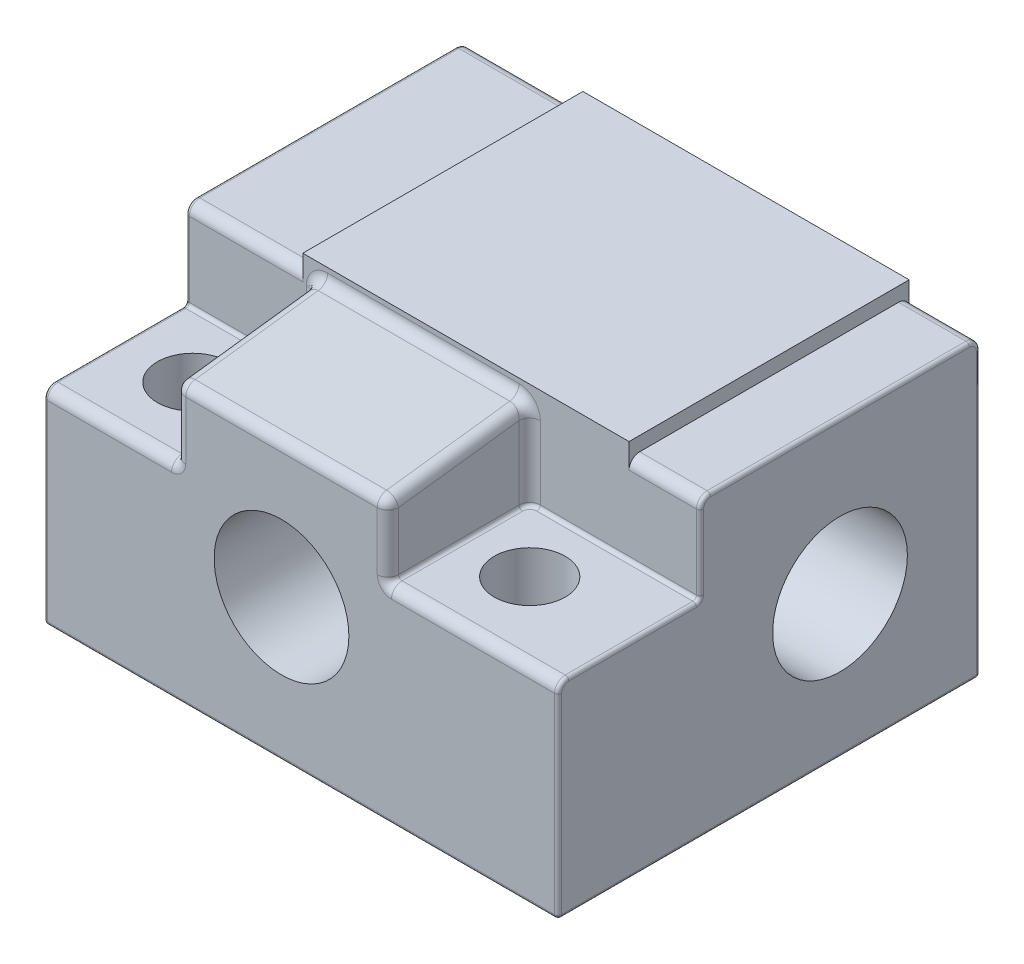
ISO-10303-21;
HEADER;
FILE_DESCRIPTION(('STEP AP214'),'2;1');
FILE_NAME('part.step','',(''),(''),'','','');
FILE_SCHEMA(('AUTOMOTIVE_DESIGN { 1 0 10303 214 1 1 1 1 }'));
ENDSEC;
DATA;
#1=APPLICATION_CONTEXT('core data for automotive mechanical design processes');
#2=APPLICATION_PROTOCOL_DEFINITION('international standard','automotive_design',2000,#1);
#3=PRODUCT_CONTEXT('',#1,'mechanical');
#4=PRODUCT('Part','Part','',(#3));
#5=PRODUCT_RELATED_PRODUCT_CATEGORY('part','',(#4));
#6=PRODUCT_DEFINITION_FORMATION('','',#4);
#7=PRODUCT_DEFINITION_CONTEXT('part definition',#1,'design');
#8=PRODUCT_DEFINITION('design','',#6,#7);
#9=PRODUCT_DEFINITION_SHAPE('','',#8);
#10=(LENGTH_UNIT() NAMED_UNIT(*) SI_UNIT(.MILLI.,.METRE.));
#11=(NAMED_UNIT(*) PLANE_ANGLE_UNIT() SI_UNIT($,.RADIAN.));
#12=(NAMED_UNIT(*) SI_UNIT($,.STERADIAN.) SOLID_ANGLE_UNIT());
#13=UNCERTAINTY_MEASURE_WITH_UNIT(LENGTH_MEASURE(1.E-05),#10,'distance_accuracy_value','');
#14=(GEOMETRIC_REPRESENTATION_CONTEXT(3) GLOBAL_UNCERTAINTY_ASSIGNED_CONTEXT((#13)) GLOBAL_UNIT_ASSIGNED_CONTEXT((#10,
#11,#12)) REPRESENTATION_CONTEXT('',''));
#15=CARTESIAN_POINT('',(0.,0.,0.));
#16=DIRECTION('',(0.,0.,1.));
#17=DIRECTION('',(1.,0.,0.));
#18=AXIS2_PLACEMENT_3D('',#15,#16,#17);
#19=CARTESIAN_POINT('',(18.415,10.541,0.));
#20=DIRECTION('',(-1.,0.,0.));
#21=DIRECTION('',(0.,0.,1.));
#22=AXIS2_PLACEMENT_3D('',#19,#20,#21);
#23=PLANE('',#22);
#24=CARTESIAN_POINT('',(18.415,5.08,-10.0965));
#25=DIRECTION('',(1.,0.,0.));
#26=DIRECTION('',(0.,0.,-1.));
#27=AXIS2_PLACEMENT_3D('',#24,#25,#26);
#28=CIRCLE('',#27,2.413);
#29=CARTESIAN_POINT('',(18.415,5.08,-12.5095));
#30=VERTEX_POINT('',#29);
#31=EDGE_CURVE('E762',#30,#30,#28,.T.);
#32=ORIENTED_EDGE('',*,*,#31,.F.);
#33=EDGE_LOOP('',(#32));
#34=FACE_BOUND('',#33,.T.);
#35=CARTESIAN_POINT('',(18.415,7.493,-4.953));
#36=DIRECTION('',(-1.,0.,0.));
#37=DIRECTION('',(0.,0.,1.));
#38=AXIS2_PLACEMENT_3D('',#35,#36,#37);
#39=CIRCLE('',#38,0.254);
#40=CARTESIAN_POINT('',(18.415,7.239,-4.953));
#41=VERTEX_POINT('',#40);
#42=CARTESIAN_POINT('',(18.415,7.493,-5.207));
#43=VERTEX_POINT('',#42);
#44=EDGE_CURVE('E389',#41,#43,#39,.F.);
#45=ORIENTED_EDGE('',*,*,#44,.F.);
#46=DIRECTION('',(0.,0.,-1.));
#47=VECTOR('',#46,1.);
#48=CARTESIAN_POINT('',(18.415,7.239,0.));
#49=LINE('',#48,#47);
#50=CARTESIAN_POINT('',(18.415,7.239,-0.381));
#51=VERTEX_POINT('',#50);
#52=EDGE_CURVE('E387',#41,#51,#49,.F.);
#53=ORIENTED_EDGE('',*,*,#52,.T.);
#54=CARTESIAN_POINT('',(18.415,6.985,-0.381));
#55=DIRECTION('',(-1.,0.,0.));
#56=DIRECTION('',(0.,0.,1.));
#57=AXIS2_PLACEMENT_3D('',#54,#55,#56);
#58=CIRCLE('',#57,0.254);
#59=CARTESIAN_POINT('',(18.415,6.985,-0.127));
#60=VERTEX_POINT('',#59);
#61=EDGE_CURVE('E384',#60,#51,#58,.T.);
#62=ORIENTED_EDGE('',*,*,#61,.F.);
#63=DIRECTION('',(0.,-1.,0.));
#64=VECTOR('',#63,1.);
#65=CARTESIAN_POINT('',(18.415,10.541,-0.127));
#66=LINE('',#65,#64);
#67=CARTESIAN_POINT('',(18.415,0.127,-0.127));
#68=VERTEX_POINT('',#67);
#69=EDGE_CURVE('E382',#60,#68,#66,.T.);
#70=ORIENTED_EDGE('',*,*,#69,.T.);
#71=DIRECTION('',(0.,0.,-1.));
#72=VECTOR('',#71,1.);
#73=CARTESIAN_POINT('',(18.415,0.127,-15.113));
#74=LINE('',#73,#72);
#75=CARTESIAN_POINT('',(18.415,0.127,-14.986));
#76=VERTEX_POINT('',#75);
#77=EDGE_CURVE('E377',#68,#76,#74,.T.);
#78=ORIENTED_EDGE('',*,*,#77,.T.);
#79=DIRECTION('',(0.,-1.,0.));
#80=VECTOR('',#79,1.);
#81=CARTESIAN_POINT('',(18.415,10.541,-14.986));
#82=LINE('',#81,#80);
#83=CARTESIAN_POINT('',(18.415,10.16,-14.986));
#84=VERTEX_POINT('',#83);
#85=EDGE_CURVE('E375',#76,#84,#82,.F.);
#86=ORIENTED_EDGE('',*,*,#85,.T.);
#87=CARTESIAN_POINT('',(18.415,10.16,-14.732));
#88=DIRECTION('',(-1.,0.,0.));
#89=DIRECTION('',(0.,0.,1.));
#90=AXIS2_PLACEMENT_3D('',#87,#88,#89);
#91=CIRCLE('',#90,0.254);
#92=CARTESIAN_POINT('',(18.415,10.414,-14.732));
#93=VERTEX_POINT('',#92);
#94=EDGE_CURVE('E372',#93,#84,#91,.T.);
#95=ORIENTED_EDGE('',*,*,#94,.F.);
#96=DIRECTION('',(0.,0.,-1.));
#97=VECTOR('',#96,1.);
#98=CARTESIAN_POINT('',(18.415,10.414,0.));
#99=LINE('',#98,#97);
#100=CARTESIAN_POINT('',(18.415,10.414,-5.461));
#101=VERTEX_POINT('',#100);
#102=EDGE_CURVE('E370',#93,#101,#99,.F.);
#103=ORIENTED_EDGE('',*,*,#102,.T.);
#104=CARTESIAN_POINT('',(18.415,10.16,-5.461));
#105=DIRECTION('',(-1.,0.,0.));
#106=DIRECTION('',(0.,0.,1.));
#107=AXIS2_PLACEMENT_3D('',#104,#105,#106);
#108=CIRCLE('',#107,0.254);
#109=CARTESIAN_POINT('',(18.415,10.16,-5.207));
#110=VERTEX_POINT('',#109);
#111=EDGE_CURVE('E367',#110,#101,#108,.T.);
#112=ORIENTED_EDGE('',*,*,#111,.F.);
#113=DIRECTION('',(0.,1.,0.));
#114=VECTOR('',#113,1.);
#115=CARTESIAN_POINT('',(18.415,10.541,-5.207));
#116=LINE('',#115,#114);
#117=EDGE_CURVE('E379',#110,#43,#116,.F.);
#118=ORIENTED_EDGE('',*,*,#117,.T.);
#119=EDGE_LOOP('',(#45,#53,#62,#70,#78,#86,#95,#103,#112,#118));
#120=FACE_BOUND('',#119,.T.);
#121=ADVANCED_FACE('F28',(#34,#120),#23,.F.);
#122=CARTESIAN_POINT('',(0.,10.541,0.));
#123=DIRECTION('',(0.,0.,-1.));
#124=DIRECTION('',(-1.,0.,0.));
#125=AXIS2_PLACEMENT_3D('',#122,#123,#124);
#126=PLANE('',#125);
#127=DIRECTION('',(1.,0.,0.));
#128=VECTOR('',#127,1.);
#129=CARTESIAN_POINT('',(0.,6.985,0.));
#130=LINE('',#129,#128);
#131=CARTESIAN_POINT('',(4.572,6.985,0.));
#132=VERTEX_POINT('',#131);
#133=CARTESIAN_POINT('',(0.127,6.985,0.));
#134=VERTEX_POINT('',#133);
#135=EDGE_CURVE('E479',#132,#134,#130,.F.);
#136=ORIENTED_EDGE('',*,*,#135,.T.);
#137=DIRECTION('',(0.,-1.,0.));
#138=VECTOR('',#137,1.);
#139=CARTESIAN_POINT('',(0.127,10.541,0.));
#140=LINE('',#139,#138);
#141=CARTESIAN_POINT('',(0.127,0.127,0.));
#142=VERTEX_POINT('',#141);
#143=EDGE_CURVE('E481',#134,#142,#140,.T.);
#144=ORIENTED_EDGE('',*,*,#143,.T.);
#145=DIRECTION('',(1.,0.,0.));
#146=VECTOR('',#145,1.);
#147=CARTESIAN_POINT('',(18.415,0.127,0.));
#148=LINE('',#147,#146);
#149=CARTESIAN_POINT('',(18.288,0.127,0.));
#150=VERTEX_POINT('',#149);
#151=EDGE_CURVE('E473',#142,#150,#148,.T.);
#152=ORIENTED_EDGE('',*,*,#151,.T.);
#153=DIRECTION('',(0.,-1.,0.));
#154=VECTOR('',#153,1.);
#155=CARTESIAN_POINT('',(18.288,10.541,0.));
#156=LINE('',#155,#154);
#157=CARTESIAN_POINT('',(18.288,6.985,0.));
#158=VERTEX_POINT('',#157);
#159=EDGE_CURVE('E471',#150,#158,#156,.F.);
#160=ORIENTED_EDGE('',*,*,#159,.T.);
#161=DIRECTION('',(1.,0.,0.));
#162=VECTOR('',#161,1.);
#163=CARTESIAN_POINT('',(12.319,6.985,0.));
#164=LINE('',#163,#162);
#165=CARTESIAN_POINT('',(12.446,6.985,0.));
#166=VERTEX_POINT('',#165);
#167=EDGE_CURVE('E469',#158,#166,#164,.F.);
#168=ORIENTED_EDGE('',*,*,#167,.T.);
#169=CARTESIAN_POINT('',(12.446,7.493,0.));
#170=DIRECTION('',(0.,0.,-1.));
#171=DIRECTION('',(-1.,0.,0.));
#172=AXIS2_PLACEMENT_3D('',#169,#170,#171);
#173=CIRCLE('',#172,0.508);
#174=CARTESIAN_POINT('',(11.938,7.493,0.));
#175=VERTEX_POINT('',#174);
#176=EDGE_CURVE('E466',#175,#166,#173,.F.);
#177=ORIENTED_EDGE('',*,*,#176,.F.);
#178=DIRECTION('',(0.,1.,0.));
#179=VECTOR('',#178,1.);
#180=CARTESIAN_POINT('',(11.938,10.541,0.));
#181=LINE('',#180,#179);
#182=CARTESIAN_POINT('',(11.938,9.56965997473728,0.));
#183=VERTEX_POINT('',#182);
#184=EDGE_CURVE('E464',#175,#183,#181,.T.);
#185=ORIENTED_EDGE('',*,*,#184,.T.);
#186=DIRECTION('',(-1.,0.,0.));
#187=VECTOR('',#186,1.);
#188=CARTESIAN_POINT('',(4.699,9.56965997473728,0.));
#189=LINE('',#188,#187);
#190=CARTESIAN_POINT('',(5.08,9.56965997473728,0.));
#191=VERTEX_POINT('',#190);
#192=EDGE_CURVE('E460',#183,#191,#189,.T.);
#193=ORIENTED_EDGE('',*,*,#192,.T.);
#194=DIRECTION('',(0.,1.,0.));
#195=VECTOR('',#194,1.);
#196=CARTESIAN_POINT('',(5.08,10.541,0.));
#197=LINE('',#196,#195);
#198=CARTESIAN_POINT('',(5.08,7.493,0.));
#199=VERTEX_POINT('',#198);
#200=EDGE_CURVE('E462',#191,#199,#197,.F.);
#201=ORIENTED_EDGE('',*,*,#200,.T.);
#202=CARTESIAN_POINT('',(4.572,7.493,0.));
#203=DIRECTION('',(0.,0.,-1.));
#204=DIRECTION('',(-1.,0.,0.));
#205=AXIS2_PLACEMENT_3D('',#202,#203,#204);
#206=CIRCLE('',#205,0.508);
#207=EDGE_CURVE('E476',#132,#199,#206,.F.);
#208=ORIENTED_EDGE('',*,*,#207,.F.);
#209=EDGE_LOOP('',(#136,#144,#152,#160,#168,#177,#185,#193,#201,#208));
#210=FACE_BOUND('',#209,.T.);
#211=CARTESIAN_POINT('',(8.509,5.08,0.));
#212=DIRECTION('',(0.,0.,1.));
#213=DIRECTION('',(1.,0.,0.));
#214=AXIS2_PLACEMENT_3D('',#211,#212,#213);
#215=CIRCLE('',#214,2.413);
#216=CARTESIAN_POINT('',(10.922,5.08,0.));
#217=VERTEX_POINT('',#216);
#218=EDGE_CURVE('E768',#217,#217,#215,.T.);
#219=ORIENTED_EDGE('',*,*,#218,.F.);
#220=EDGE_LOOP('',(#219));
#221=FACE_BOUND('',#220,.T.);
#222=ADVANCED_FACE('F781',(#210,#221),#126,.F.);
#223=CARTESIAN_POINT('',(12.319,7.366,0.));
#224=DIRECTION('',(-1.,0.,0.));
#225=DIRECTION('',(0.,0.,1.));
#226=AXIS2_PLACEMENT_3D('',#223,#224,#225);
#227=PLANE('',#226);
#228=DIRECTION('',(0.,1.,0.));
#229=VECTOR('',#228,1.);
#230=CARTESIAN_POINT('',(12.319,7.366,-0.381));
#231=LINE('',#230,#229);
#232=CARTESIAN_POINT('',(12.319,9.56965997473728,-0.381));
#233=VERTEX_POINT('',#232);
#234=CARTESIAN_POINT('',(12.319,7.493,-0.381));
#235=VERTEX_POINT('',#234);
#236=EDGE_CURVE('E554',#233,#235,#231,.F.);
#237=ORIENTED_EDGE('',*,*,#236,.T.);
#238=DIRECTION('',(0.,0.,1.));
#239=VECTOR('',#238,1.);
#240=CARTESIAN_POINT('',(12.319,7.493,0.));
#241=LINE('',#240,#239);
#242=CARTESIAN_POINT('',(12.319,7.493,-4.699));
#243=VERTEX_POINT('',#242);
#244=EDGE_CURVE('E549',#235,#243,#241,.F.);
#245=ORIENTED_EDGE('',*,*,#244,.T.);
#246=DIRECTION('',(0.,1.,0.));
#247=VECTOR('',#246,1.);
#248=CARTESIAN_POINT('',(12.319,10.541,-4.699));
#249=LINE('',#248,#247);
#250=CARTESIAN_POINT('',(12.319,10.1094099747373,-4.699));
#251=VERTEX_POINT('',#250);
#252=EDGE_CURVE('E552',#243,#251,#249,.T.);
#253=ORIENTED_EDGE('',*,*,#252,.T.);
#254=DIRECTION('',(0.,0.124034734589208,-0.992277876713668));
#255=VECTOR('',#254,1.);
#256=CARTESIAN_POINT('',(12.319,9.52794212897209,-0.0472572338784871));
#257=LINE('',#256,#255);
#258=EDGE_CURVE('E556',#251,#233,#257,.F.);
#259=ORIENTED_EDGE('',*,*,#258,.T.);
#260=EDGE_LOOP('',(#237,#245,#253,#259));
#261=FACE_BOUND('',#260,.T.);
#262=ADVANCED_FACE('F670',(#261),#227,.F.);
#263=CARTESIAN_POINT('',(4.699,7.366,0.));
#264=DIRECTION('',(1.,0.,0.));
#265=DIRECTION('',(0.,0.,-1.));
#266=AXIS2_PLACEMENT_3D('',#263,#264,#265);
#267=PLANE('',#266);
#268=DIRECTION('',(0.,1.,0.));
#269=VECTOR('',#268,1.);
#270=CARTESIAN_POINT('',(4.699,7.366,-4.699));
#271=LINE('',#270,#269);
#272=CARTESIAN_POINT('',(4.699,10.1094099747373,-4.699));
#273=VERTEX_POINT('',#272);
#274=CARTESIAN_POINT('',(4.699,7.493,-4.699));
#275=VERTEX_POINT('',#274);
#276=EDGE_CURVE('E543',#273,#275,#271,.F.);
#277=ORIENTED_EDGE('',*,*,#276,.T.);
#278=DIRECTION('',(0.,0.,-1.));
#279=VECTOR('',#278,1.);
#280=CARTESIAN_POINT('',(4.699,7.493,0.));
#281=LINE('',#280,#279);
#282=CARTESIAN_POINT('',(4.699,7.493,-0.381));
#283=VERTEX_POINT('',#282);
#284=EDGE_CURVE('E538',#275,#283,#281,.F.);
#285=ORIENTED_EDGE('',*,*,#284,.T.);
#286=DIRECTION('',(0.,1.,0.));
#287=VECTOR('',#286,1.);
#288=CARTESIAN_POINT('',(4.699,7.366,-0.381));
#289=LINE('',#288,#287);
#290=CARTESIAN_POINT('',(4.699,9.56965997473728,-0.381));
#291=VERTEX_POINT('',#290);
#292=EDGE_CURVE('E547',#283,#291,#289,.T.);
#293=ORIENTED_EDGE('',*,*,#292,.T.);
#294=DIRECTION('',(0.,-0.124034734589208,0.992277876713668));
#295=VECTOR('',#294,1.);
#296=CARTESIAN_POINT('',(4.699,10.1629421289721,-5.12725723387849));
#297=LINE('',#296,#295);
#298=EDGE_CURVE('E545',#291,#273,#297,.F.);
#299=ORIENTED_EDGE('',*,*,#298,.T.);
#300=EDGE_LOOP('',(#277,#285,#293,#299));
#301=FACE_BOUND('',#300,.T.);
#302=ADVANCED_FACE('F788',(#301),#267,.F.);
#303=CARTESIAN_POINT('',(0.,10.541,-15.113));
#304=DIRECTION('',(0.,-1.,0.));
#305=DIRECTION('',(0.,0.,-1.));
#306=AXIS2_PLACEMENT_3D('',#303,#304,#305);
#307=PLANE('',#306);
#308=DIRECTION('',(0.,0.,1.));
#309=VECTOR('',#308,1.);
#310=CARTESIAN_POINT('',(4.191,10.541,-15.113));
#311=LINE('',#310,#309);
#312=CARTESIAN_POINT('',(4.191,10.541,-14.732));
#313=VERTEX_POINT('',#312);
#314=CARTESIAN_POINT('',(4.191,10.541,-5.461));
#315=VERTEX_POINT('',#314);
#316=EDGE_CURVE('E487',#313,#315,#311,.T.);
#317=ORIENTED_EDGE('',*,*,#316,.F.);
#318=DIRECTION('',(-1.,0.,0.));
#319=VECTOR('',#318,1.);
#320=CARTESIAN_POINT('',(0.,10.541,-14.732));
#321=LINE('',#320,#319);
#322=CARTESIAN_POINT('',(0.127,10.541,-14.732));
#323=VERTEX_POINT('',#322);
#324=EDGE_CURVE('E519',#313,#323,#321,.T.);
#325=ORIENTED_EDGE('',*,*,#324,.T.);
#326=DIRECTION('',(0.,0.,1.));
#327=VECTOR('',#326,1.);
#328=CARTESIAN_POINT('',(0.127,10.541,-15.113));
#329=LINE('',#328,#327);
#330=CARTESIAN_POINT('',(0.127,10.541,-5.461));
#331=VERTEX_POINT('',#330);
#332=EDGE_CURVE('E534',#323,#331,#329,.T.);
#333=ORIENTED_EDGE('',*,*,#332,.T.);
#334=DIRECTION('',(-1.,0.,0.));
#335=VECTOR('',#334,1.);
#336=CARTESIAN_POINT('',(0.,10.541,-5.461));
#337=LINE('',#336,#335);
#338=EDGE_CURVE('E536',#331,#315,#337,.F.);
#339=ORIENTED_EDGE('',*,*,#338,.T.);
#340=EDGE_LOOP('',(#317,#325,#333,#339));
#341=FACE_BOUND('',#340,.T.);
#342=ADVANCED_FACE('F794',(#341),#307,.F.);
#343=DIRECTION('',(0.,0.,-1.));
#344=VECTOR('',#343,1.);
#345=CARTESIAN_POINT('',(18.288,10.541,-15.113));
#346=LINE('',#345,#344);
#347=CARTESIAN_POINT('',(18.288,10.541,-5.461));
#348=VERTEX_POINT('',#347);
#349=CARTESIAN_POINT('',(18.288,10.541,-14.732));
#350=VERTEX_POINT('',#349);
#351=EDGE_CURVE('E559',#348,#350,#346,.T.);
#352=ORIENTED_EDGE('',*,*,#351,.T.);
#353=DIRECTION('',(-1.,0.,0.));
#354=VECTOR('',#353,1.);
#355=CARTESIAN_POINT('',(0.,10.541,-14.732));
#356=LINE('',#355,#354);
#357=CARTESIAN_POINT('',(15.875,10.541,-14.732));
#358=VERTEX_POINT('',#357);
#359=EDGE_CURVE('E558',#350,#358,#356,.T.);
#360=ORIENTED_EDGE('',*,*,#359,.T.);
#361=DIRECTION('',(0.,0.,-1.));
#362=VECTOR('',#361,1.);
#363=CARTESIAN_POINT('',(15.875,10.541,-15.113));
#364=LINE('',#363,#362);
#365=CARTESIAN_POINT('',(15.875,10.541,-5.461));
#366=VERTEX_POINT('',#365);
#367=EDGE_CURVE('E322',#366,#358,#364,.T.);
#368=ORIENTED_EDGE('',*,*,#367,.F.);
#369=DIRECTION('',(-1.,0.,0.));
#370=VECTOR('',#369,1.);
#371=CARTESIAN_POINT('',(0.,10.541,-5.46100000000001));
#372=LINE('',#371,#370);
#373=EDGE_CURVE('E483',#366,#348,#372,.F.);
#374=ORIENTED_EDGE('',*,*,#373,.T.);
#375=EDGE_LOOP('',(#352,#360,#368,#374));
#376=FACE_BOUND('',#375,.T.);
#377=ADVANCED_FACE('F565',(#376),#307,.F.);
#378=CARTESIAN_POINT('',(0.,10.541,0.));
#379=DIRECTION('',(1.,0.,0.));
#380=DIRECTION('',(0.,0.,-1.));
#381=AXIS2_PLACEMENT_3D('',#378,#379,#380);
#382=PLANE('',#381);
#383=CARTESIAN_POINT('',(0.,6.985,-0.381));
#384=DIRECTION('',(1.,0.,0.));
#385=DIRECTION('',(0.,0.,-1.));
#386=AXIS2_PLACEMENT_3D('',#383,#384,#385);
#387=CIRCLE('',#386,0.254);
#388=CARTESIAN_POINT('',(0.,7.239,-0.381));
#389=VERTEX_POINT('',#388);
#390=CARTESIAN_POINT('',(0.,6.985,-0.127));
#391=VERTEX_POINT('',#390);
#392=EDGE_CURVE('E408',#389,#391,#387,.T.);
#393=ORIENTED_EDGE('',*,*,#392,.F.);
#394=DIRECTION('',(0.,0.,1.));
#395=VECTOR('',#394,1.);
#396=CARTESIAN_POINT('',(0.,7.239,0.));
#397=LINE('',#396,#395);
#398=CARTESIAN_POINT('',(0.,7.239,-4.953));
#399=VERTEX_POINT('',#398);
#400=EDGE_CURVE('E414',#389,#399,#397,.F.);
#401=ORIENTED_EDGE('',*,*,#400,.T.);
#402=CARTESIAN_POINT('',(0.,7.493,-4.953));
#403=DIRECTION('',(1.,0.,0.));
#404=DIRECTION('',(0.,0.,-1.));
#405=AXIS2_PLACEMENT_3D('',#402,#403,#404);
#406=CIRCLE('',#405,0.254);
#407=CARTESIAN_POINT('',(0.,7.493,-5.20700000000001));
#408=VERTEX_POINT('',#407);
#409=EDGE_CURVE('E411',#408,#399,#406,.F.);
#410=ORIENTED_EDGE('',*,*,#409,.F.);
#411=DIRECTION('',(0.,1.,0.));
#412=VECTOR('',#411,1.);
#413=CARTESIAN_POINT('',(0.,10.541,-5.20700000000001));
#414=LINE('',#413,#412);
#415=CARTESIAN_POINT('',(0.,10.16,-5.20700000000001));
#416=VERTEX_POINT('',#415);
#417=EDGE_CURVE('E405',#408,#416,#414,.T.);
#418=ORIENTED_EDGE('',*,*,#417,.T.);
#419=CARTESIAN_POINT('',(0.,10.16,-5.461));
#420=DIRECTION('',(1.,0.,0.));
#421=DIRECTION('',(0.,0.,-1.));
#422=AXIS2_PLACEMENT_3D('',#419,#420,#421);
#423=CIRCLE('',#422,0.254);
#424=CARTESIAN_POINT('',(0.,10.414,-5.461));
#425=VERTEX_POINT('',#424);
#426=EDGE_CURVE('E403',#425,#416,#423,.T.);
#427=ORIENTED_EDGE('',*,*,#426,.F.);
#428=DIRECTION('',(0.,0.,1.));
#429=VECTOR('',#428,1.);
#430=CARTESIAN_POINT('',(0.,10.414,0.));
#431=LINE('',#430,#429);
#432=CARTESIAN_POINT('',(0.,10.414,-14.732));
#433=VERTEX_POINT('',#432);
#434=EDGE_CURVE('E395',#425,#433,#431,.F.);
#435=ORIENTED_EDGE('',*,*,#434,.T.);
#436=CARTESIAN_POINT('',(0.,10.16,-14.732));
#437=DIRECTION('',(1.,0.,0.));
#438=DIRECTION('',(0.,0.,-1.));
#439=AXIS2_PLACEMENT_3D('',#436,#437,#438);
#440=CIRCLE('',#439,0.254);
#441=CARTESIAN_POINT('',(0.,10.16,-14.986));
#442=VERTEX_POINT('',#441);
#443=EDGE_CURVE('E392',#442,#433,#440,.T.);
#444=ORIENTED_EDGE('',*,*,#443,.F.);
#445=DIRECTION('',(0.,-1.,0.));
#446=VECTOR('',#445,1.);
#447=CARTESIAN_POINT('',(0.,10.541,-14.986));
#448=LINE('',#447,#446);
#449=CARTESIAN_POINT('',(0.,0.127,-14.986));
#450=VERTEX_POINT('',#449);
#451=EDGE_CURVE('E397',#442,#450,#448,.T.);
#452=ORIENTED_EDGE('',*,*,#451,.T.);
#453=DIRECTION('',(0.,0.,1.));
#454=VECTOR('',#453,1.);
#455=CARTESIAN_POINT('',(0.,0.127,0.));
#456=LINE('',#455,#454);
#457=CARTESIAN_POINT('',(0.,0.127,-0.127));
#458=VERTEX_POINT('',#457);
#459=EDGE_CURVE('E399',#450,#458,#456,.T.);
#460=ORIENTED_EDGE('',*,*,#459,.T.);
#461=DIRECTION('',(0.,-1.,0.));
#462=VECTOR('',#461,1.);
#463=CARTESIAN_POINT('',(0.,10.541,-0.127));
#464=LINE('',#463,#462);
#465=EDGE_CURVE('E401',#458,#391,#464,.F.);
#466=ORIENTED_EDGE('',*,*,#465,.T.);
#467=EDGE_LOOP('',(#393,#401,#410,#418,#427,#435,#444,#452,#460,#466));
#468=FACE_BOUND('',#467,.T.);
#469=CARTESIAN_POINT('',(0.,5.08,-10.0965));
#470=DIRECTION('',(1.,0.,0.));
#471=DIRECTION('',(0.,0.,-1.));
#472=AXIS2_PLACEMENT_3D('',#469,#470,#471);
#473=CIRCLE('',#472,2.413);
#474=CARTESIAN_POINT('',(0.,5.08,-12.5095));
#475=VERTEX_POINT('',#474);
#476=EDGE_CURVE('E765',#475,#475,#473,.T.);
#477=ORIENTED_EDGE('',*,*,#476,.T.);
#478=EDGE_LOOP('',(#477));
#479=FACE_BOUND('',#478,.T.);
#480=ADVANCED_FACE('F30',(#468,#479),#382,.F.);
#481=CARTESIAN_POINT('',(0.,10.541,-15.113));
#482=DIRECTION('',(0.,0.,1.));
#483=DIRECTION('',(1.,0.,0.));
#484=AXIS2_PLACEMENT_3D('',#481,#482,#483);
#485=PLANE('',#484);
#486=DIRECTION('',(0.,-1.,0.));
#487=VECTOR('',#486,1.);
#488=CARTESIAN_POINT('',(15.875,11.049,-15.113));
#489=LINE('',#488,#487);
#490=CARTESIAN_POINT('',(15.875,11.049,-15.113));
#491=VERTEX_POINT('',#490);
#492=CARTESIAN_POINT('',(15.875,10.16,-15.113));
#493=VERTEX_POINT('',#492);
#494=EDGE_CURVE('E333',#491,#493,#489,.T.);
#495=ORIENTED_EDGE('',*,*,#494,.T.);
#496=DIRECTION('',(-1.,0.,0.));
#497=VECTOR('',#496,1.);
#498=CARTESIAN_POINT('',(0.,10.16,-15.113));
#499=LINE('',#498,#497);
#500=CARTESIAN_POINT('',(18.288,10.16,-15.113));
#501=VERTEX_POINT('',#500);
#502=EDGE_CURVE('E449',#493,#501,#499,.F.);
#503=ORIENTED_EDGE('',*,*,#502,.T.);
#504=DIRECTION('',(0.,-1.,0.));
#505=VECTOR('',#504,1.);
#506=CARTESIAN_POINT('',(18.288,10.541,-15.113));
#507=LINE('',#506,#505);
#508=CARTESIAN_POINT('',(18.288,0.127,-15.113));
#509=VERTEX_POINT('',#508);
#510=EDGE_CURVE('E447',#501,#509,#507,.T.);
#511=ORIENTED_EDGE('',*,*,#510,.T.);
#512=DIRECTION('',(-1.,0.,0.));
#513=VECTOR('',#512,1.);
#514=CARTESIAN_POINT('',(0.,0.127,-15.113));
#515=LINE('',#514,#513);
#516=CARTESIAN_POINT('',(0.127,0.127,-15.113));
#517=VERTEX_POINT('',#516);
#518=EDGE_CURVE('E445',#509,#517,#515,.T.);
#519=ORIENTED_EDGE('',*,*,#518,.T.);
#520=DIRECTION('',(0.,-1.,0.));
#521=VECTOR('',#520,1.);
#522=CARTESIAN_POINT('',(0.127,10.541,-15.113));
#523=LINE('',#522,#521);
#524=CARTESIAN_POINT('',(0.127,10.16,-15.113));
#525=VERTEX_POINT('',#524);
#526=EDGE_CURVE('E443',#517,#525,#523,.F.);
#527=ORIENTED_EDGE('',*,*,#526,.T.);
#528=DIRECTION('',(-1.,0.,0.));
#529=VECTOR('',#528,1.);
#530=CARTESIAN_POINT('',(0.,10.16,-15.113));
#531=LINE('',#530,#529);
#532=CARTESIAN_POINT('',(4.191,10.16,-15.113));
#533=VERTEX_POINT('',#532);
#534=EDGE_CURVE('E440',#525,#533,#531,.F.);
#535=ORIENTED_EDGE('',*,*,#534,.T.);
#536=DIRECTION('',(0.,-1.,0.));
#537=VECTOR('',#536,1.);
#538=CARTESIAN_POINT('',(4.191,11.049,-15.113));
#539=LINE('',#538,#537);
#540=CARTESIAN_POINT('',(4.191,11.049,-15.113));
#541=VERTEX_POINT('',#540);
#542=EDGE_CURVE('E495',#541,#533,#539,.T.);
#543=ORIENTED_EDGE('',*,*,#542,.F.);
#544=DIRECTION('',(-1.,0.,0.));
#545=VECTOR('',#544,1.);
#546=CARTESIAN_POINT('',(4.191,11.049,-15.113));
#547=LINE('',#546,#545);
#548=EDGE_CURVE('E319',#491,#541,#547,.T.);
#549=ORIENTED_EDGE('',*,*,#548,.F.);
#550=EDGE_LOOP('',(#495,#503,#511,#519,#527,#535,#543,#549));
#551=FACE_BOUND('',#550,.T.);
#552=ADVANCED_FACE('F512',(#551),#485,.F.);
#553=CARTESIAN_POINT('',(0.,0.,-15.113));
#554=DIRECTION('',(0.,-1.,0.));
#555=DIRECTION('',(0.,0.,-1.));
#556=AXIS2_PLACEMENT_3D('',#553,#554,#555);
#557=PLANE('',#556);
#558=DIRECTION('',(0.,0.,1.));
#559=VECTOR('',#558,1.);
#560=CARTESIAN_POINT('',(0.127,0.,-15.113));
#561=LINE('',#560,#559);
#562=CARTESIAN_POINT('',(0.127,0.,-0.127));
#563=VERTEX_POINT('',#562);
#564=CARTESIAN_POINT('',(0.127,0.,-14.986));
#565=VERTEX_POINT('',#564);
#566=EDGE_CURVE('E451',#563,#565,#561,.F.);
#567=ORIENTED_EDGE('',*,*,#566,.T.);
#568=DIRECTION('',(-1.,0.,0.));
#569=VECTOR('',#568,1.);
#570=CARTESIAN_POINT('',(18.415,0.,-14.986));
#571=LINE('',#570,#569);
#572=CARTESIAN_POINT('',(18.288,0.,-14.986));
#573=VERTEX_POINT('',#572);
#574=EDGE_CURVE('E457',#565,#573,#571,.F.);
#575=ORIENTED_EDGE('',*,*,#574,.T.);
#576=DIRECTION('',(0.,0.,-1.));
#577=VECTOR('',#576,1.);
#578=CARTESIAN_POINT('',(18.288,0.,0.));
#579=LINE('',#578,#577);
#580=CARTESIAN_POINT('',(18.288,0.,-0.127));
#581=VERTEX_POINT('',#580);
#582=EDGE_CURVE('E455',#573,#581,#579,.F.);
#583=ORIENTED_EDGE('',*,*,#582,.T.);
#584=DIRECTION('',(1.,0.,0.));
#585=VECTOR('',#584,1.);
#586=CARTESIAN_POINT('',(0.,0.,-0.127));
#587=LINE('',#586,#585);
#588=EDGE_CURVE('E453',#581,#563,#587,.F.);
#589=ORIENTED_EDGE('',*,*,#588,.T.);
#590=EDGE_LOOP('',(#567,#575,#583,#589));
#591=FACE_BOUND('',#590,.T.);
#592=CARTESIAN_POINT('',(14.605,0.,-2.794));
#593=DIRECTION('',(0.,1.,0.));
#594=DIRECTION('',(0.,0.,1.));
#595=AXIS2_PLACEMENT_3D('',#592,#593,#594);
#596=CIRCLE('',#595,1.27);
#597=CARTESIAN_POINT('',(14.605,0.,-1.524));
#598=VERTEX_POINT('',#597);
#599=EDGE_CURVE('E331',#598,#598,#596,.T.);
#600=ORIENTED_EDGE('',*,*,#599,.T.);
#601=EDGE_LOOP('',(#600));
#602=FACE_BOUND('',#601,.T.);
#603=CARTESIAN_POINT('',(2.54,0.,-2.794));
#604=DIRECTION('',(0.,1.,0.));
#605=DIRECTION('',(0.,0.,1.));
#606=AXIS2_PLACEMENT_3D('',#603,#604,#605);
#607=CIRCLE('',#606,1.27);
#608=CARTESIAN_POINT('',(2.54,0.,-1.524));
#609=VERTEX_POINT('',#608);
#610=EDGE_CURVE('E345',#609,#609,#607,.T.);
#611=ORIENTED_EDGE('',*,*,#610,.T.);
#612=EDGE_LOOP('',(#611));
#613=FACE_BOUND('',#612,.T.);
#614=ADVANCED_FACE('F669',(#591,#602,#613),#557,.T.);
#615=CARTESIAN_POINT('',(18.415,7.366,-5.08));
#616=DIRECTION('',(0.,0.,-1.));
#617=DIRECTION('',(-1.,0.,0.));
#618=AXIS2_PLACEMENT_3D('',#615,#616,#617);
#619=PLANE('',#618);
#620=DIRECTION('',(-1.,0.,0.));
#621=VECTOR('',#620,1.);
#622=CARTESIAN_POINT('',(18.415,10.16,-5.08));
#623=LINE('',#622,#621);
#624=CARTESIAN_POINT('',(18.288,10.16,-5.08));
#625=VERTEX_POINT('',#624);
#626=CARTESIAN_POINT('',(15.875,10.16,-5.08));
#627=VERTEX_POINT('',#626);
#628=EDGE_CURVE('E365',#625,#627,#623,.T.);
#629=ORIENTED_EDGE('',*,*,#628,.T.);
#630=DIRECTION('',(0.,-1.,0.));
#631=VECTOR('',#630,1.);
#632=CARTESIAN_POINT('',(15.875,11.049,-5.08));
#633=LINE('',#632,#631);
#634=CARTESIAN_POINT('',(15.875,11.049,-5.08));
#635=VERTEX_POINT('',#634);
#636=EDGE_CURVE('E310',#635,#627,#633,.T.);
#637=ORIENTED_EDGE('',*,*,#636,.F.);
#638=DIRECTION('',(1.,0.,0.));
#639=VECTOR('',#638,1.);
#640=CARTESIAN_POINT('',(4.191,11.049,-5.08));
#641=LINE('',#640,#639);
#642=CARTESIAN_POINT('',(4.191,11.049,-5.08));
#643=VERTEX_POINT('',#642);
#644=EDGE_CURVE('E304',#643,#635,#641,.T.);
#645=ORIENTED_EDGE('',*,*,#644,.F.);
#646=DIRECTION('',(0.,-1.,0.));
#647=VECTOR('',#646,1.);
#648=CARTESIAN_POINT('',(4.191,11.049,-5.08));
#649=LINE('',#648,#647);
#650=CARTESIAN_POINT('',(4.191,10.16,-5.08));
#651=VERTEX_POINT('',#650);
#652=EDGE_CURVE('E309',#643,#651,#649,.T.);
#653=ORIENTED_EDGE('',*,*,#652,.T.);
#654=DIRECTION('',(-1.,0.,0.));
#655=VECTOR('',#654,1.);
#656=CARTESIAN_POINT('',(18.415,10.16,-5.08));
#657=LINE('',#656,#655);
#658=CARTESIAN_POINT('',(0.127,10.16,-5.08));
#659=VERTEX_POINT('',#658);
#660=EDGE_CURVE('E353',#651,#659,#657,.T.);
#661=ORIENTED_EDGE('',*,*,#660,.T.);
#662=DIRECTION('',(0.,1.,0.));
#663=VECTOR('',#662,1.);
#664=CARTESIAN_POINT('',(0.126999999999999,7.366,-5.08));
#665=LINE('',#664,#663);
#666=CARTESIAN_POINT('',(0.127,7.493,-5.08));
#667=VERTEX_POINT('',#666);
#668=EDGE_CURVE('E351',#659,#667,#665,.F.);
#669=ORIENTED_EDGE('',*,*,#668,.T.);
#670=DIRECTION('',(-1.,0.,0.));
#671=VECTOR('',#670,1.);
#672=CARTESIAN_POINT('',(4.699,7.493,-5.08));
#673=LINE('',#672,#671);
#674=CARTESIAN_POINT('',(4.318,7.493,-5.08));
#675=VERTEX_POINT('',#674);
#676=EDGE_CURVE('E349',#667,#675,#673,.F.);
#677=ORIENTED_EDGE('',*,*,#676,.T.);
#678=DIRECTION('',(0.,1.,0.));
#679=VECTOR('',#678,1.);
#680=CARTESIAN_POINT('',(4.318,10.541,-5.08));
#681=LINE('',#680,#679);
#682=CARTESIAN_POINT('',(4.318,10.1094099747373,-5.08));
#683=VERTEX_POINT('',#682);
#684=EDGE_CURVE('E344',#675,#683,#681,.T.);
#685=ORIENTED_EDGE('',*,*,#684,.T.);
#686=CARTESIAN_POINT('',(5.08,10.1094099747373,-5.08));
#687=DIRECTION('',(0.,0.,-1.));
#688=DIRECTION('',(0.,1.,0.));
#689=AXIS2_PLACEMENT_3D('',#686,#687,#688);
#690=ELLIPSE('',#689,0.767930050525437,0.762);
#691=CARTESIAN_POINT('',(5.08,10.8773400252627,-5.08));
#692=VERTEX_POINT('',#691);
#693=EDGE_CURVE('E341',#692,#683,#690,.F.);
#694=ORIENTED_EDGE('',*,*,#693,.F.);
#695=DIRECTION('',(1.,0.,0.));
#696=VECTOR('',#695,1.);
#697=CARTESIAN_POINT('',(18.415,10.8773400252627,-5.08));
#698=LINE('',#697,#696);
#699=CARTESIAN_POINT('',(11.938,10.8773400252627,-5.08));
#700=VERTEX_POINT('',#699);
#701=EDGE_CURVE('E347',#692,#700,#698,.T.);
#702=ORIENTED_EDGE('',*,*,#701,.T.);
#703=CARTESIAN_POINT('',(11.938,10.1094099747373,-5.08));
#704=DIRECTION('',(0.,0.,-1.));
#705=DIRECTION('',(0.,-1.,0.));
#706=AXIS2_PLACEMENT_3D('',#703,#704,#705);
#707=ELLIPSE('',#706,0.767930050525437,0.762);
#708=CARTESIAN_POINT('',(12.7,10.1094099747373,-5.08));
#709=VERTEX_POINT('',#708);
#710=EDGE_CURVE('E355',#709,#700,#707,.F.);
#711=ORIENTED_EDGE('',*,*,#710,.F.);
#712=DIRECTION('',(0.,1.,0.));
#713=VECTOR('',#712,1.);
#714=CARTESIAN_POINT('',(12.7,7.366,-5.08));
#715=LINE('',#714,#713);
#716=CARTESIAN_POINT('',(12.7,7.493,-5.08));
#717=VERTEX_POINT('',#716);
#718=EDGE_CURVE('E358',#709,#717,#715,.F.);
#719=ORIENTED_EDGE('',*,*,#718,.T.);
#720=DIRECTION('',(-1.,0.,0.));
#721=VECTOR('',#720,1.);
#722=CARTESIAN_POINT('',(18.415,7.493,-5.08));
#723=LINE('',#722,#721);
#724=CARTESIAN_POINT('',(18.288,7.493,-5.08));
#725=VERTEX_POINT('',#724);
#726=EDGE_CURVE('E360',#717,#725,#723,.F.);
#727=ORIENTED_EDGE('',*,*,#726,.T.);
#728=DIRECTION('',(0.,1.,0.));
#729=VECTOR('',#728,1.);
#730=CARTESIAN_POINT('',(18.288,7.366,-5.08));
#731=LINE('',#730,#729);
#732=EDGE_CURVE('E362',#725,#625,#731,.T.);
#733=ORIENTED_EDGE('',*,*,#732,.T.);
#734=EDGE_LOOP('',(#629,#637,#645,#653,#661,#669,#677,#685,#694,#702,#711,#719,#727,#733));
#735=FACE_BOUND('',#734,.T.);
#736=ADVANCED_FACE('F307',(#735),#619,.F.);
#737=CARTESIAN_POINT('',(18.415,7.366,0.));
#738=DIRECTION('',(0.,1.,0.));
#739=DIRECTION('',(0.,0.,1.));
#740=AXIS2_PLACEMENT_3D('',#737,#738,#739);
#741=PLANE('',#740);
#742=DIRECTION('',(1.,0.,0.));
#743=VECTOR('',#742,1.);
#744=CARTESIAN_POINT('',(18.415,7.366,-0.381));
#745=LINE('',#744,#743);
#746=CARTESIAN_POINT('',(12.446,7.366,-0.381));
#747=VERTEX_POINT('',#746);
#748=CARTESIAN_POINT('',(18.288,7.366,-0.381));
#749=VERTEX_POINT('',#748);
#750=EDGE_CURVE('E416',#747,#749,#745,.T.);
#751=ORIENTED_EDGE('',*,*,#750,.T.);
#752=DIRECTION('',(0.,0.,-1.));
#753=VECTOR('',#752,1.);
#754=CARTESIAN_POINT('',(18.288,7.366,-5.08));
#755=LINE('',#754,#753);
#756=CARTESIAN_POINT('',(18.288,7.366,-4.953));
#757=VERTEX_POINT('',#756);
#758=EDGE_CURVE('E425',#749,#757,#755,.T.);
#759=ORIENTED_EDGE('',*,*,#758,.T.);
#760=DIRECTION('',(-1.,0.,0.));
#761=VECTOR('',#760,1.);
#762=CARTESIAN_POINT('',(18.415,7.366,-4.953));
#763=LINE('',#762,#761);
#764=CARTESIAN_POINT('',(12.7,7.366,-4.953));
#765=VERTEX_POINT('',#764);
#766=EDGE_CURVE('E423',#757,#765,#763,.T.);
#767=ORIENTED_EDGE('',*,*,#766,.T.);
#768=CARTESIAN_POINT('',(12.7,7.366,-4.699));
#769=DIRECTION('',(0.,1.,0.));
#770=DIRECTION('',(0.,0.,1.));
#771=AXIS2_PLACEMENT_3D('',#768,#769,#770);
#772=CIRCLE('',#771,0.254);
#773=CARTESIAN_POINT('',(12.446,7.366,-4.699));
#774=VERTEX_POINT('',#773);
#775=EDGE_CURVE('E420',#774,#765,#772,.F.);
#776=ORIENTED_EDGE('',*,*,#775,.F.);
#777=DIRECTION('',(0.,0.,1.));
#778=VECTOR('',#777,1.);
#779=CARTESIAN_POINT('',(12.446,7.366,0.));
#780=LINE('',#779,#778);
#781=EDGE_CURVE('E418',#774,#747,#780,.T.);
#782=ORIENTED_EDGE('',*,*,#781,.T.);
#783=EDGE_LOOP('',(#751,#759,#767,#776,#782));
#784=FACE_BOUND('',#783,.T.);
#785=CARTESIAN_POINT('',(14.605,7.366,-2.794));
#786=DIRECTION('',(0.,1.,0.));
#787=DIRECTION('',(0.,0.,1.));
#788=AXIS2_PLACEMENT_3D('',#785,#786,#787);
#789=CIRCLE('',#788,1.27);
#790=CARTESIAN_POINT('',(14.605,7.366,-1.524));
#791=VERTEX_POINT('',#790);
#792=EDGE_CURVE('E328',#791,#791,#789,.T.);
#793=ORIENTED_EDGE('',*,*,#792,.F.);
#794=EDGE_LOOP('',(#793));
#795=FACE_BOUND('',#794,.T.);
#796=ADVANCED_FACE('F668',(#784,#795),#741,.T.);
#797=CARTESIAN_POINT('',(0.,7.366,0.));
#798=DIRECTION('',(0.,-1.,0.));
#799=DIRECTION('',(0.,0.,-1.));
#800=AXIS2_PLACEMENT_3D('',#797,#798,#799);
#801=PLANE('',#800);
#802=CARTESIAN_POINT('',(4.318,7.366,-4.699));
#803=DIRECTION('',(0.,-1.,0.));
#804=DIRECTION('',(0.,0.,-1.));
#805=AXIS2_PLACEMENT_3D('',#802,#803,#804);
#806=CIRCLE('',#805,0.254);
#807=CARTESIAN_POINT('',(4.318,7.366,-4.953));
#808=VERTEX_POINT('',#807);
#809=CARTESIAN_POINT('',(4.572,7.366,-4.699));
#810=VERTEX_POINT('',#809);
#811=EDGE_CURVE('E435',#808,#810,#806,.T.);
#812=ORIENTED_EDGE('',*,*,#811,.F.);
#813=DIRECTION('',(-1.,0.,0.));
#814=VECTOR('',#813,1.);
#815=CARTESIAN_POINT('',(0.,7.366,-4.953));
#816=LINE('',#815,#814);
#817=CARTESIAN_POINT('',(0.127,7.366,-4.953));
#818=VERTEX_POINT('',#817);
#819=EDGE_CURVE('E438',#808,#818,#816,.T.);
#820=ORIENTED_EDGE('',*,*,#819,.T.);
#821=DIRECTION('',(0.,0.,1.));
#822=VECTOR('',#821,1.);
#823=CARTESIAN_POINT('',(0.127,7.366,0.));
#824=LINE('',#823,#822);
#825=CARTESIAN_POINT('',(0.127,7.366,-0.381));
#826=VERTEX_POINT('',#825);
#827=EDGE_CURVE('E432',#818,#826,#824,.T.);
#828=ORIENTED_EDGE('',*,*,#827,.T.);
#829=DIRECTION('',(1.,0.,0.));
#830=VECTOR('',#829,1.);
#831=CARTESIAN_POINT('',(0.,7.366,-0.381));
#832=LINE('',#831,#830);
#833=CARTESIAN_POINT('',(4.572,7.366,-0.381));
#834=VERTEX_POINT('',#833);
#835=EDGE_CURVE('E428',#826,#834,#832,.T.);
#836=ORIENTED_EDGE('',*,*,#835,.T.);
#837=DIRECTION('',(0.,0.,-1.));
#838=VECTOR('',#837,1.);
#839=CARTESIAN_POINT('',(4.572,7.366,-5.08));
#840=LINE('',#839,#838);
#841=EDGE_CURVE('E430',#834,#810,#840,.T.);
#842=ORIENTED_EDGE('',*,*,#841,.T.);
#843=EDGE_LOOP('',(#812,#820,#828,#836,#842));
#844=FACE_BOUND('',#843,.T.);
#845=CARTESIAN_POINT('',(2.54,7.366,-2.794));
#846=DIRECTION('',(0.,1.,0.));
#847=DIRECTION('',(0.,0.,1.));
#848=AXIS2_PLACEMENT_3D('',#845,#846,#847);
#849=CIRCLE('',#848,1.27);
#850=CARTESIAN_POINT('',(2.54,7.366,-1.524));
#851=VERTEX_POINT('',#850);
#852=EDGE_CURVE('E499',#851,#851,#849,.T.);
#853=ORIENTED_EDGE('',*,*,#852,.F.);
#854=EDGE_LOOP('',(#853));
#855=FACE_BOUND('',#854,.T.);
#856=ADVANCED_FACE('F952',(#844,#855),#801,.F.);
#857=CARTESIAN_POINT('',(2.54,0.,-2.794));
#858=DIRECTION('',(0.,1.,0.));
#859=DIRECTION('',(0.,0.,1.));
#860=AXIS2_PLACEMENT_3D('',#857,#858,#859);
#861=CYLINDRICAL_SURFACE('',#860,1.27);
#862=CARTESIAN_POINT('',(2.54,0.,-1.524));
#863=CARTESIAN_POINT('',(2.54,0.0767291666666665,-1.524));
#864=CARTESIAN_POINT('',(2.54,0.153458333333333,-1.524));
#865=CARTESIAN_POINT('',(2.54,0.306916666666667,-1.524));
#866=CARTESIAN_POINT('',(2.54,0.383645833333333,-1.524));
#867=CARTESIAN_POINT('',(2.54,0.537104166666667,-1.524));
#868=CARTESIAN_POINT('',(2.54,0.613833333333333,-1.524));
#869=CARTESIAN_POINT('',(2.54,0.767291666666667,-1.524));
#870=CARTESIAN_POINT('',(2.54,0.844020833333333,-1.524));
#871=CARTESIAN_POINT('',(2.54,0.997479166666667,-1.524));
#872=CARTESIAN_POINT('',(2.54,1.07420833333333,-1.524));
#873=CARTESIAN_POINT('',(2.54,1.22766666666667,-1.524));
#874=CARTESIAN_POINT('',(2.54,1.30439583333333,-1.524));
#875=CARTESIAN_POINT('',(2.54,1.45785416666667,-1.524));
#876=CARTESIAN_POINT('',(2.54,1.53458333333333,-1.524));
#877=CARTESIAN_POINT('',(2.54,1.68804166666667,-1.524));
#878=CARTESIAN_POINT('',(2.54,1.76477083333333,-1.524));
#879=CARTESIAN_POINT('',(2.54,1.91822916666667,-1.524));
#880=CARTESIAN_POINT('',(2.54,1.99495833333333,-1.524));
#881=CARTESIAN_POINT('',(2.54,2.14841666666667,-1.524));
#882=CARTESIAN_POINT('',(2.54,2.22514583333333,-1.524));
#883=CARTESIAN_POINT('',(2.54,2.37860416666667,-1.524));
#884=CARTESIAN_POINT('',(2.54,2.45533333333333,-1.524));
#885=CARTESIAN_POINT('',(2.54,2.60879166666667,-1.524));
#886=CARTESIAN_POINT('',(2.54,2.68552083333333,-1.524));
#887=CARTESIAN_POINT('',(2.54,2.83897916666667,-1.524));
#888=CARTESIAN_POINT('',(2.54,2.91570833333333,-1.524));
#889=CARTESIAN_POINT('',(2.54,3.06916666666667,-1.524));
#890=CARTESIAN_POINT('',(2.54,3.14589583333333,-1.524));
#891=CARTESIAN_POINT('',(2.54,3.29935416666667,-1.524));
#892=CARTESIAN_POINT('',(2.54,3.37608333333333,-1.524));
#893=CARTESIAN_POINT('',(2.54,3.52954166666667,-1.524));
#894=CARTESIAN_POINT('',(2.54,3.60627083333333,-1.524));
#895=CARTESIAN_POINT('',(2.54,3.75972916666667,-1.524));
#896=CARTESIAN_POINT('',(2.54,3.83645833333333,-1.524));
#897=CARTESIAN_POINT('',(2.54,3.98991666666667,-1.524));
#898=CARTESIAN_POINT('',(2.54,4.06664583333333,-1.524));
#899=CARTESIAN_POINT('',(2.54,4.22010416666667,-1.524));
#900=CARTESIAN_POINT('',(2.54,4.29683333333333,-1.524));
#901=CARTESIAN_POINT('',(2.54,4.45029166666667,-1.524));
#902=CARTESIAN_POINT('',(2.54,4.52702083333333,-1.524));
#903=CARTESIAN_POINT('',(2.54,4.68047916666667,-1.524));
#904=CARTESIAN_POINT('',(2.54,4.75720833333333,-1.524));
#905=CARTESIAN_POINT('',(2.54,4.91066666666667,-1.524));
#906=CARTESIAN_POINT('',(2.54,4.98739583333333,-1.524));
#907=CARTESIAN_POINT('',(2.54,5.14085416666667,-1.524));
#908=CARTESIAN_POINT('',(2.54,5.21758333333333,-1.524));
#909=CARTESIAN_POINT('',(2.54,5.37104166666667,-1.524));
#910=CARTESIAN_POINT('',(2.54,5.44777083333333,-1.524));
#911=CARTESIAN_POINT('',(2.54,5.60122916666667,-1.524));
#912=CARTESIAN_POINT('',(2.54,5.67795833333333,-1.524));
#913=CARTESIAN_POINT('',(2.54,5.83141666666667,-1.524));
#914=CARTESIAN_POINT('',(2.54,5.90814583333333,-1.524));
#915=CARTESIAN_POINT('',(2.54,6.06160416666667,-1.524));
#916=CARTESIAN_POINT('',(2.54,6.13833333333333,-1.524));
#917=CARTESIAN_POINT('',(2.54,6.29179166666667,-1.524));
#918=CARTESIAN_POINT('',(2.54,6.36852083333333,-1.524));
#919=CARTESIAN_POINT('',(2.54,6.52197916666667,-1.524));
#920=CARTESIAN_POINT('',(2.54,6.59870833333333,-1.524));
#921=CARTESIAN_POINT('',(2.54,6.75216666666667,-1.524));
#922=CARTESIAN_POINT('',(2.54,6.82889583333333,-1.524));
#923=CARTESIAN_POINT('',(2.54,6.98235416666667,-1.524));
#924=CARTESIAN_POINT('',(2.54,7.05908333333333,-1.524));
#925=CARTESIAN_POINT('',(2.54,7.21254166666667,-1.524));
#926=CARTESIAN_POINT('',(2.54,7.28927083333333,-1.524));
#927=CARTESIAN_POINT('',(2.54,7.366,-1.524));
#928=B_SPLINE_CURVE_WITH_KNOTS('',3,(#862,#863,#864,#865,#866,#867,#868,#869,#870,#871,#872,
#873,#874,#875,#876,#877,#878,#879,#880,#881,#882,#883,#884,#885,#886,#887,#888,#889,#890,#891,
#892,#893,#894,#895,#896,#897,#898,#899,#900,#901,#902,#903,#904,#905,#906,#907,#908,#909,#910,
#911,#912,#913,#914,#915,#916,#917,#918,#919,#920,#921,#922,#923,#924,#925,#926,#927),
.UNSPECIFIED.,.F.,.F.,(4,2,2,2,2,2,2,2,2,2,2,2,2,2,2,2,2,2,2,2,2,2,2,2,2,2,2,2,2,2,2,2,4),(0.,
0.2301875,0.460375,0.6905625,0.92075,1.1509375,1.381125,1.6113125,1.8415,2.0716875,2.301875,
2.5320625,2.76225,2.9924375,3.222625,3.4528125,3.683,3.9131875,4.143375,4.3735625,4.60375,
4.8339375,5.064125,5.2943125,5.5245,5.7546875,5.984875,6.2150625,6.44525,6.6754375,6.905625,
7.1358125,7.366),.UNSPECIFIED.);
#929=EDGE_CURVE('BSEAM1258',#609,#851,#928,.T.);
#930=ORIENTED_EDGE('',*,*,#610,.F.);
#931=ORIENTED_EDGE('',*,*,#852,.T.);
#932=ORIENTED_EDGE('',*,*,#929,.T.);
#933=ORIENTED_EDGE('',*,*,#929,.F.);
#934=EDGE_LOOP('',(#930,#932,#931,#933));
#935=FACE_BOUND('',#934,.T.);
#936=ADVANCED_FACE('F1258',(#935),#861,.F.);
#937=CARTESIAN_POINT('',(14.605,0.,-2.794));
#938=DIRECTION('',(0.,1.,0.));
#939=DIRECTION('',(0.,0.,1.));
#940=AXIS2_PLACEMENT_3D('',#937,#938,#939);
#941=CYLINDRICAL_SURFACE('',#940,1.27);
#942=CARTESIAN_POINT('',(14.605,0.,-1.524));
#943=CARTESIAN_POINT('',(14.605,0.0767291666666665,-1.524));
#944=CARTESIAN_POINT('',(14.605,0.153458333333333,-1.524));
#945=CARTESIAN_POINT('',(14.605,0.306916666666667,-1.524));
#946=CARTESIAN_POINT('',(14.605,0.383645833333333,-1.524));
#947=CARTESIAN_POINT('',(14.605,0.537104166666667,-1.524));
#948=CARTESIAN_POINT('',(14.605,0.613833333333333,-1.524));
#949=CARTESIAN_POINT('',(14.605,0.767291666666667,-1.524));
#950=CARTESIAN_POINT('',(14.605,0.844020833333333,-1.524));
#951=CARTESIAN_POINT('',(14.605,0.997479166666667,-1.524));
#952=CARTESIAN_POINT('',(14.605,1.07420833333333,-1.524));
#953=CARTESIAN_POINT('',(14.605,1.22766666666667,-1.524));
#954=CARTESIAN_POINT('',(14.605,1.30439583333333,-1.524));
#955=CARTESIAN_POINT('',(14.605,1.45785416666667,-1.524));
#956=CARTESIAN_POINT('',(14.605,1.53458333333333,-1.524));
#957=CARTESIAN_POINT('',(14.605,1.68804166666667,-1.524));
#958=CARTESIAN_POINT('',(14.605,1.76477083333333,-1.524));
#959=CARTESIAN_POINT('',(14.605,1.91822916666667,-1.524));
#960=CARTESIAN_POINT('',(14.605,1.99495833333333,-1.524));
#961=CARTESIAN_POINT('',(14.605,2.14841666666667,-1.524));
#962=CARTESIAN_POINT('',(14.605,2.22514583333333,-1.524));
#963=CARTESIAN_POINT('',(14.605,2.37860416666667,-1.524));
#964=CARTESIAN_POINT('',(14.605,2.45533333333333,-1.524));
#965=CARTESIAN_POINT('',(14.605,2.60879166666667,-1.524));
#966=CARTESIAN_POINT('',(14.605,2.68552083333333,-1.524));
#967=CARTESIAN_POINT('',(14.605,2.83897916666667,-1.524));
#968=CARTESIAN_POINT('',(14.605,2.91570833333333,-1.524));
#969=CARTESIAN_POINT('',(14.605,3.06916666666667,-1.524));
#970=CARTESIAN_POINT('',(14.605,3.14589583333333,-1.524));
#971=CARTESIAN_POINT('',(14.605,3.29935416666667,-1.524));
#972=CARTESIAN_POINT('',(14.605,3.37608333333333,-1.524));
#973=CARTESIAN_POINT('',(14.605,3.52954166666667,-1.524));
#974=CARTESIAN_POINT('',(14.605,3.60627083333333,-1.524));
#975=CARTESIAN_POINT('',(14.605,3.75972916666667,-1.524));
#976=CARTESIAN_POINT('',(14.605,3.83645833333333,-1.524));
#977=CARTESIAN_POINT('',(14.605,3.98991666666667,-1.524));
#978=CARTESIAN_POINT('',(14.605,4.06664583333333,-1.524));
#979=CARTESIAN_POINT('',(14.605,4.22010416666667,-1.524));
#980=CARTESIAN_POINT('',(14.605,4.29683333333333,-1.524));
#981=CARTESIAN_POINT('',(14.605,4.45029166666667,-1.524));
#982=CARTESIAN_POINT('',(14.605,4.52702083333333,-1.524));
#983=CARTESIAN_POINT('',(14.605,4.68047916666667,-1.524));
#984=CARTESIAN_POINT('',(14.605,4.75720833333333,-1.524));
#985=CARTESIAN_POINT('',(14.605,4.91066666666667,-1.524));
#986=CARTESIAN_POINT('',(14.605,4.98739583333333,-1.524));
#987=CARTESIAN_POINT('',(14.605,5.14085416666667,-1.524));
#988=CARTESIAN_POINT('',(14.605,5.21758333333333,-1.524));
#989=CARTESIAN_POINT('',(14.605,5.37104166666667,-1.524));
#990=CARTESIAN_POINT('',(14.605,5.44777083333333,-1.524));
#991=CARTESIAN_POINT('',(14.605,5.60122916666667,-1.524));
#992=CARTESIAN_POINT('',(14.605,5.67795833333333,-1.524));
#993=CARTESIAN_POINT('',(14.605,5.83141666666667,-1.524));
#994=CARTESIAN_POINT('',(14.605,5.90814583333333,-1.524));
#995=CARTESIAN_POINT('',(14.605,6.06160416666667,-1.524));
#996=CARTESIAN_POINT('',(14.605,6.13833333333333,-1.524));
#997=CARTESIAN_POINT('',(14.605,6.29179166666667,-1.524));
#998=CARTESIAN_POINT('',(14.605,6.36852083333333,-1.524));
#999=CARTESIAN_POINT('',(14.605,6.52197916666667,-1.524));
#1000=CARTESIAN_POINT('',(14.605,6.59870833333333,-1.524));
#1001=CARTESIAN_POINT('',(14.605,6.75216666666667,-1.524));
#1002=CARTESIAN_POINT('',(14.605,6.82889583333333,-1.524));
#1003=CARTESIAN_POINT('',(14.605,6.98235416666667,-1.524));
#1004=CARTESIAN_POINT('',(14.605,7.05908333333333,-1.524));
#1005=CARTESIAN_POINT('',(14.605,7.21254166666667,-1.524));
#1006=CARTESIAN_POINT('',(14.605,7.28927083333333,-1.524));
#1007=CARTESIAN_POINT('',(14.605,7.366,-1.524));
#1008=B_SPLINE_CURVE_WITH_KNOTS('',3,(#942,#943,#944,#945,#946,#947,#948,#949,#950,#951,#952,
#953,#954,#955,#956,#957,#958,#959,#960,#961,#962,#963,#964,#965,#966,#967,#968,#969,#970,#971,
#972,#973,#974,#975,#976,#977,#978,#979,#980,#981,#982,#983,#984,#985,#986,#987,#988,#989,#990,
#991,#992,#993,#994,#995,#996,#997,#998,#999,#1000,#1001,#1002,#1003,#1004,#1005,#1006,#1007),
.UNSPECIFIED.,.F.,.F.,(4,2,2,2,2,2,2,2,2,2,2,2,2,2,2,2,2,2,2,2,2,2,2,2,2,2,2,2,2,2,2,2,4),(0.,
0.2301875,0.460375,0.6905625,0.92075,1.1509375,1.381125,1.6113125,1.8415,2.0716875,2.301875,
2.5320625,2.76225,2.9924375,3.222625,3.4528125,3.683,3.9131875,4.143375,4.3735625,4.60375,
4.8339375,5.064125,5.2943125,5.5245,5.7546875,5.984875,6.2150625,6.44525,6.6754375,6.905625,
7.1358125,7.366),.UNSPECIFIED.);
#1009=EDGE_CURVE('BSEAM1250',#598,#791,#1008,.T.);
#1010=ORIENTED_EDGE('',*,*,#599,.F.);
#1011=ORIENTED_EDGE('',*,*,#792,.T.);
#1012=ORIENTED_EDGE('',*,*,#1009,.T.);
#1013=ORIENTED_EDGE('',*,*,#1009,.F.);
#1014=EDGE_LOOP('',(#1010,#1012,#1011,#1013));
#1015=FACE_BOUND('',#1014,.T.);
#1016=ADVANCED_FACE('F1250',(#1015),#941,.F.);
#1017=CARTESIAN_POINT('',(4.191,11.049,-15.113));
#1018=DIRECTION('',(1.,0.,0.));
#1019=DIRECTION('',(0.,0.,-1.));
#1020=AXIS2_PLACEMENT_3D('',#1017,#1018,#1019);
#1021=PLANE('',#1020);
#1022=ORIENTED_EDGE('',*,*,#542,.T.);
#1023=CARTESIAN_POINT('',(4.191,10.16,-14.732));
#1024=DIRECTION('',(1.,0.,0.));
#1025=DIRECTION('',(0.,0.,-1.));
#1026=AXIS2_PLACEMENT_3D('',#1023,#1024,#1025);
#1027=CIRCLE('',#1026,0.381);
#1028=EDGE_CURVE('E36',#533,#313,#1027,.T.);
#1029=ORIENTED_EDGE('',*,*,#1028,.T.);
#1030=ORIENTED_EDGE('',*,*,#316,.T.);
#1031=CARTESIAN_POINT('',(4.191,10.16,-5.461));
#1032=DIRECTION('',(1.,0.,0.));
#1033=DIRECTION('',(0.,0.,-1.));
#1034=AXIS2_PLACEMENT_3D('',#1031,#1032,#1033);
#1035=CIRCLE('',#1034,0.381);
#1036=EDGE_CURVE('E12',#315,#651,#1035,.T.);
#1037=ORIENTED_EDGE('',*,*,#1036,.T.);
#1038=ORIENTED_EDGE('',*,*,#652,.F.);
#1039=DIRECTION('',(0.,0.,1.));
#1040=VECTOR('',#1039,1.);
#1041=CARTESIAN_POINT('',(4.191,11.049,-15.113));
#1042=LINE('',#1041,#1040);
#1043=EDGE_CURVE('E314',#541,#643,#1042,.T.);
#1044=ORIENTED_EDGE('',*,*,#1043,.F.);
#1045=EDGE_LOOP('',(#1022,#1029,#1030,#1037,#1038,#1044));
#1046=FACE_BOUND('',#1045,.T.);
#1047=ADVANCED_FACE('F324',(#1046),#1021,.F.);
#1048=CARTESIAN_POINT('',(15.875,11.049,-15.113));
#1049=DIRECTION('',(-1.,0.,0.));
#1050=DIRECTION('',(0.,0.,1.));
#1051=AXIS2_PLACEMENT_3D('',#1048,#1049,#1050);
#1052=PLANE('',#1051);
#1053=ORIENTED_EDGE('',*,*,#636,.T.);
#1054=CARTESIAN_POINT('',(15.875,10.16,-5.461));
#1055=DIRECTION('',(-1.,0.,0.));
#1056=DIRECTION('',(0.,0.,1.));
#1057=AXIS2_PLACEMENT_3D('',#1054,#1055,#1056);
#1058=CIRCLE('',#1057,0.381);
#1059=EDGE_CURVE('E520',#627,#366,#1058,.T.);
#1060=ORIENTED_EDGE('',*,*,#1059,.T.);
#1061=ORIENTED_EDGE('',*,*,#367,.T.);
#1062=CARTESIAN_POINT('',(15.875,10.16,-14.732));
#1063=DIRECTION('',(-1.,0.,0.));
#1064=DIRECTION('',(0.,0.,1.));
#1065=AXIS2_PLACEMENT_3D('',#1062,#1063,#1064);
#1066=CIRCLE('',#1065,0.381);
#1067=EDGE_CURVE('E521',#358,#493,#1066,.T.);
#1068=ORIENTED_EDGE('',*,*,#1067,.T.);
#1069=ORIENTED_EDGE('',*,*,#494,.F.);
#1070=DIRECTION('',(0.,0.,-1.));
#1071=VECTOR('',#1070,1.);
#1072=CARTESIAN_POINT('',(15.875,11.049,-15.113));
#1073=LINE('',#1072,#1071);
#1074=EDGE_CURVE('E313',#635,#491,#1073,.T.);
#1075=ORIENTED_EDGE('',*,*,#1074,.F.);
#1076=EDGE_LOOP('',(#1053,#1060,#1061,#1068,#1069,#1075));
#1077=FACE_BOUND('',#1076,.T.);
#1078=ADVANCED_FACE('F873',(#1077),#1052,.F.);
#1079=CARTESIAN_POINT('',(4.191,11.049,-5.08));
#1080=DIRECTION('',(0.,1.,0.));
#1081=DIRECTION('',(0.,0.,1.));
#1082=AXIS2_PLACEMENT_3D('',#1079,#1080,#1081);
#1083=PLANE('',#1082);
#1084=ORIENTED_EDGE('',*,*,#1043,.T.);
#1085=ORIENTED_EDGE('',*,*,#644,.T.);
#1086=ORIENTED_EDGE('',*,*,#1074,.T.);
#1087=ORIENTED_EDGE('',*,*,#548,.T.);
#1088=EDGE_LOOP('',(#1084,#1085,#1086,#1087));
#1089=FACE_BOUND('',#1088,.T.);
#1090=ADVANCED_FACE('F317',(#1089),#1083,.T.);
#1091=CARTESIAN_POINT('',(8.509,5.08,-5.842));
#1092=DIRECTION('',(0.,0.,1.));
#1093=DIRECTION('',(1.,0.,0.));
#1094=AXIS2_PLACEMENT_3D('',#1091,#1092,#1093);
#1095=CYLINDRICAL_SURFACE('',#1094,2.413);
#1096=CARTESIAN_POINT('',(8.509,5.08,-5.842));
#1097=DIRECTION('',(0.,0.,1.));
#1098=DIRECTION('',(1.,0.,0.));
#1099=AXIS2_PLACEMENT_3D('',#1096,#1097,#1098);
#1100=CIRCLE('',#1099,2.413);
#1101=CARTESIAN_POINT('',(10.922,5.08,-5.842));
#1102=VERTEX_POINT('',#1101);
#1103=EDGE_CURVE('E540',#1102,#1102,#1100,.T.);
#1104=ORIENTED_EDGE('',*,*,#1103,.F.);
#1105=EDGE_LOOP('',(#1104));
#1106=FACE_BOUND('',#1105,.T.);
#1107=ORIENTED_EDGE('',*,*,#218,.T.);
#1108=EDGE_LOOP('',(#1107));
#1109=FACE_BOUND('',#1108,.T.);
#1110=ADVANCED_FACE('F775',(#1106,#1109),#1095,.F.);
#1111=CARTESIAN_POINT('',(8.509,5.08,-5.842));
#1112=DIRECTION('',(0.,0.,1.));
#1113=DIRECTION('',(1.,0.,0.));
#1114=AXIS2_PLACEMENT_3D('',#1111,#1112,#1113);
#1115=PLANE('',#1114);
#1116=ORIENTED_EDGE('',*,*,#1103,.T.);
#1117=EDGE_LOOP('',(#1116));
#1118=FACE_BOUND('',#1117,.T.);
#1119=ADVANCED_FACE('F773',(#1118),#1115,.T.);
#1120=CARTESIAN_POINT('',(-2.50000000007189E-05,5.08,-10.0965));
#1121=DIRECTION('',(1.,0.,0.));
#1122=DIRECTION('',(0.,0.,-1.));
#1123=AXIS2_PLACEMENT_3D('',#1120,#1121,#1122);
#1124=CYLINDRICAL_SURFACE('',#1123,2.413);
#1125=ORIENTED_EDGE('',*,*,#31,.T.);
#1126=EDGE_LOOP('',(#1125));
#1127=FACE_BOUND('',#1126,.T.);
#1128=ORIENTED_EDGE('',*,*,#476,.F.);
#1129=EDGE_LOOP('',(#1128));
#1130=FACE_BOUND('',#1129,.T.);
#1131=ADVANCED_FACE('F1236',(#1127,#1130),#1124,.F.);
#1132=CARTESIAN_POINT('',(18.415025,10.541,-5.08));
#1133=DIRECTION('',(0.,0.992277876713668,0.124034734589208));
#1134=DIRECTION('',(0.,-0.124034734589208,0.992277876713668));
#1135=AXIS2_PLACEMENT_3D('',#1132,#1133,#1134);
#1136=PLANE('',#1135);
#1137=DIRECTION('',(0.,0.124034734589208,-0.992277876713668));
#1138=VECTOR('',#1137,1.);
#1139=CARTESIAN_POINT('',(11.938,10.541,-5.08));
#1140=LINE('',#1139,#1138);
#1141=CARTESIAN_POINT('',(11.938,9.94771784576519,-0.333742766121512));
#1142=VERTEX_POINT('',#1141);
#1143=CARTESIAN_POINT('',(11.938,10.4992821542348,-4.74625723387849));
#1144=VERTEX_POINT('',#1143);
#1145=EDGE_CURVE('E43',#1142,#1144,#1140,.T.);
#1146=ORIENTED_EDGE('',*,*,#1145,.T.);
#1147=DIRECTION('',(1.,0.,0.));
#1148=VECTOR('',#1147,1.);
#1149=CARTESIAN_POINT('',(18.415025,10.4992821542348,-4.74625723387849));
#1150=LINE('',#1149,#1148);
#1151=CARTESIAN_POINT('',(5.08,10.4992821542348,-4.74625723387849));
#1152=VERTEX_POINT('',#1151);
#1153=EDGE_CURVE('E526',#1144,#1152,#1150,.F.);
#1154=ORIENTED_EDGE('',*,*,#1153,.T.);
#1155=DIRECTION('',(0.,-0.124034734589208,0.992277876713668));
#1156=VECTOR('',#1155,1.);
#1157=CARTESIAN_POINT('',(5.08,9.906,0.));
#1158=LINE('',#1157,#1156);
#1159=CARTESIAN_POINT('',(5.08,9.94771784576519,-0.333742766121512));
#1160=VERTEX_POINT('',#1159);
#1161=EDGE_CURVE('E529',#1152,#1160,#1158,.T.);
#1162=ORIENTED_EDGE('',*,*,#1161,.T.);
#1163=DIRECTION('',(-1.,0.,0.));
#1164=VECTOR('',#1163,1.);
#1165=CARTESIAN_POINT('',(12.319,9.94771784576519,-0.333742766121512));
#1166=LINE('',#1165,#1164);
#1167=EDGE_CURVE('E531',#1160,#1142,#1166,.F.);
#1168=ORIENTED_EDGE('',*,*,#1167,.T.);
#1169=EDGE_LOOP('',(#1146,#1154,#1162,#1168));
#1170=FACE_BOUND('',#1169,.T.);
#1171=ADVANCED_FACE('F966',(#1170),#1136,.T.);
#1172=CARTESIAN_POINT('',(18.415,10.16,-5.461));
#1173=DIRECTION('',(-1.,0.,0.));
#1174=DIRECTION('',(0.,0.,1.));
#1175=AXIS2_PLACEMENT_3D('',#1172,#1173,#1174);
#1176=CYLINDRICAL_SURFACE('',#1175,0.381);
#1177=ORIENTED_EDGE('',*,*,#1036,.F.);
#1178=ORIENTED_EDGE('',*,*,#338,.F.);
#1179=CARTESIAN_POINT('',(0.127000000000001,10.16,-5.461));
#1180=DIRECTION('',(1.,0.,0.));
#1181=DIRECTION('',(0.,0.,-1.));
#1182=AXIS2_PLACEMENT_3D('',#1179,#1180,#1181);
#1183=CIRCLE('',#1182,0.381);
#1184=EDGE_CURVE('E756',#659,#331,#1183,.F.);
#1185=ORIENTED_EDGE('',*,*,#1184,.F.);
#1186=ORIENTED_EDGE('',*,*,#660,.F.);
#1187=EDGE_LOOP('',(#1177,#1178,#1185,#1186));
#1188=FACE_BOUND('',#1187,.T.);
#1189=ADVANCED_FACE('F806',(#1188),#1176,.T.);
#1190=CARTESIAN_POINT('',(4.572,7.493,-0.381));
#1191=DIRECTION('',(0.,0.,-1.));
#1192=DIRECTION('',(-1.,0.,0.));
#1193=AXIS2_PLACEMENT_3D('',#1190,#1191,#1192);
#1194=TOROIDAL_SURFACE('',#1193,0.508,0.381);
#1195=CARTESIAN_POINT('',(4.572,7.493,-0.381));
#1196=DIRECTION('',(0.,0.,-1.));
#1197=DIRECTION('',(-1.,0.,0.));
#1198=AXIS2_PLACEMENT_3D('',#1195,#1196,#1197);
#1199=CIRCLE('',#1198,0.127);
#1200=EDGE_CURVE('E741',#834,#283,#1199,.F.);
#1201=ORIENTED_EDGE('',*,*,#1200,.F.);
#1202=CARTESIAN_POINT('',(4.572,6.985,-0.381));
#1203=DIRECTION('',(1.,0.,0.));
#1204=DIRECTION('',(0.,0.,-1.));
#1205=AXIS2_PLACEMENT_3D('',#1202,#1203,#1204);
#1206=CIRCLE('',#1205,0.381);
#1207=EDGE_CURVE('E747',#132,#834,#1206,.F.);
#1208=ORIENTED_EDGE('',*,*,#1207,.F.);
#1209=ORIENTED_EDGE('',*,*,#207,.T.);
#1210=CARTESIAN_POINT('',(5.08,7.493,-0.381));
#1211=DIRECTION('',(0.,-1.,0.));
#1212=DIRECTION('',(0.,0.,-1.));
#1213=AXIS2_PLACEMENT_3D('',#1210,#1211,#1212);
#1214=CIRCLE('',#1213,0.381);
#1215=EDGE_CURVE('E744',#283,#199,#1214,.F.);
#1216=ORIENTED_EDGE('',*,*,#1215,.F.);
#1217=EDGE_LOOP('',(#1201,#1208,#1209,#1216));
#1218=FACE_BOUND('',#1217,.T.);
#1219=ADVANCED_FACE('F1040',(#1218),#1194,.T.);
#1220=CARTESIAN_POINT('',(0.127,10.541,-5.20700000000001));
#1221=DIRECTION('',(0.,1.,0.));
#1222=DIRECTION('',(0.,0.,1.));
#1223=AXIS2_PLACEMENT_3D('',#1220,#1221,#1222);
#1224=CYLINDRICAL_SURFACE('',#1223,0.127);
#1225=CARTESIAN_POINT('',(0.127,10.16,-5.20700000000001));
#1226=DIRECTION('',(0.,1.,0.));
#1227=DIRECTION('',(0.,0.,1.));
#1228=AXIS2_PLACEMENT_3D('',#1225,#1226,#1227);
#1229=CIRCLE('',#1228,0.127);
#1230=EDGE_CURVE('E753',#416,#659,#1229,.T.);
#1231=ORIENTED_EDGE('',*,*,#1230,.F.);
#1232=ORIENTED_EDGE('',*,*,#417,.F.);
#1233=CARTESIAN_POINT('',(0.127,7.493,-5.20700000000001));
#1234=DIRECTION('',(0.,-1.,0.));
#1235=DIRECTION('',(0.,0.,-1.));
#1236=AXIS2_PLACEMENT_3D('',#1233,#1234,#1235);
#1237=CIRCLE('',#1236,0.127);
#1238=EDGE_CURVE('E759',#667,#408,#1237,.T.);
#1239=ORIENTED_EDGE('',*,*,#1238,.F.);
#1240=ORIENTED_EDGE('',*,*,#668,.F.);
#1241=EDGE_LOOP('',(#1231,#1232,#1239,#1240));
#1242=FACE_BOUND('',#1241,.T.);
#1243=ADVANCED_FACE('F812',(#1242),#1224,.T.);
#1244=CARTESIAN_POINT('',(0.127,7.493,-4.953));
#1245=DIRECTION('',(1.,0.,0.));
#1246=DIRECTION('',(0.,0.,-1.));
#1247=AXIS2_PLACEMENT_3D('',#1244,#1245,#1246);
#1248=TOROIDAL_SURFACE('',#1247,0.254,0.127);
#1249=ORIENTED_EDGE('',*,*,#1238,.T.);
#1250=ORIENTED_EDGE('',*,*,#409,.T.);
#1251=CARTESIAN_POINT('',(0.127,7.239,-4.953));
#1252=DIRECTION('',(0.,0.,-1.));
#1253=DIRECTION('',(-1.,0.,0.));
#1254=AXIS2_PLACEMENT_3D('',#1251,#1252,#1253);
#1255=CIRCLE('',#1254,0.127);
#1256=EDGE_CURVE('E750',#818,#399,#1255,.F.);
#1257=ORIENTED_EDGE('',*,*,#1256,.F.);
#1258=CARTESIAN_POINT('',(0.127,7.493,-4.953));
#1259=DIRECTION('',(1.,0.,0.));
#1260=DIRECTION('',(0.,0.,-1.));
#1261=AXIS2_PLACEMENT_3D('',#1258,#1259,#1260);
#1262=CIRCLE('',#1261,0.127);
#1263=EDGE_CURVE('E738',#667,#818,#1262,.F.);
#1264=ORIENTED_EDGE('',*,*,#1263,.F.);
#1265=EDGE_LOOP('',(#1249,#1250,#1257,#1264));
#1266=FACE_BOUND('',#1265,.T.);
#1267=ADVANCED_FACE('F818',(#1266),#1248,.T.);
#1268=CARTESIAN_POINT('',(0.127,10.16,-5.461));
#1269=DIRECTION('',(1.,0.,0.));
#1270=DIRECTION('',(0.,0.,-1.));
#1271=AXIS2_PLACEMENT_3D('',#1268,#1269,#1270);
#1272=TOROIDAL_SURFACE('',#1271,0.254,0.127);
#1273=ORIENTED_EDGE('',*,*,#1230,.T.);
#1274=ORIENTED_EDGE('',*,*,#1184,.T.);
#1275=CARTESIAN_POINT('',(0.127,10.414,-5.461));
#1276=DIRECTION('',(0.,0.,1.));
#1277=DIRECTION('',(1.,0.,0.));
#1278=AXIS2_PLACEMENT_3D('',#1275,#1276,#1277);
#1279=CIRCLE('',#1278,0.127);
#1280=EDGE_CURVE('E735',#425,#331,#1279,.F.);
#1281=ORIENTED_EDGE('',*,*,#1280,.F.);
#1282=ORIENTED_EDGE('',*,*,#426,.T.);
#1283=EDGE_LOOP('',(#1273,#1274,#1281,#1282));
#1284=FACE_BOUND('',#1283,.T.);
#1285=ADVANCED_FACE('F1197',(#1284),#1272,.T.);
#1286=CARTESIAN_POINT('',(0.127,7.239,0.));
#1287=DIRECTION('',(0.,0.,1.));
#1288=DIRECTION('',(1.,0.,0.));
#1289=AXIS2_PLACEMENT_3D('',#1286,#1287,#1288);
#1290=CYLINDRICAL_SURFACE('',#1289,0.127);
#1291=ORIENTED_EDGE('',*,*,#1256,.T.);
#1292=ORIENTED_EDGE('',*,*,#400,.F.);
#1293=CARTESIAN_POINT('',(0.127,7.239,-0.381));
#1294=DIRECTION('',(0.,0.,1.));
#1295=DIRECTION('',(1.,0.,0.));
#1296=AXIS2_PLACEMENT_3D('',#1293,#1294,#1295);
#1297=CIRCLE('',#1296,0.127);
#1298=EDGE_CURVE('E732',#826,#389,#1297,.T.);
#1299=ORIENTED_EDGE('',*,*,#1298,.F.);
#1300=ORIENTED_EDGE('',*,*,#827,.F.);
#1301=EDGE_LOOP('',(#1291,#1292,#1299,#1300));
#1302=FACE_BOUND('',#1301,.T.);
#1303=ADVANCED_FACE('F945',(#1302),#1290,.T.);
#1304=CARTESIAN_POINT('',(0.,6.985,-0.381));
#1305=DIRECTION('',(1.,0.,0.));
#1306=DIRECTION('',(0.,0.,-1.));
#1307=AXIS2_PLACEMENT_3D('',#1304,#1305,#1306);
#1308=CYLINDRICAL_SURFACE('',#1307,0.381);
#1309=ORIENTED_EDGE('',*,*,#1207,.T.);
#1310=ORIENTED_EDGE('',*,*,#835,.F.);
#1311=CARTESIAN_POINT('',(0.127,6.985,-0.381));
#1312=DIRECTION('',(1.,0.,0.));
#1313=DIRECTION('',(0.,0.,-1.));
#1314=AXIS2_PLACEMENT_3D('',#1311,#1312,#1313);
#1315=CIRCLE('',#1314,0.381);
#1316=EDGE_CURVE('E730',#134,#826,#1315,.F.);
#1317=ORIENTED_EDGE('',*,*,#1316,.F.);
#1318=ORIENTED_EDGE('',*,*,#135,.F.);
#1319=EDGE_LOOP('',(#1309,#1310,#1317,#1318));
#1320=FACE_BOUND('',#1319,.T.);
#1321=ADVANCED_FACE('F947',(#1320),#1308,.T.);
#1322=CARTESIAN_POINT('',(5.08,7.366,-0.381));
#1323=DIRECTION('',(0.,1.,0.));
#1324=DIRECTION('',(0.,0.,1.));
#1325=AXIS2_PLACEMENT_3D('',#1322,#1323,#1324);
#1326=CYLINDRICAL_SURFACE('',#1325,0.381);
#1327=ORIENTED_EDGE('',*,*,#1215,.T.);
#1328=ORIENTED_EDGE('',*,*,#200,.F.);
#1329=CARTESIAN_POINT('',(5.08,9.56965997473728,-0.381));
#1330=DIRECTION('',(0.,1.,0.));
#1331=DIRECTION('',(0.,0.,1.));
#1332=AXIS2_PLACEMENT_3D('',#1329,#1330,#1331);
#1333=CIRCLE('',#1332,0.381);
#1334=EDGE_CURVE('E727',#291,#191,#1333,.T.);
#1335=ORIENTED_EDGE('',*,*,#1334,.F.);
#1336=ORIENTED_EDGE('',*,*,#292,.F.);
#1337=EDGE_LOOP('',(#1327,#1328,#1335,#1336));
#1338=FACE_BOUND('',#1337,.T.);
#1339=ADVANCED_FACE('F1042',(#1338),#1326,.T.);
#1340=CARTESIAN_POINT('',(4.572,7.493,0.));
#1341=DIRECTION('',(0.,0.,1.));
#1342=DIRECTION('',(1.,0.,0.));
#1343=AXIS2_PLACEMENT_3D('',#1340,#1341,#1342);
#1344=CYLINDRICAL_SURFACE('',#1343,0.127);
#1345=ORIENTED_EDGE('',*,*,#1200,.T.);
#1346=ORIENTED_EDGE('',*,*,#284,.F.);
#1347=CARTESIAN_POINT('',(4.572,7.493,-4.699));
#1348=DIRECTION('',(0.,0.,1.));
#1349=DIRECTION('',(1.,0.,0.));
#1350=AXIS2_PLACEMENT_3D('',#1347,#1348,#1349);
#1351=CIRCLE('',#1350,0.127);
#1352=EDGE_CURVE('E724',#810,#275,#1351,.T.);
#1353=ORIENTED_EDGE('',*,*,#1352,.F.);
#1354=ORIENTED_EDGE('',*,*,#841,.F.);
#1355=EDGE_LOOP('',(#1345,#1346,#1353,#1354));
#1356=FACE_BOUND('',#1355,.T.);
#1357=ADVANCED_FACE('F960',(#1356),#1344,.F.);
#1358=CARTESIAN_POINT('',(0.,7.493,-4.953));
#1359=DIRECTION('',(1.,0.,0.));
#1360=DIRECTION('',(0.,0.,-1.));
#1361=AXIS2_PLACEMENT_3D('',#1358,#1359,#1360);
#1362=CYLINDRICAL_SURFACE('',#1361,0.127);
#1363=ORIENTED_EDGE('',*,*,#1263,.T.);
#1364=ORIENTED_EDGE('',*,*,#819,.F.);
#1365=CARTESIAN_POINT('',(4.318,7.493,-4.953));
#1366=DIRECTION('',(-1.,0.,0.));
#1367=DIRECTION('',(0.,0.,1.));
#1368=AXIS2_PLACEMENT_3D('',#1365,#1366,#1367);
#1369=CIRCLE('',#1368,0.127);
#1370=EDGE_CURVE('E721',#675,#808,#1369,.T.);
#1371=ORIENTED_EDGE('',*,*,#1370,.F.);
#1372=ORIENTED_EDGE('',*,*,#676,.F.);
#1373=EDGE_LOOP('',(#1363,#1364,#1371,#1372));
#1374=FACE_BOUND('',#1373,.T.);
#1375=ADVANCED_FACE('F823',(#1374),#1362,.F.);
#1376=CARTESIAN_POINT('',(0.,10.16,-14.732));
#1377=DIRECTION('',(-1.,0.,0.));
#1378=DIRECTION('',(0.,0.,1.));
#1379=AXIS2_PLACEMENT_3D('',#1376,#1377,#1378);
#1380=CYLINDRICAL_SURFACE('',#1379,0.381);
#1381=ORIENTED_EDGE('',*,*,#1028,.F.);
#1382=ORIENTED_EDGE('',*,*,#534,.F.);
#1383=CARTESIAN_POINT('',(0.127,10.16,-14.732));
#1384=DIRECTION('',(1.,0.,0.));
#1385=DIRECTION('',(0.,0.,-1.));
#1386=AXIS2_PLACEMENT_3D('',#1383,#1384,#1385);
#1387=CIRCLE('',#1386,0.381);
#1388=EDGE_CURVE('E719',#323,#525,#1387,.F.);
#1389=ORIENTED_EDGE('',*,*,#1388,.F.);
#1390=ORIENTED_EDGE('',*,*,#324,.F.);
#1391=EDGE_LOOP('',(#1381,#1382,#1389,#1390));
#1392=FACE_BOUND('',#1391,.T.);
#1393=ADVANCED_FACE('F518',(#1392),#1380,.T.);
#1394=CARTESIAN_POINT('',(0.127,10.414,-15.113));
#1395=DIRECTION('',(0.,0.,1.));
#1396=DIRECTION('',(1.,0.,0.));
#1397=AXIS2_PLACEMENT_3D('',#1394,#1395,#1396);
#1398=CYLINDRICAL_SURFACE('',#1397,0.127);
#1399=ORIENTED_EDGE('',*,*,#1280,.T.);
#1400=ORIENTED_EDGE('',*,*,#332,.F.);
#1401=CARTESIAN_POINT('',(0.127,10.414,-14.732));
#1402=DIRECTION('',(0.,0.,-1.));
#1403=DIRECTION('',(-1.,0.,0.));
#1404=AXIS2_PLACEMENT_3D('',#1401,#1402,#1403);
#1405=CIRCLE('',#1404,0.127);
#1406=EDGE_CURVE('E716',#433,#323,#1405,.T.);
#1407=ORIENTED_EDGE('',*,*,#1406,.F.);
#1408=ORIENTED_EDGE('',*,*,#434,.F.);
#1409=EDGE_LOOP('',(#1399,#1400,#1407,#1408));
#1410=FACE_BOUND('',#1409,.T.);
#1411=ADVANCED_FACE('F1153',(#1410),#1398,.T.);
#1412=CARTESIAN_POINT('',(0.127,6.985,-0.381));
#1413=DIRECTION('',(1.,0.,0.));
#1414=DIRECTION('',(0.,0.,-1.));
#1415=AXIS2_PLACEMENT_3D('',#1412,#1413,#1414);
#1416=TOROIDAL_SURFACE('',#1415,0.254,0.127);
#1417=ORIENTED_EDGE('',*,*,#1298,.T.);
#1418=ORIENTED_EDGE('',*,*,#392,.T.);
#1419=CARTESIAN_POINT('',(0.127,6.985,-0.127));
#1420=DIRECTION('',(0.,1.,0.));
#1421=DIRECTION('',(0.,0.,1.));
#1422=AXIS2_PLACEMENT_3D('',#1419,#1420,#1421);
#1423=CIRCLE('',#1422,0.127);
#1424=EDGE_CURVE('E713',#134,#391,#1423,.F.);
#1425=ORIENTED_EDGE('',*,*,#1424,.F.);
#1426=ORIENTED_EDGE('',*,*,#1316,.T.);
#1427=EDGE_LOOP('',(#1417,#1418,#1425,#1426));
#1428=FACE_BOUND('',#1427,.T.);
#1429=ADVANCED_FACE('F940',(#1428),#1416,.T.);
#1430=CARTESIAN_POINT('',(5.08,9.56965997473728,-0.381));
#1431=DIRECTION('',(0.,0.,1.));
#1432=DIRECTION('',(1.,0.,0.));
#1433=AXIS2_PLACEMENT_3D('',#1430,#1431,#1432);
#1434=SPHERICAL_SURFACE('',#1433,0.381);
#1435=CARTESIAN_POINT('',(5.08,9.56965997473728,-0.381));
#1436=DIRECTION('',(0.,-0.124034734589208,0.992277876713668));
#1437=DIRECTION('',(0.,-0.992277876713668,-0.124034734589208));
#1438=AXIS2_PLACEMENT_3D('',#1435,#1436,#1437);
#1439=CIRCLE('',#1438,0.381);
#1440=EDGE_CURVE('E707',#291,#1160,#1439,.F.);
#1441=ORIENTED_EDGE('',*,*,#1440,.F.);
#1442=ORIENTED_EDGE('',*,*,#1334,.T.);
#1443=CARTESIAN_POINT('',(5.08,9.56965997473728,-0.381));
#1444=DIRECTION('',(-1.,0.,0.));
#1445=DIRECTION('',(0.,0.,1.));
#1446=AXIS2_PLACEMENT_3D('',#1443,#1444,#1445);
#1447=CIRCLE('',#1446,0.381);
#1448=EDGE_CURVE('E710',#1160,#191,#1447,.F.);
#1449=ORIENTED_EDGE('',*,*,#1448,.F.);
#1450=EDGE_LOOP('',(#1441,#1442,#1449));
#1451=FACE_BOUND('',#1450,.T.);
#1452=ADVANCED_FACE('F1044',(#1451),#1434,.T.);
#1453=CARTESIAN_POINT('',(4.318,7.493,-4.699));
#1454=DIRECTION('',(0.,-1.,0.));
#1455=DIRECTION('',(0.,0.,-1.));
#1456=AXIS2_PLACEMENT_3D('',#1453,#1454,#1455);
#1457=TOROIDAL_SURFACE('',#1456,0.254,0.127);
#1458=ORIENTED_EDGE('',*,*,#811,.T.);
#1459=ORIENTED_EDGE('',*,*,#1352,.T.);
#1460=CARTESIAN_POINT('',(4.318,7.493,-4.699));
#1461=DIRECTION('',(0.,-1.,0.));
#1462=DIRECTION('',(0.,0.,-1.));
#1463=AXIS2_PLACEMENT_3D('',#1460,#1461,#1462);
#1464=CIRCLE('',#1463,0.381);
#1465=EDGE_CURVE('E704',#675,#275,#1464,.T.);
#1466=ORIENTED_EDGE('',*,*,#1465,.F.);
#1467=ORIENTED_EDGE('',*,*,#1370,.T.);
#1468=EDGE_LOOP('',(#1458,#1459,#1466,#1467));
#1469=FACE_BOUND('',#1468,.T.);
#1470=ADVANCED_FACE('F955',(#1469),#1457,.F.);
#1471=CARTESIAN_POINT('',(0.127,10.16,-14.732));
#1472=DIRECTION('',(1.,0.,0.));
#1473=DIRECTION('',(0.,0.,-1.));
#1474=AXIS2_PLACEMENT_3D('',#1471,#1472,#1473);
#1475=TOROIDAL_SURFACE('',#1474,0.254,0.127);
#1476=ORIENTED_EDGE('',*,*,#1406,.T.);
#1477=ORIENTED_EDGE('',*,*,#1388,.T.);
#1478=CARTESIAN_POINT('',(0.127,10.16,-14.986));
#1479=DIRECTION('',(0.,1.,0.));
#1480=DIRECTION('',(0.,0.,1.));
#1481=AXIS2_PLACEMENT_3D('',#1478,#1479,#1480);
#1482=CIRCLE('',#1481,0.127);
#1483=EDGE_CURVE('E701',#442,#525,#1482,.F.);
#1484=ORIENTED_EDGE('',*,*,#1483,.F.);
#1485=ORIENTED_EDGE('',*,*,#443,.T.);
#1486=EDGE_LOOP('',(#1476,#1477,#1484,#1485));
#1487=FACE_BOUND('',#1486,.T.);
#1488=ADVANCED_FACE('F1127',(#1487),#1475,.T.);
#1489=CARTESIAN_POINT('',(0.127,10.541,-0.127));
#1490=DIRECTION('',(0.,-1.,0.));
#1491=DIRECTION('',(0.,0.,-1.));
#1492=AXIS2_PLACEMENT_3D('',#1489,#1490,#1491);
#1493=CYLINDRICAL_SURFACE('',#1492,0.127);
#1494=ORIENTED_EDGE('',*,*,#1424,.T.);
#1495=ORIENTED_EDGE('',*,*,#465,.F.);
#1496=CARTESIAN_POINT('',(0.127,0.127,-0.127));
#1497=DIRECTION('',(0.,-1.,0.));
#1498=DIRECTION('',(0.,0.,-1.));
#1499=AXIS2_PLACEMENT_3D('',#1496,#1497,#1498);
#1500=CIRCLE('',#1499,0.127);
#1501=EDGE_CURVE('E695',#142,#458,#1500,.T.);
#1502=ORIENTED_EDGE('',*,*,#1501,.F.);
#1503=ORIENTED_EDGE('',*,*,#143,.F.);
#1504=EDGE_LOOP('',(#1494,#1495,#1502,#1503));
#1505=FACE_BOUND('',#1504,.T.);
#1506=ADVANCED_FACE('F934',(#1505),#1493,.T.);
#1507=CARTESIAN_POINT('',(0.,9.56965997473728,-0.381));
#1508=DIRECTION('',(1.,0.,0.));
#1509=DIRECTION('',(0.,0.,-1.));
#1510=AXIS2_PLACEMENT_3D('',#1507,#1508,#1509);
#1511=CYLINDRICAL_SURFACE('',#1510,0.381);
#1512=ORIENTED_EDGE('',*,*,#1448,.T.);
#1513=ORIENTED_EDGE('',*,*,#192,.F.);
#1514=CARTESIAN_POINT('',(11.938,9.56965997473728,-0.381));
#1515=DIRECTION('',(1.,0.,0.));
#1516=DIRECTION('',(0.,0.,-1.));
#1517=AXIS2_PLACEMENT_3D('',#1514,#1515,#1516);
#1518=CIRCLE('',#1517,0.381);
#1519=EDGE_CURVE('E692',#1142,#183,#1518,.T.);
#1520=ORIENTED_EDGE('',*,*,#1519,.F.);
#1521=ORIENTED_EDGE('',*,*,#1167,.F.);
#1522=EDGE_LOOP('',(#1512,#1513,#1520,#1521));
#1523=FACE_BOUND('',#1522,.T.);
#1524=ADVANCED_FACE('F1049',(#1523),#1511,.T.);
#1525=CARTESIAN_POINT('',(5.08,10.1629421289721,-5.12725723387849));
#1526=DIRECTION('',(0.,0.124034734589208,-0.992277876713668));
#1527=DIRECTION('',(0.,0.992277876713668,0.124034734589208));
#1528=AXIS2_PLACEMENT_3D('',#1525,#1526,#1527);
#1529=CYLINDRICAL_SURFACE('',#1528,0.381);
#1530=ORIENTED_EDGE('',*,*,#1440,.T.);
#1531=ORIENTED_EDGE('',*,*,#1161,.F.);
#1532=CARTESIAN_POINT('',(5.08,10.1094099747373,-4.699));
#1533=DIRECTION('',(0.,0.120331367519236,0.992733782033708));
#1534=DIRECTION('',(0.,0.992733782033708,-0.120331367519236));
#1535=AXIS2_PLACEMENT_3D('',#1532,#1533,#1534);
#1536=ELLIPSE('',#1535,0.392725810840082,0.381);
#1537=EDGE_CURVE('E690',#273,#1152,#1536,.F.);
#1538=ORIENTED_EDGE('',*,*,#1537,.F.);
#1539=ORIENTED_EDGE('',*,*,#298,.F.);
#1540=EDGE_LOOP('',(#1530,#1531,#1538,#1539));
#1541=FACE_BOUND('',#1540,.T.);
#1542=ADVANCED_FACE('F684',(#1541),#1529,.T.);
#1543=CARTESIAN_POINT('',(4.318,7.366,-4.699));
#1544=DIRECTION('',(0.,-1.,0.));
#1545=DIRECTION('',(0.,0.,-1.));
#1546=AXIS2_PLACEMENT_3D('',#1543,#1544,#1545);
#1547=CYLINDRICAL_SURFACE('',#1546,0.381);
#1548=ORIENTED_EDGE('',*,*,#1465,.T.);
#1549=ORIENTED_EDGE('',*,*,#276,.F.);
#1550=CARTESIAN_POINT('',(4.318,10.1094099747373,-4.699));
#1551=DIRECTION('',(0.,-1.,0.));
#1552=DIRECTION('',(0.,0.,-1.));
#1553=AXIS2_PLACEMENT_3D('',#1550,#1551,#1552);
#1554=CIRCLE('',#1553,0.381);
#1555=EDGE_CURVE('E830',#683,#273,#1554,.T.);
#1556=ORIENTED_EDGE('',*,*,#1555,.F.);
#1557=ORIENTED_EDGE('',*,*,#684,.F.);
#1558=EDGE_LOOP('',(#1548,#1549,#1556,#1557));
#1559=FACE_BOUND('',#1558,.T.);
#1560=ADVANCED_FACE('F831',(#1559),#1547,.F.);
#1561=CARTESIAN_POINT('',(0.127,10.541,-14.986));
#1562=DIRECTION('',(0.,-1.,0.));
#1563=DIRECTION('',(0.,0.,-1.));
#1564=AXIS2_PLACEMENT_3D('',#1561,#1562,#1563);
#1565=CYLINDRICAL_SURFACE('',#1564,0.127);
#1566=ORIENTED_EDGE('',*,*,#1483,.T.);
#1567=ORIENTED_EDGE('',*,*,#526,.F.);
#1568=CARTESIAN_POINT('',(0.127,0.127,-14.986));
#1569=DIRECTION('',(0.,-1.,0.));
#1570=DIRECTION('',(0.,0.,-1.));
#1571=AXIS2_PLACEMENT_3D('',#1568,#1569,#1570);
#1572=CIRCLE('',#1571,0.127);
#1573=EDGE_CURVE('E833',#450,#517,#1572,.T.);
#1574=ORIENTED_EDGE('',*,*,#1573,.F.);
#1575=ORIENTED_EDGE('',*,*,#451,.F.);
#1576=EDGE_LOOP('',(#1566,#1567,#1574,#1575));
#1577=FACE_BOUND('',#1576,.T.);
#1578=ADVANCED_FACE('F1096',(#1577),#1565,.T.);
#1579=CARTESIAN_POINT('',(0.127,0.127,0.));
#1580=DIRECTION('',(0.,0.,-1.));
#1581=DIRECTION('',(-1.,0.,0.));
#1582=AXIS2_PLACEMENT_3D('',#1579,#1580,#1581);
#1583=CYLINDRICAL_SURFACE('',#1582,0.127);
#1584=CARTESIAN_POINT('',(0.127,0.127,-0.127));
#1585=DIRECTION('',(0.,0.,1.));
#1586=DIRECTION('',(1.,0.,0.));
#1587=AXIS2_PLACEMENT_3D('',#1584,#1585,#1586);
#1588=CIRCLE('',#1587,0.127);
#1589=EDGE_CURVE('E698',#458,#563,#1588,.T.);
#1590=ORIENTED_EDGE('',*,*,#1589,.F.);
#1591=ORIENTED_EDGE('',*,*,#459,.F.);
#1592=CARTESIAN_POINT('',(0.127,0.127,-14.986));
#1593=DIRECTION('',(0.,0.,-1.));
#1594=DIRECTION('',(-1.,0.,0.));
#1595=AXIS2_PLACEMENT_3D('',#1592,#1593,#1594);
#1596=CIRCLE('',#1595,0.127);
#1597=EDGE_CURVE('E904',#565,#450,#1596,.T.);
#1598=ORIENTED_EDGE('',*,*,#1597,.F.);
#1599=ORIENTED_EDGE('',*,*,#566,.F.);
#1600=EDGE_LOOP('',(#1590,#1591,#1598,#1599));
#1601=FACE_BOUND('',#1600,.T.);
#1602=ADVANCED_FACE('F906',(#1601),#1583,.T.);
#1603=CARTESIAN_POINT('',(0.127,0.127,-0.127));
#1604=DIRECTION('',(0.,0.,1.));
#1605=DIRECTION('',(1.,0.,0.));
#1606=AXIS2_PLACEMENT_3D('',#1603,#1604,#1605);
#1607=SPHERICAL_SURFACE('',#1606,0.127);
#1608=ORIENTED_EDGE('',*,*,#1501,.T.);
#1609=ORIENTED_EDGE('',*,*,#1589,.T.);
#1610=CARTESIAN_POINT('',(0.127,0.127,-0.127));
#1611=DIRECTION('',(-1.,0.,0.));
#1612=DIRECTION('',(0.,0.,1.));
#1613=AXIS2_PLACEMENT_3D('',#1610,#1611,#1612);
#1614=CIRCLE('',#1613,0.127);
#1615=EDGE_CURVE('E910',#142,#563,#1614,.F.);
#1616=ORIENTED_EDGE('',*,*,#1615,.F.);
#1617=EDGE_LOOP('',(#1608,#1609,#1616));
#1618=FACE_BOUND('',#1617,.T.);
#1619=ADVANCED_FACE('F929',(#1618),#1607,.T.);
#1620=CARTESIAN_POINT('',(11.938,9.56965997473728,-0.381));
#1621=DIRECTION('',(0.,0.,1.));
#1622=DIRECTION('',(1.,0.,0.));
#1623=AXIS2_PLACEMENT_3D('',#1620,#1621,#1622);
#1624=SPHERICAL_SURFACE('',#1623,0.381);
#1625=CARTESIAN_POINT('',(11.938,9.56965997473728,-0.381));
#1626=DIRECTION('',(0.,-0.124034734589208,0.992277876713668));
#1627=DIRECTION('',(0.,-0.992277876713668,-0.124034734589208));
#1628=AXIS2_PLACEMENT_3D('',#1625,#1626,#1627);
#1629=CIRCLE('',#1628,0.381);
#1630=EDGE_CURVE('E835',#1142,#233,#1629,.F.);
#1631=ORIENTED_EDGE('',*,*,#1630,.F.);
#1632=ORIENTED_EDGE('',*,*,#1519,.T.);
#1633=CARTESIAN_POINT('',(11.938,9.56965997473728,-0.381));
#1634=DIRECTION('',(0.,1.,0.));
#1635=DIRECTION('',(0.,0.,1.));
#1636=AXIS2_PLACEMENT_3D('',#1633,#1634,#1635);
#1637=CIRCLE('',#1636,0.381);
#1638=EDGE_CURVE('E918',#233,#183,#1637,.F.);
#1639=ORIENTED_EDGE('',*,*,#1638,.F.);
#1640=EDGE_LOOP('',(#1631,#1632,#1639));
#1641=FACE_BOUND('',#1640,.T.);
#1642=ADVANCED_FACE('F681',(#1641),#1624,.T.);
#1643=CARTESIAN_POINT('',(5.08,10.8773400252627,-5.08));
#1644=CARTESIAN_POINT('',(5.08,10.541,-5.08));
#1645=CARTESIAN_POINT('',(5.08,10.4992821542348,-4.74625723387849));
#1646=CARTESIAN_POINT('',(5.11324993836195,10.8773400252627,-5.08));
#1647=CARTESIAN_POINT('',(5.09845943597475,10.541,-5.08));
#1648=CARTESIAN_POINT('',(5.09662496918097,10.4992821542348,-4.74625723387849));
#1649=CARTESIAN_POINT('',(5.1464998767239,10.8751434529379,-5.08));
#1650=CARTESIAN_POINT('',(5.11692469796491,10.5396576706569,-5.08));
#1651=CARTESIAN_POINT('',(5.11324993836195,10.4981669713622,-4.74612206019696));
#1652=CARTESIAN_POINT('',(5.21243073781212,10.8663959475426,-5.08));
#1653=CARTESIAN_POINT('',(5.15344424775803,10.5343251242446,-5.08));
#1654=CARTESIAN_POINT('',(5.14621536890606,10.4937259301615,-4.74558375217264));
#1655=CARTESIAN_POINT('',(5.24511150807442,10.8598438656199,-5.08));
#1656=CARTESIAN_POINT('',(5.17150961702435,10.5303308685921,-5.08));
#1657=CARTESIAN_POINT('',(5.16255575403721,10.49039948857,-4.74518054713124));
#1658=CARTESIAN_POINT('',(5.30934507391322,10.8424986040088,-5.08));
#1659=CARTESIAN_POINT('',(5.2068421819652,10.519795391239,-5.08));
#1660=CARTESIAN_POINT('',(5.19467253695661,10.4815934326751,-4.74411314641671));
#1661=CARTESIAN_POINT('',(5.34089728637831,10.8317032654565,-5.08));
#1662=CARTESIAN_POINT('',(5.22411880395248,10.5132464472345,-5.08));
#1663=CARTESIAN_POINT('',(5.21044864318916,10.4761127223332,-4.74344881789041));
#1664=CARTESIAN_POINT('',(5.4023343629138,10.8060571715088,-5.08));
#1665=CARTESIAN_POINT('',(5.25750937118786,10.4977634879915,-5.08));
#1666=CARTESIAN_POINT('',(5.2411671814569,10.4630923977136,-4.7418705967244));
#1667=CARTESIAN_POINT('',(5.43221801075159,10.79120350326,-5.08));
#1668=CARTESIAN_POINT('',(5.27363016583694,10.4888187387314,-5.08));
#1669=CARTESIAN_POINT('',(5.2561090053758,10.4555513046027,-4.74095652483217));
#1670=CARTESIAN_POINT('',(5.48980731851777,10.7576955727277,-5.08));
#1671=CARTESIAN_POINT('',(5.30437715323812,10.4687620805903,-5.08));
#1672=CARTESIAN_POINT('',(5.28490365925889,10.4385395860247,-4.73889449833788));
#1673=CARTESIAN_POINT('',(5.5175110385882,10.7390379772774,-5.08));
#1674=CARTESIAN_POINT('',(5.31900694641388,10.4576373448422,-5.08));
#1675=CARTESIAN_POINT('',(5.2987555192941,10.4290672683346,-4.73774633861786));
#1676=CARTESIAN_POINT('',(5.57026721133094,10.6982417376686,-5.08));
#1677=CARTESIAN_POINT('',(5.34648149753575,10.4334880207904,-5.08));
#1678=CARTESIAN_POINT('',(5.32513360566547,10.4083553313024,-4.73523580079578));
#1679=CARTESIAN_POINT('',(5.59531703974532,10.6760997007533,-5.08));
#1680=CARTESIAN_POINT('',(5.35932624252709,10.4204495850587,-5.08));
#1681=CARTESIAN_POINT('',(5.33765851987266,10.3971139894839,-4.73387321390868));
#1682=CARTESIAN_POINT('',(5.64233748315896,10.6287133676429,-5.08));
#1683=CARTESIAN_POINT('',(5.38298942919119,10.3927814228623,-5.08));
#1684=CARTESIAN_POINT('',(5.36116874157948,10.373056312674,-4.73095713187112));
#1685=CARTESIAN_POINT('',(5.66430495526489,10.6034659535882,-5.08));
#1686=CARTESIAN_POINT('',(5.39380421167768,10.3781379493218,-5.08));
#1687=CARTESIAN_POINT('',(5.37215247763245,10.3602383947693,-4.72940344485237));
#1688=CARTESIAN_POINT('',(5.70478527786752,10.5503004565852,-5.08));
#1689=CARTESIAN_POINT('',(5.4132215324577,10.3476000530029,-5.08));
#1690=CARTESIAN_POINT('',(5.39239263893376,10.3332466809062,-4.72613172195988));
#1691=CARTESIAN_POINT('',(5.72329473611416,10.5223797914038,-5.08));
#1692=CARTESIAN_POINT('',(5.42181705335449,10.331693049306,-5.08));
#1693=CARTESIAN_POINT('',(5.40164736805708,10.319071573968,-4.72441352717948));
#1694=CARTESIAN_POINT('',(5.75654249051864,10.4643448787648,-5.08));
#1695=CARTESIAN_POINT('',(5.43666962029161,10.2989896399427,-5.08));
#1696=CARTESIAN_POINT('',(5.41827124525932,10.2896076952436,-4.72084214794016));
#1697=CARTESIAN_POINT('',(5.77127747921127,10.4342287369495,-5.08));
#1698=CARTESIAN_POINT('',(5.44291685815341,10.2821827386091,-5.08));
#1699=CARTESIAN_POINT('',(5.42563873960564,10.2743179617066,-4.71898884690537));
#1700=CARTESIAN_POINT('',(5.79672398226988,10.3723173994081,-5.08));
#1701=CARTESIAN_POINT('',(5.45300868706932,10.2480509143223,-5.08));
#1702=CARTESIAN_POINT('',(5.43836199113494,10.2428860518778,-4.71517891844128));
#1703=CARTESIAN_POINT('',(5.80743262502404,10.340521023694,-5.08));
#1704=CARTESIAN_POINT('',(5.45684146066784,10.2307182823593,-5.08));
#1705=CARTESIAN_POINT('',(5.44371631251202,10.2267432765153,-4.71322221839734));
#1706=CARTESIAN_POINT('',(5.82464265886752,10.2757925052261,-5.08));
#1707=CARTESIAN_POINT('',(5.46210233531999,10.1959044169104,-5.08));
#1708=CARTESIAN_POINT('',(5.45232132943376,10.1938811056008,-4.70923892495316));
#1709=CARTESIAN_POINT('',(5.83114193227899,10.2428597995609,-5.08));
#1710=CARTESIAN_POINT('',(5.46351752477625,10.1784186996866,-5.08));
#1711=CARTESIAN_POINT('',(5.4555709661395,10.1771614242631,-4.70721229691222));
#1712=CARTESIAN_POINT('',(5.83982116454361,10.176421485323,-5.08));
#1713=CARTESIAN_POINT('',(5.4640010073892,10.143654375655,-5.08));
#1714=CARTESIAN_POINT('',(5.4599105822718,10.1434312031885,-4.70312378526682));
#1715=CARTESIAN_POINT('',(5.842,10.1429157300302,-5.08));
#1716=CARTESIAN_POINT('',(5.46305625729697,10.126374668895,-5.08));
#1717=CARTESIAN_POINT('',(5.461,10.1264205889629,-4.70106189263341));
#1718=CARTESIAN_POINT('',(5.842,10.0759042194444,-5.08));
#1719=CARTESIAN_POINT('',(5.4589325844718,10.0923532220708,-5.08));
#1720=CARTESIAN_POINT('',(5.461,10.0923993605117,-4.6969381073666));
#1721=CARTESIAN_POINT('',(5.83982116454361,10.0423984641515,-5.08));
#1722=CARTESIAN_POINT('',(5.45574141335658,10.0756136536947,-5.08));
#1723=CARTESIAN_POINT('',(5.4599105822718,10.0753887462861,-4.69487621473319));
#1724=CARTESIAN_POINT('',(5.83114193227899,9.97596014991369,-5.08));
#1725=CARTESIAN_POINT('',(5.44728526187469,10.042968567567,-5.08));
#1726=CARTESIAN_POINT('',(5.4555709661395,10.0416585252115,-4.69078770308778));
#1727=CARTESIAN_POINT('',(5.82464265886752,9.94302744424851,-5.08));
#1728=CARTESIAN_POINT('',(5.44200964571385,10.0270681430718,-5.08));
#1729=CARTESIAN_POINT('',(5.45232132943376,10.0249388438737,-4.68876107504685));
#1730=CARTESIAN_POINT('',(5.80743262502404,9.87829892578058,-5.08));
#1731=CARTESIAN_POINT('',(5.42958308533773,9.99635464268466,-5.08));
#1732=CARTESIAN_POINT('',(5.44371631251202,9.99207667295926,-4.68477778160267));
#1733=CARTESIAN_POINT('',(5.79672398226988,9.84650255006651,-5.08));
#1734=CARTESIAN_POINT('',(5.4224237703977,9.98154904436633,-5.08));
#1735=CARTESIAN_POINT('',(5.43836199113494,9.97593389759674,-4.68282108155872));
#1736=CARTESIAN_POINT('',(5.77127747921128,9.78459121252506,-5.08));
#1737=CARTESIAN_POINT('',(5.40645513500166,9.95323025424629,-5.08));
#1738=CARTESIAN_POINT('',(5.42563873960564,9.944501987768,-4.67901115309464));
#1739=CARTESIAN_POINT('',(5.75654249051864,9.75447507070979,-5.08));
#1740=CARTESIAN_POINT('',(5.39764015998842,9.93972626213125,-5.08));
#1741=CARTESIAN_POINT('',(5.41827124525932,9.92921225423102,-4.67715785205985));
#1742=CARTESIAN_POINT('',(5.72329473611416,9.69644015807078,-5.08));
#1743=CARTESIAN_POINT('',(5.37860003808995,9.9141651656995,-5.08));
#1744=CARTESIAN_POINT('',(5.40164736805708,9.8997483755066,-4.67358647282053));
#1745=CARTESIAN_POINT('',(5.70478527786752,9.66851949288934,-5.08));
#1746=CARTESIAN_POINT('',(5.36837218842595,9.90211826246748,-5.08));
#1747=CARTESIAN_POINT('',(5.39239263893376,9.88557326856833,-4.67186827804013));
#1748=CARTESIAN_POINT('',(5.66430495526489,9.6153539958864,-5.08));
#1749=CARTESIAN_POINT('',(5.34674820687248,9.87957638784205,-5.08));
#1750=CARTESIAN_POINT('',(5.37215247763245,9.8585815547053,-4.66859655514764));
#1751=CARTESIAN_POINT('',(5.64233748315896,9.59010658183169,-5.08));
#1752=CARTESIAN_POINT('',(5.33535235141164,9.86909190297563,-5.08));
#1753=CARTESIAN_POINT('',(5.36116874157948,9.8457636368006,-4.66704286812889));
#1754=CARTESIAN_POINT('',(5.59531703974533,9.54272024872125,-5.08));
#1755=CARTESIAN_POINT('',(5.31162482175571,9.84973513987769,-5.08));
#1756=CARTESIAN_POINT('',(5.33765851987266,9.82170595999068,-4.66412678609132));
#1757=CARTESIAN_POINT('',(5.57026721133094,9.52057821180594,-5.08));
#1758=CARTESIAN_POINT('',(5.29929624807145,9.84087297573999,-5.08));
#1759=CARTESIAN_POINT('',(5.32513360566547,9.81046461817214,-4.66276419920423));
#1760=CARTESIAN_POINT('',(5.5175110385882,9.47978197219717,-5.08));
#1761=CARTESIAN_POINT('',(5.27391696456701,9.82478421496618,-5.08));
#1762=CARTESIAN_POINT('',(5.2987555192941,9.78975268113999,-4.66025366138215));
#1763=CARTESIAN_POINT('',(5.48980731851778,9.46112437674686,-5.08));
#1764=CARTESIAN_POINT('',(5.26087188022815,9.81756679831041,-5.08));
#1765=CARTESIAN_POINT('',(5.28490365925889,9.78028036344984,-4.65910550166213));
#1766=CARTESIAN_POINT('',(5.43221801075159,9.42761644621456,-5.08));
#1767=CARTESIAN_POINT('',(5.23424830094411,9.80476424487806,-5.08));
#1768=CARTESIAN_POINT('',(5.2561090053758,9.7632686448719,-4.65704347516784));
#1769=CARTESIAN_POINT('',(5.4023343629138,9.41276277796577,-5.08));
#1770=CARTESIAN_POINT('',(5.22067755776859,9.7991869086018,-5.08));
#1771=CARTESIAN_POINT('',(5.2411671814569,9.75572755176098,-4.6561294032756));
#1772=CARTESIAN_POINT('',(5.34089728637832,9.38711668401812,-5.08));
#1773=CARTESIAN_POINT('',(5.19316419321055,9.7896460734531,-5.08));
#1774=CARTESIAN_POINT('',(5.21044864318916,9.7427072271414,-4.65455118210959));
#1775=CARTESIAN_POINT('',(5.30934507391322,9.37632134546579,-5.08));
#1776=CARTESIAN_POINT('',(5.17923099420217,9.7856886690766,-5.08));
#1777=CARTESIAN_POINT('',(5.19467253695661,9.73722651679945,-4.6538868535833));
#1778=CARTESIAN_POINT('',(5.24511150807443,9.35897608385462,-5.08));
#1779=CARTESIAN_POINT('',(5.15112905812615,9.7793653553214,-5.08));
#1780=CARTESIAN_POINT('',(5.16255575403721,9.72842046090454,-4.65281945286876));
#1781=CARTESIAN_POINT('',(5.21243073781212,9.35242400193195,-5.08));
#1782=CARTESIAN_POINT('',(5.13697093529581,9.77700361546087,-5.08));
#1783=CARTESIAN_POINT('',(5.14621536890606,9.72509401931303,-4.65241624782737));
#1784=CARTESIAN_POINT('',(5.1464998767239,9.34367649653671,-5.08));
#1785=CARTESIAN_POINT('',(5.10853625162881,9.77385485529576,-5.08));
#1786=CARTESIAN_POINT('',(5.11324993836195,9.72065297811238,-4.65187793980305));
#1787=CARTESIAN_POINT('',(5.11324993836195,9.34147992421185,-5.08));
#1788=CARTESIAN_POINT('',(5.09427101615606,9.77306994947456,-5.08));
#1789=CARTESIAN_POINT('',(5.09662496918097,9.71953779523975,-4.65174276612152));
#1790=CARTESIAN_POINT('',(5.04675006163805,9.34147992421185,-5.08));
#1791=CARTESIAN_POINT('',(5.06572898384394,9.77306994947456,-5.08));
#1792=CARTESIAN_POINT('',(5.06337503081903,9.71953779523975,-4.65174276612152));
#1793=CARTESIAN_POINT('',(5.0135001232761,9.34367649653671,-5.08));
#1794=CARTESIAN_POINT('',(5.05146374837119,9.77385485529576,-5.08));
#1795=CARTESIAN_POINT('',(5.04675006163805,9.72065297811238,-4.65187793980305));
#1796=CARTESIAN_POINT('',(4.94756926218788,9.35242400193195,-5.08));
#1797=CARTESIAN_POINT('',(5.02302906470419,9.77700361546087,-5.08));
#1798=CARTESIAN_POINT('',(5.01378463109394,9.72509401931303,-4.65241624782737));
#1799=CARTESIAN_POINT('',(4.91488849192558,9.35897608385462,-5.08));
#1800=CARTESIAN_POINT('',(5.00887094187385,9.7793653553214,-5.08));
#1801=CARTESIAN_POINT('',(4.99744424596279,9.72842046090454,-4.65281945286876));
#1802=CARTESIAN_POINT('',(4.85065492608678,9.37632134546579,-5.08));
#1803=CARTESIAN_POINT('',(4.98076900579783,9.7856886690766,-5.08));
#1804=CARTESIAN_POINT('',(4.96532746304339,9.73722651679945,-4.6538868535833));
#1805=CARTESIAN_POINT('',(4.81910271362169,9.38711668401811,-5.08));
#1806=CARTESIAN_POINT('',(4.96683580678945,9.7896460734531,-5.08));
#1807=CARTESIAN_POINT('',(4.94955135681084,9.74270722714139,-4.65455118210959));
#1808=CARTESIAN_POINT('',(4.7576656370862,9.41276277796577,-5.08));
#1809=CARTESIAN_POINT('',(4.93932244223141,9.7991869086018,-5.08));
#1810=CARTESIAN_POINT('',(4.9188328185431,9.75572755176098,-4.6561294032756));
#1811=CARTESIAN_POINT('',(4.72778198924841,9.42761644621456,-5.08));
#1812=CARTESIAN_POINT('',(4.92575169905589,9.80476424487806,-5.08));
#1813=CARTESIAN_POINT('',(4.9038909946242,9.7632686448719,-4.65704347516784));
#1814=CARTESIAN_POINT('',(4.67019268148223,9.46112437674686,-5.08));
#1815=CARTESIAN_POINT('',(4.89912811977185,9.81756679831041,-5.08));
#1816=CARTESIAN_POINT('',(4.87509634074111,9.78028036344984,-4.65910550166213));
#1817=CARTESIAN_POINT('',(4.6424889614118,9.47978197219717,-5.08));
#1818=CARTESIAN_POINT('',(4.88608303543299,9.82478421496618,-5.08));
#1819=CARTESIAN_POINT('',(4.8612444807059,9.78975268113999,-4.66025366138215));
#1820=CARTESIAN_POINT('',(4.58973278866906,9.52057821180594,-5.08));
#1821=CARTESIAN_POINT('',(4.86070375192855,9.84087297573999,-5.08));
#1822=CARTESIAN_POINT('',(4.83486639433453,9.81046461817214,-4.66276419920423));
#1823=CARTESIAN_POINT('',(4.56468296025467,9.54272024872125,-5.08));
#1824=CARTESIAN_POINT('',(4.84837517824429,9.84973513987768,-5.08));
#1825=CARTESIAN_POINT('',(4.82234148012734,9.82170595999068,-4.66412678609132));
#1826=CARTESIAN_POINT('',(4.51766251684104,9.59010658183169,-5.08));
#1827=CARTESIAN_POINT('',(4.82464764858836,9.86909190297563,-5.08));
#1828=CARTESIAN_POINT('',(4.79883125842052,9.84576363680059,-4.66704286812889));
#1829=CARTESIAN_POINT('',(4.49569504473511,9.6153539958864,-5.08));
#1830=CARTESIAN_POINT('',(4.81325179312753,9.87957638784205,-5.08));
#1831=CARTESIAN_POINT('',(4.78784752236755,9.8585815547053,-4.66859655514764));
#1832=CARTESIAN_POINT('',(4.45521472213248,9.66851949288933,-5.08));
#1833=CARTESIAN_POINT('',(4.79162781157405,9.90211826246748,-5.08));
#1834=CARTESIAN_POINT('',(4.76760736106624,9.88557326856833,-4.67186827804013));
#1835=CARTESIAN_POINT('',(4.43670526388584,9.69644015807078,-5.08));
#1836=CARTESIAN_POINT('',(4.78139996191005,9.9141651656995,-5.08));
#1837=CARTESIAN_POINT('',(4.75835263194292,9.8997483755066,-4.67358647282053));
#1838=CARTESIAN_POINT('',(4.40345750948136,9.75447507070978,-5.08));
#1839=CARTESIAN_POINT('',(4.76235984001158,9.93972626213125,-5.08));
#1840=CARTESIAN_POINT('',(4.74172875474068,9.92921225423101,-4.67715785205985));
#1841=CARTESIAN_POINT('',(4.38872252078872,9.78459121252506,-5.08));
#1842=CARTESIAN_POINT('',(4.75354486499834,9.95323025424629,-5.08));
#1843=CARTESIAN_POINT('',(4.73436126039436,9.944501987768,-4.67901115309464));
#1844=CARTESIAN_POINT('',(4.36327601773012,9.84650255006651,-5.08));
#1845=CARTESIAN_POINT('',(4.7375762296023,9.98154904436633,-5.08));
#1846=CARTESIAN_POINT('',(4.72163800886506,9.97593389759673,-4.68282108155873));
#1847=CARTESIAN_POINT('',(4.35256737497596,9.87829892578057,-5.08));
#1848=CARTESIAN_POINT('',(4.73041691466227,9.99635464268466,-5.08));
#1849=CARTESIAN_POINT('',(4.71628368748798,9.99207667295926,-4.68477778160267));
#1850=CARTESIAN_POINT('',(4.33535734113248,9.9430274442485,-5.08));
#1851=CARTESIAN_POINT('',(4.71799035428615,10.0270681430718,-5.08));
#1852=CARTESIAN_POINT('',(4.70767867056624,10.0249388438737,-4.68876107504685));
#1853=CARTESIAN_POINT('',(4.32885806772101,9.97596014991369,-5.08));
#1854=CARTESIAN_POINT('',(4.71271473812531,10.042968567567,-5.08));
#1855=CARTESIAN_POINT('',(4.7044290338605,10.0416585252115,-4.69078770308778));
#1856=CARTESIAN_POINT('',(4.32017883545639,10.0423984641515,-5.08));
#1857=CARTESIAN_POINT('',(4.70425858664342,10.0756136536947,-5.08));
#1858=CARTESIAN_POINT('',(4.7000894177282,10.0753887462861,-4.69487621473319));
#1859=CARTESIAN_POINT('',(4.318,10.0759042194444,-5.08));
#1860=CARTESIAN_POINT('',(4.7010674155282,10.0923532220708,-5.08));
#1861=CARTESIAN_POINT('',(4.699,10.0923993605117,-4.6969381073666));
#1862=CARTESIAN_POINT('',(4.318,10.1429157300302,-5.08));
#1863=CARTESIAN_POINT('',(4.69694374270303,10.126374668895,-5.08));
#1864=CARTESIAN_POINT('',(4.699,10.1264205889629,-4.70106189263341));
#1865=CARTESIAN_POINT('',(4.32017883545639,10.176421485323,-5.08));
#1866=CARTESIAN_POINT('',(4.69599899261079,10.143654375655,-5.08));
#1867=CARTESIAN_POINT('',(4.70008941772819,10.1434312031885,-4.70312378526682));
#1868=CARTESIAN_POINT('',(4.32885806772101,10.2428597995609,-5.08));
#1869=CARTESIAN_POINT('',(4.69648247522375,10.1784186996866,-5.08));
#1870=CARTESIAN_POINT('',(4.7044290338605,10.1771614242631,-4.70721229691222));
#1871=CARTESIAN_POINT('',(4.33535734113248,10.2757925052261,-5.08));
#1872=CARTESIAN_POINT('',(4.69789766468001,10.1959044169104,-5.08));
#1873=CARTESIAN_POINT('',(4.70767867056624,10.1938811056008,-4.70923892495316));
#1874=CARTESIAN_POINT('',(4.35256737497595,10.340521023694,-5.08));
#1875=CARTESIAN_POINT('',(4.70315853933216,10.2307182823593,-5.08));
#1876=CARTESIAN_POINT('',(4.71628368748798,10.2267432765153,-4.71322221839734));
#1877=CARTESIAN_POINT('',(4.36327601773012,10.3723173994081,-5.08));
#1878=CARTESIAN_POINT('',(4.70699131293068,10.2480509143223,-5.08));
#1879=CARTESIAN_POINT('',(4.72163800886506,10.2428860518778,-4.71517891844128));
#1880=CARTESIAN_POINT('',(4.38872252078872,10.4342287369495,-5.08));
#1881=CARTESIAN_POINT('',(4.71708314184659,10.2821827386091,-5.08));
#1882=CARTESIAN_POINT('',(4.73436126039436,10.2743179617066,-4.71898884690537));
#1883=CARTESIAN_POINT('',(4.40345750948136,10.4643448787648,-5.08));
#1884=CARTESIAN_POINT('',(4.72333037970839,10.2989896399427,-5.08));
#1885=CARTESIAN_POINT('',(4.74172875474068,10.2896076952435,-4.72084214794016));
#1886=CARTESIAN_POINT('',(4.43670526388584,10.5223797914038,-5.08));
#1887=CARTESIAN_POINT('',(4.73818294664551,10.331693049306,-5.08));
#1888=CARTESIAN_POINT('',(4.75835263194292,10.319071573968,-4.72441352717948));
#1889=CARTESIAN_POINT('',(4.45521472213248,10.5503004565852,-5.08));
#1890=CARTESIAN_POINT('',(4.7467784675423,10.3476000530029,-5.08));
#1891=CARTESIAN_POINT('',(4.76760736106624,10.3332466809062,-4.72613172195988));
#1892=CARTESIAN_POINT('',(4.49569504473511,10.6034659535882,-5.08));
#1893=CARTESIAN_POINT('',(4.76619578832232,10.3781379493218,-5.08));
#1894=CARTESIAN_POINT('',(4.78784752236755,10.3602383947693,-4.72940344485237));
#1895=CARTESIAN_POINT('',(4.51766251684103,10.6287133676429,-5.08));
#1896=CARTESIAN_POINT('',(4.77701057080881,10.3927814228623,-5.08));
#1897=CARTESIAN_POINT('',(4.79883125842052,10.373056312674,-4.73095713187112));
#1898=CARTESIAN_POINT('',(4.56468296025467,10.6760997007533,-5.08));
#1899=CARTESIAN_POINT('',(4.80067375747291,10.4204495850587,-5.08));
#1900=CARTESIAN_POINT('',(4.82234148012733,10.3971139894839,-4.73387321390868));
#1901=CARTESIAN_POINT('',(4.58973278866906,10.6982417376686,-5.08));
#1902=CARTESIAN_POINT('',(4.81351850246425,10.4334880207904,-5.08));
#1903=CARTESIAN_POINT('',(4.83486639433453,10.4083553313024,-4.73523580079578));
#1904=CARTESIAN_POINT('',(4.64248896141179,10.7390379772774,-5.08));
#1905=CARTESIAN_POINT('',(4.84099305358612,10.4576373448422,-5.08));
#1906=CARTESIAN_POINT('',(4.8612444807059,10.4290672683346,-4.73774633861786));
#1907=CARTESIAN_POINT('',(4.67019268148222,10.7576955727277,-5.08));
#1908=CARTESIAN_POINT('',(4.85562284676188,10.4687620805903,-5.08));
#1909=CARTESIAN_POINT('',(4.87509634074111,10.4385395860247,-4.73889449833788));
#1910=CARTESIAN_POINT('',(4.7277819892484,10.79120350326,-5.08));
#1911=CARTESIAN_POINT('',(4.88636983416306,10.4888187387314,-5.08));
#1912=CARTESIAN_POINT('',(4.9038909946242,10.4555513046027,-4.74095652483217));
#1913=CARTESIAN_POINT('',(4.75766563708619,10.8060571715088,-5.08));
#1914=CARTESIAN_POINT('',(4.90249062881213,10.4977634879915,-5.08));
#1915=CARTESIAN_POINT('',(4.9188328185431,10.4630923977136,-4.7418705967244));
#1916=CARTESIAN_POINT('',(4.81910271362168,10.8317032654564,-5.08));
#1917=CARTESIAN_POINT('',(4.93588119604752,10.5132464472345,-5.08));
#1918=CARTESIAN_POINT('',(4.94955135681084,10.4761127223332,-4.74344881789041));
#1919=CARTESIAN_POINT('',(4.85065492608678,10.8424986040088,-5.08));
#1920=CARTESIAN_POINT('',(4.95315781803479,10.519795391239,-5.08));
#1921=CARTESIAN_POINT('',(4.96532746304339,10.4815934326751,-4.74411314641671));
#1922=CARTESIAN_POINT('',(4.91488849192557,10.8598438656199,-5.08));
#1923=CARTESIAN_POINT('',(4.98849038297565,10.5303308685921,-5.08));
#1924=CARTESIAN_POINT('',(4.99744424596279,10.49039948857,-4.74518054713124));
#1925=CARTESIAN_POINT('',(4.94756926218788,10.8663959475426,-5.08));
#1926=CARTESIAN_POINT('',(5.00655575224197,10.5343251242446,-5.08));
#1927=CARTESIAN_POINT('',(5.01378463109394,10.4937259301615,-4.74558375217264));
#1928=CARTESIAN_POINT('',(5.0135001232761,10.8751434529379,-5.08));
#1929=CARTESIAN_POINT('',(5.04307530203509,10.5396576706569,-5.08));
#1930=CARTESIAN_POINT('',(5.04675006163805,10.4981669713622,-4.74612206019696));
#1931=CARTESIAN_POINT('',(5.04675006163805,10.8773400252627,-5.08));
#1932=CARTESIAN_POINT('',(5.06154056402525,10.541,-5.08));
#1933=CARTESIAN_POINT('',(5.06337503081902,10.4992821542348,-4.74625723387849));
#1934=CARTESIAN_POINT('',(5.08,10.8773400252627,-5.08));
#1935=CARTESIAN_POINT('',(5.08,10.541,-5.08));
#1936=CARTESIAN_POINT('',(5.08,10.4992821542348,-4.74625723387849));
#1937=(BOUNDED_SURFACE() B_SPLINE_SURFACE(3,2,((#1643,#1644,#1645),(#1646,#1647,#1648),(#1649,
#1650,#1651),(#1652,#1653,#1654),(#1655,#1656,#1657),(#1658,#1659,#1660),(#1661,#1662,#1663),
(#1664,#1665,#1666),(#1667,#1668,#1669),(#1670,#1671,#1672),(#1673,#1674,#1675),(#1676,#1677,
#1678),(#1679,#1680,#1681),(#1682,#1683,#1684),(#1685,#1686,#1687),(#1688,#1689,#1690),(#1691,
#1692,#1693),(#1694,#1695,#1696),(#1697,#1698,#1699),(#1700,#1701,#1702),(#1703,#1704,#1705),
(#1706,#1707,#1708),(#1709,#1710,#1711),(#1712,#1713,#1714),(#1715,#1716,#1717),(#1718,#1719,
#1720),(#1721,#1722,#1723),(#1724,#1725,#1726),(#1727,#1728,#1729),(#1730,#1731,#1732),(#1733,
#1734,#1735),(#1736,#1737,#1738),(#1739,#1740,#1741),(#1742,#1743,#1744),(#1745,#1746,#1747),
(#1748,#1749,#1750),(#1751,#1752,#1753),(#1754,#1755,#1756),(#1757,#1758,#1759),(#1760,#1761,
#1762),(#1763,#1764,#1765),(#1766,#1767,#1768),(#1769,#1770,#1771),(#1772,#1773,#1774),(#1775,
#1776,#1777),(#1778,#1779,#1780),(#1781,#1782,#1783),(#1784,#1785,#1786),(#1787,#1788,#1789),
(#1790,#1791,#1792),(#1793,#1794,#1795),(#1796,#1797,#1798),(#1799,#1800,#1801),(#1802,#1803,
#1804),(#1805,#1806,#1807),(#1808,#1809,#1810),(#1811,#1812,#1813),(#1814,#1815,#1816),(#1817,
#1818,#1819),(#1820,#1821,#1822),(#1823,#1824,#1825),(#1826,#1827,#1828),(#1829,#1830,#1831),
(#1832,#1833,#1834),(#1835,#1836,#1837),(#1838,#1839,#1840),(#1841,#1842,#1843),(#1844,#1845,
#1846),(#1847,#1848,#1849),(#1850,#1851,#1852),(#1853,#1854,#1855),(#1856,#1857,#1858),(#1859,
#1860,#1861),(#1862,#1863,#1864),(#1865,#1866,#1867),(#1868,#1869,#1870),(#1871,#1872,#1873),
(#1874,#1875,#1876),(#1877,#1878,#1879),(#1880,#1881,#1882),(#1883,#1884,#1885),(#1886,#1887,
#1888),(#1889,#1890,#1891),(#1892,#1893,#1894),(#1895,#1896,#1897),(#1898,#1899,#1900),(#1901,
#1902,#1903),(#1904,#1905,#1906),(#1907,#1908,#1909),(#1910,#1911,#1912),(#1913,#1914,#1915),
(#1916,#1917,#1918),(#1919,#1920,#1921),(#1922,#1923,#1924),(#1925,#1926,#1927),(#1928,#1929,
#1930),(#1931,#1932,#1933),(#1934,#1935,#1936)),.UNSPECIFIED.,.T.,.F.,
.F.) B_SPLINE_SURFACE_WITH_KNOTS((4,2,2,2,2,2,2,2,2,2,2,2,2,2,2,2,2,2,2,2,2,2,2,2,2,2,2,2,2,2,2,
2,2,2,2,2,2,2,2,2,2,2,2,2,2,2,2,2,4),(3,3),(0.,0.0996776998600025,0.199381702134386,
0.299136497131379,0.398963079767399,0.498877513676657,0.598889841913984,0.699003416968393,
0.799214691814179,0.899513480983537,0.999883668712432,1.10030431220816,1.20075106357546,
1.30119781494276,1.40161845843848,1.50198864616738,1.60228743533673,1.70249871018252,
1.80261228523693,1.90262461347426,2.00253904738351,2.10236563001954,2.20212042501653,
2.30182442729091,2.40150212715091,2.50117982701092,2.6008838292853,2.70063862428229,
2.80046520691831,2.90037964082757,3.0003919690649,3.10050554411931,3.20071681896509,
3.30101560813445,3.40138579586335,3.50180643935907,3.60225319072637,3.70269994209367,
3.8031205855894,3.90349077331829,4.00378956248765,4.10400083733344,4.20411441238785,
4.30412674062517,4.40404117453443,4.50386775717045,4.60362255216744,4.70332655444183,
4.80300425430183),(0.,1.),
.UNSPECIFIED.) GEOMETRIC_REPRESENTATION_ITEM() RATIONAL_B_SPLINE_SURFACE(((1.,0.749678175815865,
1.),(1.,0.749678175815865,1.),(1.,0.749559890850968,1.),(1.,0.749088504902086,1.),(1.,
0.748735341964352,1.),(1.,0.747799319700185,1.),(1.,0.747216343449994,1.),(1.,0.74582913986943,
1.),(1.,0.745024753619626,1.),(1.,0.743206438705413,1.),(1.,0.742192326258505,1.),(1.,
0.739969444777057,1.),(1.,0.738760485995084,1.),(1.,0.736165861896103,1.),(1.,0.734780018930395,
1.),(1.,0.73185249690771,1.),(1.,0.730310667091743,1.),(1.,0.727094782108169,1.),(1.,
0.725420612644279,1.),(1.,0.721966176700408,1.),(1.,0.720185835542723,1.),(1.,0.716547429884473,
1.),(1.,0.714689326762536,1.),(1.,0.710925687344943,1.),(1.,0.709020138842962,1.),(1.,
0.705193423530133,1.),(1.,0.703272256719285,1.),(1.,0.69944718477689,1.),(1.,0.697543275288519,
1.),(1.,0.693786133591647,1.),(1.,0.691932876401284,1.),(1.,0.688310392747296,1.),(1.,
0.686541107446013,1.),(1.,0.683119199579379,1.),(1.,0.68146647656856,1.),(1.,0.678308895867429,
1.),(1.,0.676803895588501,1.),(1.,0.673970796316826,1.),(1.,0.672642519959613,1.),(1.,
0.670188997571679,1.),(1.,0.669063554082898,1.),(1.,0.66703820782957,1.),(1.,0.666138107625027,
1.),(1.,0.664581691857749,1.),(1.,0.663925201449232,1.),(1.,0.662869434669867,1.),(1.,
0.662470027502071,1.),(1.,0.661936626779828,1.),(1.,0.66180256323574,1.),(1.,0.66180256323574,
1.),(1.,0.661936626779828,1.),(1.,0.662470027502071,1.),(1.,0.662869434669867,1.),(1.,
0.663925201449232,1.),(1.,0.664581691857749,1.),(1.,0.666138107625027,1.),(1.,0.66703820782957,
1.),(1.,0.669063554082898,1.),(1.,0.670188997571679,1.),(1.,0.672642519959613,1.),(1.,
0.673970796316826,1.),(1.,0.676803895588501,1.),(1.,0.678308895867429,1.),(1.,0.68146647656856,
1.),(1.,0.683119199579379,1.),(1.,0.686541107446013,1.),(1.,0.688310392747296,1.),(1.,
0.691932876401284,1.),(1.,0.693786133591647,1.),(1.,0.697543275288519,1.),(1.,0.69944718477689,
1.),(1.,0.703272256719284,1.),(1.,0.705193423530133,1.),(1.,0.709020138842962,1.),(1.,
0.710925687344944,1.),(1.,0.714689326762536,1.),(1.,0.716547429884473,1.),(1.,0.720185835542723,
1.),(1.,0.721966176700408,1.),(1.,0.725420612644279,1.),(1.,0.727094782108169,1.),(1.,
0.730310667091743,1.),(1.,0.73185249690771,1.),(1.,0.734780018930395,1.),(1.,0.736165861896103,
1.),(1.,0.738760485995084,1.),(1.,0.739969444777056,1.),(1.,0.742192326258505,1.),(1.,
0.743206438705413,1.),(1.,0.745024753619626,1.),(1.,0.74582913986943,1.),(1.,0.747216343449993,
1.),(1.,0.747799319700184,1.),(1.,0.748735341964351,1.),(1.,0.749088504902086,1.),(1.,
0.749559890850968,1.),(1.,0.749678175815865,1.),(1.,0.749678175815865,1.))) REPRESENTATION_ITEM('') SURFACE());
#1938=ORIENTED_EDGE('',*,*,#1555,.T.);
#1939=ORIENTED_EDGE('',*,*,#1537,.T.);
#1940=CARTESIAN_POINT('',(5.08,10.8773400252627,-4.699));
#1941=DIRECTION('',(1.,0.,0.));
#1942=DIRECTION('',(0.,0.,-1.));
#1943=AXIS2_PLACEMENT_3D('',#1940,#1941,#1942);
#1944=CIRCLE('',#1943,0.381);
#1945=EDGE_CURVE('E50',#692,#1152,#1944,.F.);
#1946=ORIENTED_EDGE('',*,*,#1945,.F.);
#1947=ORIENTED_EDGE('',*,*,#693,.T.);
#1948=EDGE_LOOP('',(#1938,#1939,#1946,#1947));
#1949=FACE_BOUND('',#1948,.T.);
#1950=ADVANCED_FACE('F675',(#1949),#1937,.F.);
#1951=CARTESIAN_POINT('',(0.127,0.127,-14.986));
#1952=DIRECTION('',(0.,0.,1.));
#1953=DIRECTION('',(1.,0.,0.));
#1954=AXIS2_PLACEMENT_3D('',#1951,#1952,#1953);
#1955=SPHERICAL_SURFACE('',#1954,0.127);
#1956=ORIENTED_EDGE('',*,*,#1597,.T.);
#1957=ORIENTED_EDGE('',*,*,#1573,.T.);
#1958=CARTESIAN_POINT('',(0.127,0.127,-14.986));
#1959=DIRECTION('',(-1.,0.,0.));
#1960=DIRECTION('',(0.,0.,1.));
#1961=AXIS2_PLACEMENT_3D('',#1958,#1959,#1960);
#1962=CIRCLE('',#1961,0.127);
#1963=EDGE_CURVE('E836',#565,#517,#1962,.F.);
#1964=ORIENTED_EDGE('',*,*,#1963,.F.);
#1965=EDGE_LOOP('',(#1956,#1957,#1964));
#1966=FACE_BOUND('',#1965,.T.);
#1967=ADVANCED_FACE('F680',(#1966),#1955,.T.);
#1968=CARTESIAN_POINT('',(0.,0.127,-0.127));
#1969=DIRECTION('',(-1.,0.,0.));
#1970=DIRECTION('',(0.,0.,1.));
#1971=AXIS2_PLACEMENT_3D('',#1968,#1969,#1970);
#1972=CYLINDRICAL_SURFACE('',#1971,0.127);
#1973=ORIENTED_EDGE('',*,*,#1615,.T.);
#1974=ORIENTED_EDGE('',*,*,#588,.F.);
#1975=CARTESIAN_POINT('',(18.288,0.127,-0.127));
#1976=DIRECTION('',(1.,0.,0.));
#1977=DIRECTION('',(0.,0.,-1.));
#1978=AXIS2_PLACEMENT_3D('',#1975,#1976,#1977);
#1979=CIRCLE('',#1978,0.127);
#1980=EDGE_CURVE('E913',#150,#581,#1979,.T.);
#1981=ORIENTED_EDGE('',*,*,#1980,.F.);
#1982=ORIENTED_EDGE('',*,*,#151,.F.);
#1983=EDGE_LOOP('',(#1973,#1974,#1981,#1982));
#1984=FACE_BOUND('',#1983,.T.);
#1985=ADVANCED_FACE('F926',(#1984),#1972,.T.);
#1986=CARTESIAN_POINT('',(11.938,10.541,-0.381));
#1987=DIRECTION('',(0.,1.,0.));
#1988=DIRECTION('',(0.,0.,1.));
#1989=AXIS2_PLACEMENT_3D('',#1986,#1987,#1988);
#1990=CYLINDRICAL_SURFACE('',#1989,0.381);
#1991=ORIENTED_EDGE('',*,*,#1638,.T.);
#1992=ORIENTED_EDGE('',*,*,#184,.F.);
#1993=CARTESIAN_POINT('',(11.938,7.493,-0.381));
#1994=DIRECTION('',(0.,-1.,0.));
#1995=DIRECTION('',(0.,0.,-1.));
#1996=AXIS2_PLACEMENT_3D('',#1993,#1994,#1995);
#1997=CIRCLE('',#1996,0.381);
#1998=EDGE_CURVE('E647',#235,#175,#1997,.T.);
#1999=ORIENTED_EDGE('',*,*,#1998,.F.);
#2000=ORIENTED_EDGE('',*,*,#236,.F.);
#2001=EDGE_LOOP('',(#1991,#1992,#1999,#2000));
#2002=FACE_BOUND('',#2001,.T.);
#2003=ADVANCED_FACE('F1053',(#2002),#1990,.T.);
#2004=CARTESIAN_POINT('',(11.938,10.1629421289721,-5.12725723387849));
#2005=DIRECTION('',(0.,-0.124034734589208,0.992277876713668));
#2006=DIRECTION('',(0.,-0.992277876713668,-0.124034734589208));
#2007=AXIS2_PLACEMENT_3D('',#2004,#2005,#2006);
#2008=CYLINDRICAL_SURFACE('',#2007,0.381);
#2009=ORIENTED_EDGE('',*,*,#1630,.T.);
#2010=ORIENTED_EDGE('',*,*,#258,.F.);
#2011=CARTESIAN_POINT('',(11.938,10.1094099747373,-4.699));
#2012=DIRECTION('',(0.,0.120331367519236,0.992733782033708));
#2013=DIRECTION('',(0.,-0.992733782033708,0.120331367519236));
#2014=AXIS2_PLACEMENT_3D('',#2011,#2012,#2013);
#2015=ELLIPSE('',#2014,0.392725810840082,0.381);
#2016=EDGE_CURVE('E644',#1144,#251,#2015,.F.);
#2017=ORIENTED_EDGE('',*,*,#2016,.F.);
#2018=ORIENTED_EDGE('',*,*,#1145,.F.);
#2019=EDGE_LOOP('',(#2009,#2010,#2017,#2018));
#2020=FACE_BOUND('',#2019,.T.);
#2021=ADVANCED_FACE('F661',(#2020),#2008,.T.);
#2022=CARTESIAN_POINT('',(18.415,10.8773400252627,-4.699));
#2023=DIRECTION('',(1.,0.,0.));
#2024=DIRECTION('',(0.,0.,-1.));
#2025=AXIS2_PLACEMENT_3D('',#2022,#2023,#2024);
#2026=CYLINDRICAL_SURFACE('',#2025,0.381);
#2027=ORIENTED_EDGE('',*,*,#1945,.T.);
#2028=ORIENTED_EDGE('',*,*,#1153,.F.);
#2029=CARTESIAN_POINT('',(11.938,10.8773400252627,-4.699));
#2030=DIRECTION('',(-1.,0.,0.));
#2031=DIRECTION('',(0.,0.,1.));
#2032=AXIS2_PLACEMENT_3D('',#2029,#2030,#2031);
#2033=CIRCLE('',#2032,0.381);
#2034=EDGE_CURVE('E641',#700,#1144,#2033,.T.);
#2035=ORIENTED_EDGE('',*,*,#2034,.F.);
#2036=ORIENTED_EDGE('',*,*,#701,.F.);
#2037=EDGE_LOOP('',(#2027,#2028,#2035,#2036));
#2038=FACE_BOUND('',#2037,.T.);
#2039=ADVANCED_FACE('F839',(#2038),#2026,.F.);
#2040=CARTESIAN_POINT('',(0.,0.127,-14.986));
#2041=DIRECTION('',(1.,0.,0.));
#2042=DIRECTION('',(0.,0.,-1.));
#2043=AXIS2_PLACEMENT_3D('',#2040,#2041,#2042);
#2044=CYLINDRICAL_SURFACE('',#2043,0.127);
#2045=ORIENTED_EDGE('',*,*,#1963,.T.);
#2046=ORIENTED_EDGE('',*,*,#518,.F.);
#2047=CARTESIAN_POINT('',(18.288,0.127,-14.986));
#2048=DIRECTION('',(1.,0.,0.));
#2049=DIRECTION('',(0.,0.,-1.));
#2050=AXIS2_PLACEMENT_3D('',#2047,#2048,#2049);
#2051=CIRCLE('',#2050,0.127);
#2052=EDGE_CURVE('E638',#573,#509,#2051,.T.);
#2053=ORIENTED_EDGE('',*,*,#2052,.F.);
#2054=ORIENTED_EDGE('',*,*,#574,.F.);
#2055=EDGE_LOOP('',(#2045,#2046,#2053,#2054));
#2056=FACE_BOUND('',#2055,.T.);
#2057=ADVANCED_FACE('F887',(#2056),#2044,.T.);
#2058=CARTESIAN_POINT('',(18.288,0.127,0.));
#2059=DIRECTION('',(0.,0.,1.));
#2060=DIRECTION('',(1.,0.,0.));
#2061=AXIS2_PLACEMENT_3D('',#2058,#2059,#2060);
#2062=CYLINDRICAL_SURFACE('',#2061,0.127);
#2063=CARTESIAN_POINT('',(18.288,0.127,-0.127));
#2064=DIRECTION('',(0.,0.,1.));
#2065=DIRECTION('',(1.,0.,0.));
#2066=AXIS2_PLACEMENT_3D('',#2063,#2064,#2065);
#2067=CIRCLE('',#2066,0.127);
#2068=EDGE_CURVE('E893',#581,#68,#2067,.T.);
#2069=ORIENTED_EDGE('',*,*,#2068,.F.);
#2070=ORIENTED_EDGE('',*,*,#582,.F.);
#2071=CARTESIAN_POINT('',(18.288,0.127,-14.986));
#2072=DIRECTION('',(0.,0.,-1.));
#2073=DIRECTION('',(-1.,0.,0.));
#2074=AXIS2_PLACEMENT_3D('',#2071,#2072,#2073);
#2075=CIRCLE('',#2074,0.127);
#2076=EDGE_CURVE('E636',#76,#573,#2075,.T.);
#2077=ORIENTED_EDGE('',*,*,#2076,.F.);
#2078=ORIENTED_EDGE('',*,*,#77,.F.);
#2079=EDGE_LOOP('',(#2069,#2070,#2077,#2078));
#2080=FACE_BOUND('',#2079,.T.);
#2081=ADVANCED_FACE('F890',(#2080),#2062,.T.);
#2082=CARTESIAN_POINT('',(18.288,0.127,-0.127));
#2083=DIRECTION('',(0.,0.,1.));
#2084=DIRECTION('',(1.,0.,0.));
#2085=AXIS2_PLACEMENT_3D('',#2082,#2083,#2084);
#2086=SPHERICAL_SURFACE('',#2085,0.127);
#2087=ORIENTED_EDGE('',*,*,#1980,.T.);
#2088=ORIENTED_EDGE('',*,*,#2068,.T.);
#2089=CARTESIAN_POINT('',(18.288,0.127,-0.127));
#2090=DIRECTION('',(0.,-1.,0.));
#2091=DIRECTION('',(0.,0.,-1.));
#2092=AXIS2_PLACEMENT_3D('',#2089,#2090,#2091);
#2093=CIRCLE('',#2092,0.127);
#2094=EDGE_CURVE('E633',#150,#68,#2093,.F.);
#2095=ORIENTED_EDGE('',*,*,#2094,.F.);
#2096=EDGE_LOOP('',(#2087,#2088,#2095));
#2097=FACE_BOUND('',#2096,.T.);
#2098=ADVANCED_FACE('F1035',(#2097),#2086,.T.);
#2099=CARTESIAN_POINT('',(12.446,7.493,-0.381));
#2100=DIRECTION('',(0.,0.,-1.));
#2101=DIRECTION('',(-1.,0.,0.));
#2102=AXIS2_PLACEMENT_3D('',#2099,#2100,#2101);
#2103=TOROIDAL_SURFACE('',#2102,0.508,0.381);
#2104=ORIENTED_EDGE('',*,*,#1998,.T.);
#2105=ORIENTED_EDGE('',*,*,#176,.T.);
#2106=CARTESIAN_POINT('',(12.446,6.985,-0.381));
#2107=DIRECTION('',(-1.,0.,0.));
#2108=DIRECTION('',(0.,0.,1.));
#2109=AXIS2_PLACEMENT_3D('',#2106,#2107,#2108);
#2110=CIRCLE('',#2109,0.381);
#2111=EDGE_CURVE('E630',#747,#166,#2110,.F.);
#2112=ORIENTED_EDGE('',*,*,#2111,.F.);
#2113=CARTESIAN_POINT('',(12.446,7.493,-0.381));
#2114=DIRECTION('',(0.,0.,-1.));
#2115=DIRECTION('',(-1.,0.,0.));
#2116=AXIS2_PLACEMENT_3D('',#2113,#2114,#2115);
#2117=CIRCLE('',#2116,0.127);
#2118=EDGE_CURVE('E627',#235,#747,#2117,.F.);
#2119=ORIENTED_EDGE('',*,*,#2118,.F.);
#2120=EDGE_LOOP('',(#2104,#2105,#2112,#2119));
#2121=FACE_BOUND('',#2120,.T.);
#2122=ADVANCED_FACE('F658',(#2121),#2103,.T.);
#2123=CARTESIAN_POINT('',(11.938,9.34147992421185,-5.08));
#2124=CARTESIAN_POINT('',(11.938,9.77306994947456,-5.08));
#2125=CARTESIAN_POINT('',(11.938,9.71953779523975,-4.65174276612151));
#2126=CARTESIAN_POINT('',(11.9047500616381,9.34147992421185,-5.08));
#2127=CARTESIAN_POINT('',(11.9237289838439,9.77306994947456,-5.08));
#2128=CARTESIAN_POINT('',(11.921375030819,9.71953779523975,-4.65174276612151));
#2129=CARTESIAN_POINT('',(11.8715001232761,9.34367649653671,-5.08));
#2130=CARTESIAN_POINT('',(11.9094637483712,9.77385485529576,-5.08));
#2131=CARTESIAN_POINT('',(11.9047500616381,9.72065297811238,-4.65187793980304));
#2132=CARTESIAN_POINT('',(11.8055692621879,9.35242400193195,-5.08));
#2133=CARTESIAN_POINT('',(11.8810290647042,9.77700361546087,-5.08));
#2134=CARTESIAN_POINT('',(11.8717846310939,9.72509401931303,-4.65241624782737));
#2135=CARTESIAN_POINT('',(11.7728884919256,9.35897608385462,-5.08));
#2136=CARTESIAN_POINT('',(11.8668709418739,9.77936535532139,-5.08));
#2137=CARTESIAN_POINT('',(11.8554442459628,9.72842046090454,-4.65281945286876));
#2138=CARTESIAN_POINT('',(11.7086549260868,9.37632134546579,-5.08));
#2139=CARTESIAN_POINT('',(11.8387690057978,9.7856886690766,-5.08));
#2140=CARTESIAN_POINT('',(11.8233274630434,9.73722651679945,-4.65388685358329));
#2141=CARTESIAN_POINT('',(11.6771027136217,9.38711668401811,-5.08));
#2142=CARTESIAN_POINT('',(11.8248358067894,9.7896460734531,-5.08));
#2143=CARTESIAN_POINT('',(11.8075513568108,9.74270722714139,-4.65455118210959));
#2144=CARTESIAN_POINT('',(11.6156656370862,9.41276277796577,-5.08));
#2145=CARTESIAN_POINT('',(11.7973224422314,9.7991869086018,-5.08));
#2146=CARTESIAN_POINT('',(11.7768328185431,9.75572755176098,-4.6561294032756));
#2147=CARTESIAN_POINT('',(11.5857819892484,9.42761644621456,-5.08));
#2148=CARTESIAN_POINT('',(11.7837516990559,9.80476424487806,-5.08));
#2149=CARTESIAN_POINT('',(11.7618909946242,9.7632686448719,-4.65704347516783));
#2150=CARTESIAN_POINT('',(11.5281926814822,9.46112437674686,-5.08));
#2151=CARTESIAN_POINT('',(11.7571281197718,9.8175667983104,-5.08));
#2152=CARTESIAN_POINT('',(11.7330963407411,9.78028036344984,-4.65910550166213));
#2153=CARTESIAN_POINT('',(11.5004889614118,9.47978197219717,-5.08));
#2154=CARTESIAN_POINT('',(11.744083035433,9.82478421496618,-5.08));
#2155=CARTESIAN_POINT('',(11.7192444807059,9.78975268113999,-4.66025366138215));
#2156=CARTESIAN_POINT('',(11.4477327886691,9.52057821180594,-5.08));
#2157=CARTESIAN_POINT('',(11.7187037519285,9.84087297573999,-5.08));
#2158=CARTESIAN_POINT('',(11.6928663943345,9.81046461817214,-4.66276419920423));
#2159=CARTESIAN_POINT('',(11.4226829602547,9.54272024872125,-5.08));
#2160=CARTESIAN_POINT('',(11.7063751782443,9.84973513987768,-5.08));
#2161=CARTESIAN_POINT('',(11.6803414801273,9.82170595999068,-4.66412678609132));
#2162=CARTESIAN_POINT('',(11.375662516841,9.59010658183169,-5.08));
#2163=CARTESIAN_POINT('',(11.6826476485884,9.86909190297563,-5.08));
#2164=CARTESIAN_POINT('',(11.6568312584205,9.8457636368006,-4.66704286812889));
#2165=CARTESIAN_POINT('',(11.3536950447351,9.6153539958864,-5.08));
#2166=CARTESIAN_POINT('',(11.6712517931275,9.87957638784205,-5.08));
#2167=CARTESIAN_POINT('',(11.6458475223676,9.8585815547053,-4.66859655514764));
#2168=CARTESIAN_POINT('',(11.3132147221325,9.66851949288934,-5.08));
#2169=CARTESIAN_POINT('',(11.649627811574,9.90211826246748,-5.08));
#2170=CARTESIAN_POINT('',(11.6256073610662,9.88557326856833,-4.67186827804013));
#2171=CARTESIAN_POINT('',(11.2947052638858,9.69644015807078,-5.08));
#2172=CARTESIAN_POINT('',(11.6393999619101,9.9141651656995,-5.08));
#2173=CARTESIAN_POINT('',(11.6163526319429,9.8997483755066,-4.67358647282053));
#2174=CARTESIAN_POINT('',(11.2614575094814,9.75447507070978,-5.08));
#2175=CARTESIAN_POINT('',(11.6203598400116,9.93972626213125,-5.08));
#2176=CARTESIAN_POINT('',(11.5997287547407,9.92921225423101,-4.67715785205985));
#2177=CARTESIAN_POINT('',(11.2467225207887,9.78459121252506,-5.08));
#2178=CARTESIAN_POINT('',(11.6115448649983,9.95323025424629,-5.08));
#2179=CARTESIAN_POINT('',(11.5923612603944,9.944501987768,-4.67901115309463));
#2180=CARTESIAN_POINT('',(11.2212760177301,9.84650255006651,-5.08));
#2181=CARTESIAN_POINT('',(11.5955762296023,9.98154904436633,-5.08));
#2182=CARTESIAN_POINT('',(11.5796380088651,9.97593389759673,-4.68282108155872));
#2183=CARTESIAN_POINT('',(11.210567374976,9.87829892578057,-5.08));
#2184=CARTESIAN_POINT('',(11.5884169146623,9.99635464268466,-5.08));
#2185=CARTESIAN_POINT('',(11.574283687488,9.99207667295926,-4.68477778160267));
#2186=CARTESIAN_POINT('',(11.1933573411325,9.9430274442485,-5.08));
#2187=CARTESIAN_POINT('',(11.5759903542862,10.0270681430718,-5.08));
#2188=CARTESIAN_POINT('',(11.5656786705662,10.0249388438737,-4.68876107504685));
#2189=CARTESIAN_POINT('',(11.186858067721,9.97596014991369,-5.08));
#2190=CARTESIAN_POINT('',(11.5707147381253,10.042968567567,-5.08));
#2191=CARTESIAN_POINT('',(11.5624290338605,10.0416585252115,-4.69078770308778));
#2192=CARTESIAN_POINT('',(11.1781788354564,10.0423984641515,-5.08));
#2193=CARTESIAN_POINT('',(11.5622585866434,10.0756136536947,-5.08));
#2194=CARTESIAN_POINT('',(11.5580894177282,10.0753887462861,-4.69487621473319));
#2195=CARTESIAN_POINT('',(11.176,10.0759042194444,-5.08));
#2196=CARTESIAN_POINT('',(11.5590674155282,10.0923532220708,-5.08));
#2197=CARTESIAN_POINT('',(11.557,10.0923993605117,-4.6969381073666));
#2198=CARTESIAN_POINT('',(11.176,10.1429157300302,-5.08));
#2199=CARTESIAN_POINT('',(11.554943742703,10.126374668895,-5.08));
#2200=CARTESIAN_POINT('',(11.557,10.1264205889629,-4.70106189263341));
#2201=CARTESIAN_POINT('',(11.1781788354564,10.176421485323,-5.08));
#2202=CARTESIAN_POINT('',(11.5539989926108,10.143654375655,-5.08));
#2203=CARTESIAN_POINT('',(11.5580894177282,10.1434312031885,-4.70312378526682));
#2204=CARTESIAN_POINT('',(11.186858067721,10.2428597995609,-5.08));
#2205=CARTESIAN_POINT('',(11.5544824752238,10.1784186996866,-5.08));
#2206=CARTESIAN_POINT('',(11.5624290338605,10.1771614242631,-4.70721229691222));
#2207=CARTESIAN_POINT('',(11.1933573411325,10.2757925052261,-5.08));
#2208=CARTESIAN_POINT('',(11.55589766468,10.1959044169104,-5.08));
#2209=CARTESIAN_POINT('',(11.5656786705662,10.1938811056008,-4.70923892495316));
#2210=CARTESIAN_POINT('',(11.210567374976,10.340521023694,-5.08));
#2211=CARTESIAN_POINT('',(11.5611585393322,10.2307182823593,-5.08));
#2212=CARTESIAN_POINT('',(11.574283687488,10.2267432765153,-4.71322221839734));
#2213=CARTESIAN_POINT('',(11.2212760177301,10.3723173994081,-5.08));
#2214=CARTESIAN_POINT('',(11.5649913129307,10.2480509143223,-5.08));
#2215=CARTESIAN_POINT('',(11.5796380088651,10.2428860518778,-4.71517891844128));
#2216=CARTESIAN_POINT('',(11.2467225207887,10.4342287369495,-5.08));
#2217=CARTESIAN_POINT('',(11.5750831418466,10.2821827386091,-5.08));
#2218=CARTESIAN_POINT('',(11.5923612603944,10.2743179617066,-4.71898884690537));
#2219=CARTESIAN_POINT('',(11.2614575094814,10.4643448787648,-5.08));
#2220=CARTESIAN_POINT('',(11.5813303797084,10.2989896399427,-5.08));
#2221=CARTESIAN_POINT('',(11.5997287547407,10.2896076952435,-4.72084214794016));
#2222=CARTESIAN_POINT('',(11.2947052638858,10.5223797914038,-5.08));
#2223=CARTESIAN_POINT('',(11.5961829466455,10.331693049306,-5.08));
#2224=CARTESIAN_POINT('',(11.6163526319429,10.319071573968,-4.72441352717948));
#2225=CARTESIAN_POINT('',(11.3132147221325,10.5503004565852,-5.08));
#2226=CARTESIAN_POINT('',(11.6047784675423,10.3476000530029,-5.08));
#2227=CARTESIAN_POINT('',(11.6256073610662,10.3332466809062,-4.72613172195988));
#2228=CARTESIAN_POINT('',(11.3536950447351,10.6034659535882,-5.08));
#2229=CARTESIAN_POINT('',(11.6241957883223,10.3781379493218,-5.08));
#2230=CARTESIAN_POINT('',(11.6458475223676,10.3602383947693,-4.72940344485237));
#2231=CARTESIAN_POINT('',(11.375662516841,10.6287133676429,-5.08));
#2232=CARTESIAN_POINT('',(11.6350105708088,10.3927814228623,-5.08));
#2233=CARTESIAN_POINT('',(11.6568312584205,10.373056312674,-4.73095713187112));
#2234=CARTESIAN_POINT('',(11.4226829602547,10.6760997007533,-5.08));
#2235=CARTESIAN_POINT('',(11.6586737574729,10.4204495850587,-5.08));
#2236=CARTESIAN_POINT('',(11.6803414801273,10.3971139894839,-4.73387321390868));
#2237=CARTESIAN_POINT('',(11.4477327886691,10.6982417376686,-5.08));
#2238=CARTESIAN_POINT('',(11.6715185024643,10.4334880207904,-5.08));
#2239=CARTESIAN_POINT('',(11.6928663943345,10.4083553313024,-4.73523580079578));
#2240=CARTESIAN_POINT('',(11.5004889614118,10.7390379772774,-5.08));
#2241=CARTESIAN_POINT('',(11.6989930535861,10.4576373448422,-5.08));
#2242=CARTESIAN_POINT('',(11.7192444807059,10.4290672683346,-4.73774633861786));
#2243=CARTESIAN_POINT('',(11.5281926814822,10.7576955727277,-5.08));
#2244=CARTESIAN_POINT('',(11.7136228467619,10.4687620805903,-5.08));
#2245=CARTESIAN_POINT('',(11.7330963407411,10.4385395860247,-4.73889449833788));
#2246=CARTESIAN_POINT('',(11.5857819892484,10.79120350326,-5.08));
#2247=CARTESIAN_POINT('',(11.7443698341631,10.4888187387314,-5.08));
#2248=CARTESIAN_POINT('',(11.7618909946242,10.4555513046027,-4.74095652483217));
#2249=CARTESIAN_POINT('',(11.6156656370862,10.8060571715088,-5.08));
#2250=CARTESIAN_POINT('',(11.7604906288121,10.4977634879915,-5.08));
#2251=CARTESIAN_POINT('',(11.7768328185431,10.4630923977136,-4.7418705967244));
#2252=CARTESIAN_POINT('',(11.6771027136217,10.8317032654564,-5.08));
#2253=CARTESIAN_POINT('',(11.7938811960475,10.5132464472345,-5.08));
#2254=CARTESIAN_POINT('',(11.8075513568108,10.4761127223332,-4.74344881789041));
#2255=CARTESIAN_POINT('',(11.7086549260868,10.8424986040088,-5.08));
#2256=CARTESIAN_POINT('',(11.8111578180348,10.519795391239,-5.08));
#2257=CARTESIAN_POINT('',(11.8233274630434,10.4815934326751,-4.74411314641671));
#2258=CARTESIAN_POINT('',(11.7728884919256,10.8598438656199,-5.08));
#2259=CARTESIAN_POINT('',(11.8464903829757,10.5303308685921,-5.08));
#2260=CARTESIAN_POINT('',(11.8554442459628,10.49039948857,-4.74518054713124));
#2261=CARTESIAN_POINT('',(11.8055692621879,10.8663959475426,-5.08));
#2262=CARTESIAN_POINT('',(11.864555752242,10.5343251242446,-5.08));
#2263=CARTESIAN_POINT('',(11.8717846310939,10.4937259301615,-4.74558375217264));
#2264=CARTESIAN_POINT('',(11.8715001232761,10.8751434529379,-5.08));
#2265=CARTESIAN_POINT('',(11.9010753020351,10.5396576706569,-5.08));
#2266=CARTESIAN_POINT('',(11.9047500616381,10.4981669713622,-4.74612206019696));
#2267=CARTESIAN_POINT('',(11.9047500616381,10.8773400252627,-5.08));
#2268=CARTESIAN_POINT('',(11.9195405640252,10.541,-5.08));
#2269=CARTESIAN_POINT('',(11.921375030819,10.4992821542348,-4.74625723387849));
#2270=CARTESIAN_POINT('',(11.9712499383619,10.8773400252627,-5.08));
#2271=CARTESIAN_POINT('',(11.9564594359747,10.541,-5.08));
#2272=CARTESIAN_POINT('',(11.954624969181,10.4992821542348,-4.74625723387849));
#2273=CARTESIAN_POINT('',(12.0044998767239,10.8751434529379,-5.08));
#2274=CARTESIAN_POINT('',(11.9749246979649,10.5396576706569,-5.08));
#2275=CARTESIAN_POINT('',(11.971249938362,10.4981669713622,-4.74612206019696));
#2276=CARTESIAN_POINT('',(12.0704307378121,10.8663959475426,-5.08));
#2277=CARTESIAN_POINT('',(12.011444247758,10.5343251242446,-5.08));
#2278=CARTESIAN_POINT('',(12.0042153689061,10.4937259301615,-4.74558375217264));
#2279=CARTESIAN_POINT('',(12.1031115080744,10.8598438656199,-5.08));
#2280=CARTESIAN_POINT('',(12.0295096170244,10.5303308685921,-5.08));
#2281=CARTESIAN_POINT('',(12.0205557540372,10.49039948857,-4.74518054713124));
#2282=CARTESIAN_POINT('',(12.1673450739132,10.8424986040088,-5.08));
#2283=CARTESIAN_POINT('',(12.0648421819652,10.519795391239,-5.08));
#2284=CARTESIAN_POINT('',(12.0526725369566,10.4815934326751,-4.74411314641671));
#2285=CARTESIAN_POINT('',(12.1988972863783,10.8317032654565,-5.08));
#2286=CARTESIAN_POINT('',(12.0821188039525,10.5132464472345,-5.08));
#2287=CARTESIAN_POINT('',(12.0684486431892,10.4761127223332,-4.74344881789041));
#2288=CARTESIAN_POINT('',(12.2603343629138,10.8060571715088,-5.08));
#2289=CARTESIAN_POINT('',(12.1155093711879,10.4977634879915,-5.08));
#2290=CARTESIAN_POINT('',(12.0991671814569,10.4630923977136,-4.7418705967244));
#2291=CARTESIAN_POINT('',(12.2902180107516,10.79120350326,-5.08));
#2292=CARTESIAN_POINT('',(12.1316301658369,10.4888187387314,-5.08));
#2293=CARTESIAN_POINT('',(12.1141090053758,10.4555513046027,-4.74095652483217));
#2294=CARTESIAN_POINT('',(12.3478073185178,10.7576955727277,-5.08));
#2295=CARTESIAN_POINT('',(12.1623771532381,10.4687620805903,-5.08));
#2296=CARTESIAN_POINT('',(12.1429036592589,10.4385395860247,-4.73889449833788));
#2297=CARTESIAN_POINT('',(12.3755110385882,10.7390379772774,-5.08));
#2298=CARTESIAN_POINT('',(12.1770069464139,10.4576373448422,-5.08));
#2299=CARTESIAN_POINT('',(12.1567555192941,10.4290672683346,-4.73774633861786));
#2300=CARTESIAN_POINT('',(12.4282672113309,10.6982417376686,-5.08));
#2301=CARTESIAN_POINT('',(12.2044814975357,10.4334880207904,-5.08));
#2302=CARTESIAN_POINT('',(12.1831336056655,10.4083553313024,-4.73523580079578));
#2303=CARTESIAN_POINT('',(12.4533170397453,10.6760997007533,-5.08));
#2304=CARTESIAN_POINT('',(12.2173262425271,10.4204495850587,-5.08));
#2305=CARTESIAN_POINT('',(12.1956585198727,10.3971139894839,-4.73387321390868));
#2306=CARTESIAN_POINT('',(12.500337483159,10.6287133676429,-5.08));
#2307=CARTESIAN_POINT('',(12.2409894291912,10.3927814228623,-5.08));
#2308=CARTESIAN_POINT('',(12.2191687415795,10.373056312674,-4.73095713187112));
#2309=CARTESIAN_POINT('',(12.5223049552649,10.6034659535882,-5.08));
#2310=CARTESIAN_POINT('',(12.2518042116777,10.3781379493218,-5.08));
#2311=CARTESIAN_POINT('',(12.2301524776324,10.3602383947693,-4.72940344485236));
#2312=CARTESIAN_POINT('',(12.5627852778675,10.5503004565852,-5.08));
#2313=CARTESIAN_POINT('',(12.2712215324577,10.3476000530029,-5.08));
#2314=CARTESIAN_POINT('',(12.2503926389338,10.3332466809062,-4.72613172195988));
#2315=CARTESIAN_POINT('',(12.5812947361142,10.5223797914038,-5.08));
#2316=CARTESIAN_POINT('',(12.2798170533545,10.331693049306,-5.08));
#2317=CARTESIAN_POINT('',(12.2596473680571,10.319071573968,-4.72441352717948));
#2318=CARTESIAN_POINT('',(12.6145424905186,10.4643448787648,-5.08));
#2319=CARTESIAN_POINT('',(12.2946696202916,10.2989896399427,-5.08));
#2320=CARTESIAN_POINT('',(12.2762712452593,10.2896076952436,-4.72084214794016));
#2321=CARTESIAN_POINT('',(12.6292774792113,10.4342287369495,-5.08));
#2322=CARTESIAN_POINT('',(12.3009168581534,10.2821827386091,-5.08));
#2323=CARTESIAN_POINT('',(12.2836387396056,10.2743179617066,-4.71898884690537));
#2324=CARTESIAN_POINT('',(12.6547239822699,10.3723173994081,-5.08));
#2325=CARTESIAN_POINT('',(12.3110086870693,10.2480509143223,-5.08));
#2326=CARTESIAN_POINT('',(12.2963619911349,10.2428860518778,-4.71517891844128));
#2327=CARTESIAN_POINT('',(12.665432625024,10.340521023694,-5.08));
#2328=CARTESIAN_POINT('',(12.3148414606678,10.2307182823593,-5.08));
#2329=CARTESIAN_POINT('',(12.301716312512,10.2267432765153,-4.71322221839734));
#2330=CARTESIAN_POINT('',(12.6826426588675,10.2757925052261,-5.08));
#2331=CARTESIAN_POINT('',(12.32010233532,10.1959044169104,-5.08));
#2332=CARTESIAN_POINT('',(12.3103213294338,10.1938811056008,-4.70923892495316));
#2333=CARTESIAN_POINT('',(12.689141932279,10.2428597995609,-5.08));
#2334=CARTESIAN_POINT('',(12.3215175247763,10.1784186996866,-5.08));
#2335=CARTESIAN_POINT('',(12.3135709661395,10.1771614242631,-4.70721229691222));
#2336=CARTESIAN_POINT('',(12.6978211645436,10.176421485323,-5.08));
#2337=CARTESIAN_POINT('',(12.3220010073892,10.143654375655,-5.08));
#2338=CARTESIAN_POINT('',(12.3179105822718,10.1434312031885,-4.70312378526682));
#2339=CARTESIAN_POINT('',(12.7,10.1429157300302,-5.08));
#2340=CARTESIAN_POINT('',(12.321056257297,10.126374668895,-5.08));
#2341=CARTESIAN_POINT('',(12.319,10.1264205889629,-4.70106189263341));
#2342=CARTESIAN_POINT('',(12.7,10.0759042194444,-5.08));
#2343=CARTESIAN_POINT('',(12.3169325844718,10.0923532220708,-5.08));
#2344=CARTESIAN_POINT('',(12.319,10.0923993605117,-4.6969381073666));
#2345=CARTESIAN_POINT('',(12.6978211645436,10.0423984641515,-5.08));
#2346=CARTESIAN_POINT('',(12.3137414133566,10.0756136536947,-5.08));
#2347=CARTESIAN_POINT('',(12.3179105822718,10.0753887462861,-4.69487621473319));
#2348=CARTESIAN_POINT('',(12.689141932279,9.97596014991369,-5.08));
#2349=CARTESIAN_POINT('',(12.3052852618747,10.042968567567,-5.08));
#2350=CARTESIAN_POINT('',(12.3135709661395,10.0416585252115,-4.69078770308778));
#2351=CARTESIAN_POINT('',(12.6826426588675,9.94302744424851,-5.08));
#2352=CARTESIAN_POINT('',(12.3000096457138,10.0270681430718,-5.08));
#2353=CARTESIAN_POINT('',(12.3103213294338,10.0249388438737,-4.68876107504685));
#2354=CARTESIAN_POINT('',(12.665432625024,9.87829892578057,-5.08));
#2355=CARTESIAN_POINT('',(12.2875830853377,9.99635464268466,-5.08));
#2356=CARTESIAN_POINT('',(12.301716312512,9.99207667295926,-4.68477778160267));
#2357=CARTESIAN_POINT('',(12.6547239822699,9.84650255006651,-5.08));
#2358=CARTESIAN_POINT('',(12.2804237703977,9.98154904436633,-5.08));
#2359=CARTESIAN_POINT('',(12.2963619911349,9.97593389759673,-4.68282108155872));
#2360=CARTESIAN_POINT('',(12.6292774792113,9.78459121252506,-5.08));
#2361=CARTESIAN_POINT('',(12.2644551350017,9.95323025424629,-5.08));
#2362=CARTESIAN_POINT('',(12.2836387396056,9.944501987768,-4.67901115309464));
#2363=CARTESIAN_POINT('',(12.6145424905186,9.75447507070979,-5.08));
#2364=CARTESIAN_POINT('',(12.2556401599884,9.93972626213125,-5.08));
#2365=CARTESIAN_POINT('',(12.2762712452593,9.92921225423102,-4.67715785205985));
#2366=CARTESIAN_POINT('',(12.5812947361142,9.69644015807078,-5.08));
#2367=CARTESIAN_POINT('',(12.23660003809,9.9141651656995,-5.08));
#2368=CARTESIAN_POINT('',(12.2596473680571,9.8997483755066,-4.67358647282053));
#2369=CARTESIAN_POINT('',(12.5627852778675,9.66851949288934,-5.08));
#2370=CARTESIAN_POINT('',(12.226372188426,9.90211826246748,-5.08));
#2371=CARTESIAN_POINT('',(12.2503926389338,9.88557326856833,-4.67186827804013));
#2372=CARTESIAN_POINT('',(12.5223049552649,9.6153539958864,-5.08));
#2373=CARTESIAN_POINT('',(12.2047482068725,9.87957638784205,-5.08));
#2374=CARTESIAN_POINT('',(12.2301524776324,9.85858155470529,-4.66859655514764));
#2375=CARTESIAN_POINT('',(12.500337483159,9.59010658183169,-5.08));
#2376=CARTESIAN_POINT('',(12.1933523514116,9.86909190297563,-5.08));
#2377=CARTESIAN_POINT('',(12.2191687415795,9.84576363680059,-4.66704286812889));
#2378=CARTESIAN_POINT('',(12.4533170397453,9.54272024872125,-5.08));
#2379=CARTESIAN_POINT('',(12.1696248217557,9.84973513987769,-5.08));
#2380=CARTESIAN_POINT('',(12.1956585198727,9.82170595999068,-4.66412678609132));
#2381=CARTESIAN_POINT('',(12.4282672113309,9.52057821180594,-5.08));
#2382=CARTESIAN_POINT('',(12.1572962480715,9.84087297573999,-5.08));
#2383=CARTESIAN_POINT('',(12.1831336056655,9.81046461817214,-4.66276419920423));
#2384=CARTESIAN_POINT('',(12.3755110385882,9.47978197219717,-5.08));
#2385=CARTESIAN_POINT('',(12.131916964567,9.82478421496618,-5.08));
#2386=CARTESIAN_POINT('',(12.1567555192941,9.78975268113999,-4.66025366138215));
#2387=CARTESIAN_POINT('',(12.3478073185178,9.46112437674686,-5.08));
#2388=CARTESIAN_POINT('',(12.1188718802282,9.81756679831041,-5.08));
#2389=CARTESIAN_POINT('',(12.1429036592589,9.78028036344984,-4.65910550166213));
#2390=CARTESIAN_POINT('',(12.2902180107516,9.42761644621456,-5.08));
#2391=CARTESIAN_POINT('',(12.0922483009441,9.80476424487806,-5.08));
#2392=CARTESIAN_POINT('',(12.1141090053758,9.7632686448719,-4.65704347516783));
#2393=CARTESIAN_POINT('',(12.2603343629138,9.41276277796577,-5.08));
#2394=CARTESIAN_POINT('',(12.0786775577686,9.79918690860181,-5.08));
#2395=CARTESIAN_POINT('',(12.0991671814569,9.75572755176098,-4.6561294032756));
#2396=CARTESIAN_POINT('',(12.1988972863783,9.38711668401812,-5.08));
#2397=CARTESIAN_POINT('',(12.0511641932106,9.78964607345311,-5.08));
#2398=CARTESIAN_POINT('',(12.0684486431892,9.7427072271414,-4.65455118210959));
#2399=CARTESIAN_POINT('',(12.1673450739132,9.37632134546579,-5.08));
#2400=CARTESIAN_POINT('',(12.0372309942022,9.7856886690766,-5.08));
#2401=CARTESIAN_POINT('',(12.0526725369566,9.73722651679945,-4.65388685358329));
#2402=CARTESIAN_POINT('',(12.1031115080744,9.35897608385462,-5.08));
#2403=CARTESIAN_POINT('',(12.0091290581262,9.77936535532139,-5.08));
#2404=CARTESIAN_POINT('',(12.0205557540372,9.72842046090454,-4.65281945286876));
#2405=CARTESIAN_POINT('',(12.0704307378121,9.35242400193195,-5.08));
#2406=CARTESIAN_POINT('',(11.9949709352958,9.77700361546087,-5.08));
#2407=CARTESIAN_POINT('',(12.0042153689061,9.72509401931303,-4.65241624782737));
#2408=CARTESIAN_POINT('',(12.0044998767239,9.34367649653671,-5.08));
#2409=CARTESIAN_POINT('',(11.9665362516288,9.77385485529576,-5.08));
#2410=CARTESIAN_POINT('',(11.971249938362,9.72065297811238,-4.65187793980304));
#2411=CARTESIAN_POINT('',(11.971249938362,9.34147992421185,-5.08));
#2412=CARTESIAN_POINT('',(11.9522710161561,9.77306994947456,-5.08));
#2413=CARTESIAN_POINT('',(11.954624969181,9.71953779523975,-4.65174276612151));
#2414=CARTESIAN_POINT('',(11.938,9.34147992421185,-5.08));
#2415=CARTESIAN_POINT('',(11.938,9.77306994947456,-5.08));
#2416=CARTESIAN_POINT('',(11.938,9.71953779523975,-4.65174276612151));
#2417=(BOUNDED_SURFACE() B_SPLINE_SURFACE(3,2,((#2123,#2124,#2125),(#2126,#2127,#2128),(#2129,
#2130,#2131),(#2132,#2133,#2134),(#2135,#2136,#2137),(#2138,#2139,#2140),(#2141,#2142,#2143),
(#2144,#2145,#2146),(#2147,#2148,#2149),(#2150,#2151,#2152),(#2153,#2154,#2155),(#2156,#2157,
#2158),(#2159,#2160,#2161),(#2162,#2163,#2164),(#2165,#2166,#2167),(#2168,#2169,#2170),(#2171,
#2172,#2173),(#2174,#2175,#2176),(#2177,#2178,#2179),(#2180,#2181,#2182),(#2183,#2184,#2185),
(#2186,#2187,#2188),(#2189,#2190,#2191),(#2192,#2193,#2194),(#2195,#2196,#2197),(#2198,#2199,
#2200),(#2201,#2202,#2203),(#2204,#2205,#2206),(#2207,#2208,#2209),(#2210,#2211,#2212),(#2213,
#2214,#2215),(#2216,#2217,#2218),(#2219,#2220,#2221),(#2222,#2223,#2224),(#2225,#2226,#2227),
(#2228,#2229,#2230),(#2231,#2232,#2233),(#2234,#2235,#2236),(#2237,#2238,#2239),(#2240,#2241,
#2242),(#2243,#2244,#2245),(#2246,#2247,#2248),(#2249,#2250,#2251),(#2252,#2253,#2254),(#2255,
#2256,#2257),(#2258,#2259,#2260),(#2261,#2262,#2263),(#2264,#2265,#2266),(#2267,#2268,#2269),
(#2270,#2271,#2272),(#2273,#2274,#2275),(#2276,#2277,#2278),(#2279,#2280,#2281),(#2282,#2283,
#2284),(#2285,#2286,#2287),(#2288,#2289,#2290),(#2291,#2292,#2293),(#2294,#2295,#2296),(#2297,
#2298,#2299),(#2300,#2301,#2302),(#2303,#2304,#2305),(#2306,#2307,#2308),(#2309,#2310,#2311),
(#2312,#2313,#2314),(#2315,#2316,#2317),(#2318,#2319,#2320),(#2321,#2322,#2323),(#2324,#2325,
#2326),(#2327,#2328,#2329),(#2330,#2331,#2332),(#2333,#2334,#2335),(#2336,#2337,#2338),(#2339,
#2340,#2341),(#2342,#2343,#2344),(#2345,#2346,#2347),(#2348,#2349,#2350),(#2351,#2352,#2353),
(#2354,#2355,#2356),(#2357,#2358,#2359),(#2360,#2361,#2362),(#2363,#2364,#2365),(#2366,#2367,
#2368),(#2369,#2370,#2371),(#2372,#2373,#2374),(#2375,#2376,#2377),(#2378,#2379,#2380),(#2381,
#2382,#2383),(#2384,#2385,#2386),(#2387,#2388,#2389),(#2390,#2391,#2392),(#2393,#2394,#2395),
(#2396,#2397,#2398),(#2399,#2400,#2401),(#2402,#2403,#2404),(#2405,#2406,#2407),(#2408,#2409,
#2410),(#2411,#2412,#2413),(#2414,#2415,#2416)),.UNSPECIFIED.,.T.,.F.,
.F.) B_SPLINE_SURFACE_WITH_KNOTS((4,2,2,2,2,2,2,2,2,2,2,2,2,2,2,2,2,2,2,2,2,2,2,2,2,2,2,2,2,2,2,
2,2,2,2,2,2,2,2,2,2,2,2,2,2,2,2,2,4),(3,3),(0.,0.0996776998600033,0.199381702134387,
0.299136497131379,0.3989630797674,0.498877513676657,0.598889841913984,0.699003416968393,
0.799214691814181,0.899513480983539,0.999883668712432,1.10030431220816,1.20075106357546,
1.30119781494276,1.40161845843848,1.50198864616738,1.60228743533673,1.70249871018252,
1.80261228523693,1.90262461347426,2.00253904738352,2.10236563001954,2.20212042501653,
2.30182442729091,2.40150212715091,2.50117982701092,2.6008838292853,2.70063862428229,
2.80046520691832,2.90037964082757,3.0003919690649,3.10050554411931,3.2007168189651,
3.30101560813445,3.40138579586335,3.50180643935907,3.60225319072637,3.70269994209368,
3.8031205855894,3.90349077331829,4.00378956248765,4.10400083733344,4.20411441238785,
4.30412674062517,4.40404117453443,4.50386775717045,4.60362255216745,4.70332655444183,
4.80300425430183),(0.,1.),
.UNSPECIFIED.) GEOMETRIC_REPRESENTATION_ITEM() RATIONAL_B_SPLINE_SURFACE(((1.,0.66180256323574,
1.),(1.,0.66180256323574,1.),(1.,0.661936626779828,1.),(1.,0.662470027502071,1.),(1.,
0.662869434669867,1.),(1.,0.663925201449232,1.),(1.,0.664581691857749,1.),(1.,0.666138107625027,
1.),(1.,0.66703820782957,1.),(1.,0.669063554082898,1.),(1.,0.670188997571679,1.),(1.,
0.672642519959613,1.),(1.,0.673970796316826,1.),(1.,0.676803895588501,1.),(1.,0.678308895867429,
1.),(1.,0.68146647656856,1.),(1.,0.683119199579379,1.),(1.,0.686541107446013,1.),(1.,
0.688310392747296,1.),(1.,0.691932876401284,1.),(1.,0.693786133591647,1.),(1.,0.697543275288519,
1.),(1.,0.69944718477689,1.),(1.,0.703272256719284,1.),(1.,0.705193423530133,1.),(1.,
0.709020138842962,1.),(1.,0.710925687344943,1.),(1.,0.714689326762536,1.),(1.,0.716547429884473,
1.),(1.,0.720185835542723,1.),(1.,0.721966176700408,1.),(1.,0.725420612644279,1.),(1.,
0.727094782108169,1.),(1.,0.730310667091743,1.),(1.,0.73185249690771,1.),(1.,0.734780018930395,
1.),(1.,0.736165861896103,1.),(1.,0.738760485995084,1.),(1.,0.739969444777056,1.),(1.,
0.742192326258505,1.),(1.,0.743206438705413,1.),(1.,0.745024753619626,1.),(1.,0.74582913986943,
1.),(1.,0.747216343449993,1.),(1.,0.747799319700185,1.),(1.,0.748735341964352,1.),(1.,
0.749088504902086,1.),(1.,0.749559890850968,1.),(1.,0.749678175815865,1.),(1.,0.749678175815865,
1.),(1.,0.749559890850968,1.),(1.,0.749088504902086,1.),(1.,0.748735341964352,1.),(1.,
0.747799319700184,1.),(1.,0.747216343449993,1.),(1.,0.74582913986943,1.),(1.,0.745024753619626,
1.),(1.,0.743206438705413,1.),(1.,0.742192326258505,1.),(1.,0.739969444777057,1.),(1.,
0.738760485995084,1.),(1.,0.736165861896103,1.),(1.,0.734780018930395,1.),(1.,0.73185249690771,
1.),(1.,0.730310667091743,1.),(1.,0.727094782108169,1.),(1.,0.725420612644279,1.),(1.,
0.721966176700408,1.),(1.,0.720185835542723,1.),(1.,0.716547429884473,1.),(1.,0.714689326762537,
1.),(1.,0.710925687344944,1.),(1.,0.709020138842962,1.),(1.,0.705193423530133,1.),(1.,
0.703272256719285,1.),(1.,0.69944718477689,1.),(1.,0.697543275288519,1.),(1.,0.693786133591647,
1.),(1.,0.691932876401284,1.),(1.,0.688310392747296,1.),(1.,0.686541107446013,1.),(1.,
0.683119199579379,1.),(1.,0.68146647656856,1.),(1.,0.678308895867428,1.),(1.,0.6768038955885,
1.),(1.,0.673970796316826,1.),(1.,0.672642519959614,1.),(1.,0.67018899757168,1.),(1.,
0.669063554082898,1.),(1.,0.667038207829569,1.),(1.,0.666138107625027,1.),(1.,0.664581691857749,
1.),(1.,0.663925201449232,1.),(1.,0.662869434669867,1.),(1.,0.662470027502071,1.),(1.,
0.661936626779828,1.),(1.,0.66180256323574,1.),(1.,0.66180256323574,1.))) REPRESENTATION_ITEM('') SURFACE());
#2418=ORIENTED_EDGE('',*,*,#2034,.T.);
#2419=ORIENTED_EDGE('',*,*,#2016,.T.);
#2420=CARTESIAN_POINT('',(12.7,10.1094099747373,-4.699));
#2421=DIRECTION('',(0.,-1.,0.));
#2422=DIRECTION('',(0.,0.,-1.));
#2423=AXIS2_PLACEMENT_3D('',#2420,#2421,#2422);
#2424=CIRCLE('',#2423,0.381);
#2425=EDGE_CURVE('E624',#709,#251,#2424,.F.);
#2426=ORIENTED_EDGE('',*,*,#2425,.F.);
#2427=ORIENTED_EDGE('',*,*,#710,.T.);
#2428=EDGE_LOOP('',(#2418,#2419,#2426,#2427));
#2429=FACE_BOUND('',#2428,.T.);
#2430=ADVANCED_FACE('F652',(#2429),#2417,.F.);
#2431=CARTESIAN_POINT('',(18.288,0.127,-14.986));
#2432=DIRECTION('',(0.,0.,1.));
#2433=DIRECTION('',(1.,0.,0.));
#2434=AXIS2_PLACEMENT_3D('',#2431,#2432,#2433);
#2435=SPHERICAL_SURFACE('',#2434,0.127);
#2436=ORIENTED_EDGE('',*,*,#2076,.T.);
#2437=ORIENTED_EDGE('',*,*,#2052,.T.);
#2438=CARTESIAN_POINT('',(18.288,0.127,-14.986));
#2439=DIRECTION('',(0.,-1.,0.));
#2440=DIRECTION('',(0.,0.,-1.));
#2441=AXIS2_PLACEMENT_3D('',#2438,#2439,#2440);
#2442=CIRCLE('',#2441,0.127);
#2443=EDGE_CURVE('E621',#76,#509,#2442,.F.);
#2444=ORIENTED_EDGE('',*,*,#2443,.F.);
#2445=EDGE_LOOP('',(#2436,#2437,#2444));
#2446=FACE_BOUND('',#2445,.T.);
#2447=ADVANCED_FACE('F657',(#2446),#2435,.T.);
#2448=CARTESIAN_POINT('',(18.288,10.541,-0.127));
#2449=DIRECTION('',(0.,-1.,0.));
#2450=DIRECTION('',(0.,0.,-1.));
#2451=AXIS2_PLACEMENT_3D('',#2448,#2449,#2450);
#2452=CYLINDRICAL_SURFACE('',#2451,0.127);
#2453=ORIENTED_EDGE('',*,*,#2094,.T.);
#2454=ORIENTED_EDGE('',*,*,#69,.F.);
#2455=CARTESIAN_POINT('',(18.288,6.985,-0.127));
#2456=DIRECTION('',(0.,1.,0.));
#2457=DIRECTION('',(0.,0.,1.));
#2458=AXIS2_PLACEMENT_3D('',#2455,#2456,#2457);
#2459=CIRCLE('',#2458,0.127);
#2460=EDGE_CURVE('E618',#158,#60,#2459,.T.);
#2461=ORIENTED_EDGE('',*,*,#2460,.F.);
#2462=ORIENTED_EDGE('',*,*,#159,.F.);
#2463=EDGE_LOOP('',(#2453,#2454,#2461,#2462));
#2464=FACE_BOUND('',#2463,.T.);
#2465=ADVANCED_FACE('F1024',(#2464),#2452,.T.);
#2466=CARTESIAN_POINT('',(18.415,6.985,-0.381));
#2467=DIRECTION('',(-1.,0.,0.));
#2468=DIRECTION('',(0.,0.,1.));
#2469=AXIS2_PLACEMENT_3D('',#2466,#2467,#2468);
#2470=CYLINDRICAL_SURFACE('',#2469,0.381);
#2471=ORIENTED_EDGE('',*,*,#2111,.T.);
#2472=ORIENTED_EDGE('',*,*,#167,.F.);
#2473=CARTESIAN_POINT('',(18.288,6.985,-0.381));
#2474=DIRECTION('',(-1.,0.,0.));
#2475=DIRECTION('',(0.,0.,1.));
#2476=AXIS2_PLACEMENT_3D('',#2473,#2474,#2475);
#2477=CIRCLE('',#2476,0.381);
#2478=EDGE_CURVE('E615',#749,#158,#2477,.F.);
#2479=ORIENTED_EDGE('',*,*,#2478,.F.);
#2480=ORIENTED_EDGE('',*,*,#750,.F.);
#2481=EDGE_LOOP('',(#2471,#2472,#2479,#2480));
#2482=FACE_BOUND('',#2481,.T.);
#2483=ADVANCED_FACE('F1022',(#2482),#2470,.T.);
#2484=CARTESIAN_POINT('',(12.446,7.493,0.));
#2485=DIRECTION('',(0.,0.,1.));
#2486=DIRECTION('',(1.,0.,0.));
#2487=AXIS2_PLACEMENT_3D('',#2484,#2485,#2486);
#2488=CYLINDRICAL_SURFACE('',#2487,0.127);
#2489=ORIENTED_EDGE('',*,*,#2118,.T.);
#2490=ORIENTED_EDGE('',*,*,#781,.F.);
#2491=CARTESIAN_POINT('',(12.446,7.493,-4.699));
#2492=DIRECTION('',(0.,0.,1.));
#2493=DIRECTION('',(1.,0.,0.));
#2494=AXIS2_PLACEMENT_3D('',#2491,#2492,#2493);
#2495=CIRCLE('',#2494,0.127);
#2496=EDGE_CURVE('E612',#243,#774,#2495,.T.);
#2497=ORIENTED_EDGE('',*,*,#2496,.F.);
#2498=ORIENTED_EDGE('',*,*,#244,.F.);
#2499=EDGE_LOOP('',(#2489,#2490,#2497,#2498));
#2500=FACE_BOUND('',#2499,.T.);
#2501=ADVANCED_FACE('F975',(#2500),#2488,.F.);
#2502=CARTESIAN_POINT('',(12.7,7.366,-4.699));
#2503=DIRECTION('',(0.,-1.,0.));
#2504=DIRECTION('',(0.,0.,-1.));
#2505=AXIS2_PLACEMENT_3D('',#2502,#2503,#2504);
#2506=CYLINDRICAL_SURFACE('',#2505,0.381);
#2507=ORIENTED_EDGE('',*,*,#2425,.T.);
#2508=ORIENTED_EDGE('',*,*,#252,.F.);
#2509=CARTESIAN_POINT('',(12.7,7.493,-4.699));
#2510=DIRECTION('',(0.,1.,0.));
#2511=DIRECTION('',(0.,0.,1.));
#2512=AXIS2_PLACEMENT_3D('',#2509,#2510,#2511);
#2513=CIRCLE('',#2512,0.381);
#2514=EDGE_CURVE('E610',#717,#243,#2513,.T.);
#2515=ORIENTED_EDGE('',*,*,#2514,.F.);
#2516=ORIENTED_EDGE('',*,*,#718,.F.);
#2517=EDGE_LOOP('',(#2507,#2508,#2515,#2516));
#2518=FACE_BOUND('',#2517,.T.);
#2519=ADVANCED_FACE('F846',(#2518),#2506,.F.);
#2520=CARTESIAN_POINT('',(0.,10.16,-14.732));
#2521=DIRECTION('',(-1.,0.,0.));
#2522=DIRECTION('',(0.,0.,1.));
#2523=AXIS2_PLACEMENT_3D('',#2520,#2521,#2522);
#2524=CYLINDRICAL_SURFACE('',#2523,0.381);
#2525=ORIENTED_EDGE('',*,*,#1067,.F.);
#2526=ORIENTED_EDGE('',*,*,#359,.F.);
#2527=CARTESIAN_POINT('',(18.288,10.16,-14.732));
#2528=DIRECTION('',(-1.,0.,0.));
#2529=DIRECTION('',(0.,0.,1.));
#2530=AXIS2_PLACEMENT_3D('',#2527,#2528,#2529);
#2531=CIRCLE('',#2530,0.381);
#2532=EDGE_CURVE('E607',#501,#350,#2531,.F.);
#2533=ORIENTED_EDGE('',*,*,#2532,.F.);
#2534=ORIENTED_EDGE('',*,*,#502,.F.);
#2535=EDGE_LOOP('',(#2525,#2526,#2533,#2534));
#2536=FACE_BOUND('',#2535,.T.);
#2537=ADVANCED_FACE('F871',(#2536),#2524,.T.);
#2538=CARTESIAN_POINT('',(18.288,10.541,-14.986));
#2539=DIRECTION('',(0.,-1.,0.));
#2540=DIRECTION('',(0.,0.,-1.));
#2541=AXIS2_PLACEMENT_3D('',#2538,#2539,#2540);
#2542=CYLINDRICAL_SURFACE('',#2541,0.127);
#2543=ORIENTED_EDGE('',*,*,#2443,.T.);
#2544=ORIENTED_EDGE('',*,*,#510,.F.);
#2545=CARTESIAN_POINT('',(18.288,10.16,-14.986));
#2546=DIRECTION('',(0.,1.,0.));
#2547=DIRECTION('',(0.,0.,1.));
#2548=AXIS2_PLACEMENT_3D('',#2545,#2546,#2547);
#2549=CIRCLE('',#2548,0.127);
#2550=EDGE_CURVE('E604',#84,#501,#2549,.T.);
#2551=ORIENTED_EDGE('',*,*,#2550,.F.);
#2552=ORIENTED_EDGE('',*,*,#85,.F.);
#2553=EDGE_LOOP('',(#2543,#2544,#2551,#2552));
#2554=FACE_BOUND('',#2553,.T.);
#2555=ADVANCED_FACE('F878',(#2554),#2542,.T.);
#2556=CARTESIAN_POINT('',(18.288,6.985,-0.381));
#2557=DIRECTION('',(-1.,0.,0.));
#2558=DIRECTION('',(0.,0.,1.));
#2559=AXIS2_PLACEMENT_3D('',#2556,#2557,#2558);
#2560=TOROIDAL_SURFACE('',#2559,0.254,0.127);
#2561=ORIENTED_EDGE('',*,*,#2460,.T.);
#2562=ORIENTED_EDGE('',*,*,#61,.T.);
#2563=CARTESIAN_POINT('',(18.288,7.239,-0.381));
#2564=DIRECTION('',(0.,0.,1.));
#2565=DIRECTION('',(1.,0.,0.));
#2566=AXIS2_PLACEMENT_3D('',#2563,#2564,#2565);
#2567=CIRCLE('',#2566,0.127);
#2568=EDGE_CURVE('E601',#749,#51,#2567,.F.);
#2569=ORIENTED_EDGE('',*,*,#2568,.F.);
#2570=ORIENTED_EDGE('',*,*,#2478,.T.);
#2571=EDGE_LOOP('',(#2561,#2562,#2569,#2570));
#2572=FACE_BOUND('',#2571,.T.);
#2573=ADVANCED_FACE('F1010',(#2572),#2560,.T.);
#2574=CARTESIAN_POINT('',(12.7,7.493,-4.699));
#2575=DIRECTION('',(0.,1.,0.));
#2576=DIRECTION('',(0.,0.,1.));
#2577=AXIS2_PLACEMENT_3D('',#2574,#2575,#2576);
#2578=TOROIDAL_SURFACE('',#2577,0.254,0.127);
#2579=ORIENTED_EDGE('',*,*,#2496,.T.);
#2580=ORIENTED_EDGE('',*,*,#775,.T.);
#2581=CARTESIAN_POINT('',(12.7,7.493,-4.953));
#2582=DIRECTION('',(1.,0.,0.));
#2583=DIRECTION('',(0.,0.,-1.));
#2584=AXIS2_PLACEMENT_3D('',#2581,#2582,#2583);
#2585=CIRCLE('',#2584,0.127);
#2586=EDGE_CURVE('E598',#717,#765,#2585,.F.);
#2587=ORIENTED_EDGE('',*,*,#2586,.F.);
#2588=ORIENTED_EDGE('',*,*,#2514,.T.);
#2589=EDGE_LOOP('',(#2579,#2580,#2587,#2588));
#2590=FACE_BOUND('',#2589,.T.);
#2591=ADVANCED_FACE('F851',(#2590),#2578,.F.);
#2592=CARTESIAN_POINT('',(18.288,10.16,-14.732));
#2593=DIRECTION('',(-1.,0.,0.));
#2594=DIRECTION('',(0.,0.,1.));
#2595=AXIS2_PLACEMENT_3D('',#2592,#2593,#2594);
#2596=TOROIDAL_SURFACE('',#2595,0.254,0.127);
#2597=ORIENTED_EDGE('',*,*,#2550,.T.);
#2598=ORIENTED_EDGE('',*,*,#2532,.T.);
#2599=CARTESIAN_POINT('',(18.288,10.414,-14.732));
#2600=DIRECTION('',(0.,0.,-1.));
#2601=DIRECTION('',(-1.,0.,0.));
#2602=AXIS2_PLACEMENT_3D('',#2599,#2600,#2601);
#2603=CIRCLE('',#2602,0.127);
#2604=EDGE_CURVE('E577',#93,#350,#2603,.F.);
#2605=ORIENTED_EDGE('',*,*,#2604,.F.);
#2606=ORIENTED_EDGE('',*,*,#94,.T.);
#2607=EDGE_LOOP('',(#2597,#2598,#2605,#2606));
#2608=FACE_BOUND('',#2607,.T.);
#2609=ADVANCED_FACE('F866',(#2608),#2596,.T.);
#2610=CARTESIAN_POINT('',(18.288,7.239,0.));
#2611=DIRECTION('',(0.,0.,1.));
#2612=DIRECTION('',(1.,0.,0.));
#2613=AXIS2_PLACEMENT_3D('',#2610,#2611,#2612);
#2614=CYLINDRICAL_SURFACE('',#2613,0.127);
#2615=ORIENTED_EDGE('',*,*,#2568,.T.);
#2616=ORIENTED_EDGE('',*,*,#52,.F.);
#2617=CARTESIAN_POINT('',(18.288,7.239,-4.953));
#2618=DIRECTION('',(0.,0.,-1.));
#2619=DIRECTION('',(-1.,0.,0.));
#2620=AXIS2_PLACEMENT_3D('',#2617,#2618,#2619);
#2621=CIRCLE('',#2620,0.127);
#2622=EDGE_CURVE('E594',#757,#41,#2621,.T.);
#2623=ORIENTED_EDGE('',*,*,#2622,.F.);
#2624=ORIENTED_EDGE('',*,*,#758,.F.);
#2625=EDGE_LOOP('',(#2615,#2616,#2623,#2624));
#2626=FACE_BOUND('',#2625,.T.);
#2627=ADVANCED_FACE('F986',(#2626),#2614,.T.);
#2628=CARTESIAN_POINT('',(18.415,7.493,-4.953));
#2629=DIRECTION('',(-1.,0.,0.));
#2630=DIRECTION('',(0.,0.,1.));
#2631=AXIS2_PLACEMENT_3D('',#2628,#2629,#2630);
#2632=CYLINDRICAL_SURFACE('',#2631,0.127);
#2633=ORIENTED_EDGE('',*,*,#2586,.T.);
#2634=ORIENTED_EDGE('',*,*,#766,.F.);
#2635=CARTESIAN_POINT('',(18.288,7.493,-4.953));
#2636=DIRECTION('',(-1.,0.,0.));
#2637=DIRECTION('',(0.,0.,1.));
#2638=AXIS2_PLACEMENT_3D('',#2635,#2636,#2637);
#2639=CIRCLE('',#2638,0.127);
#2640=EDGE_CURVE('E584',#725,#757,#2639,.T.);
#2641=ORIENTED_EDGE('',*,*,#2640,.F.);
#2642=ORIENTED_EDGE('',*,*,#726,.F.);
#2643=EDGE_LOOP('',(#2633,#2634,#2641,#2642));
#2644=FACE_BOUND('',#2643,.T.);
#2645=ADVANCED_FACE('F855',(#2644),#2632,.F.);
#2646=CARTESIAN_POINT('',(18.415,10.16,-5.461));
#2647=DIRECTION('',(-1.,0.,0.));
#2648=DIRECTION('',(0.,0.,1.));
#2649=AXIS2_PLACEMENT_3D('',#2646,#2647,#2648);
#2650=CYLINDRICAL_SURFACE('',#2649,0.381);
#2651=ORIENTED_EDGE('',*,*,#1059,.F.);
#2652=ORIENTED_EDGE('',*,*,#628,.F.);
#2653=CARTESIAN_POINT('',(18.288,10.16,-5.461));
#2654=DIRECTION('',(-1.,0.,0.));
#2655=DIRECTION('',(0.,0.,1.));
#2656=AXIS2_PLACEMENT_3D('',#2653,#2654,#2655);
#2657=CIRCLE('',#2656,0.381);
#2658=EDGE_CURVE('E580',#348,#625,#2657,.F.);
#2659=ORIENTED_EDGE('',*,*,#2658,.F.);
#2660=ORIENTED_EDGE('',*,*,#373,.F.);
#2661=EDGE_LOOP('',(#2651,#2652,#2659,#2660));
#2662=FACE_BOUND('',#2661,.T.);
#2663=ADVANCED_FACE('F581',(#2662),#2650,.T.);
#2664=CARTESIAN_POINT('',(18.288,10.414,-15.113));
#2665=DIRECTION('',(0.,0.,-1.));
#2666=DIRECTION('',(-1.,0.,0.));
#2667=AXIS2_PLACEMENT_3D('',#2664,#2665,#2666);
#2668=CYLINDRICAL_SURFACE('',#2667,0.127);
#2669=ORIENTED_EDGE('',*,*,#2604,.T.);
#2670=ORIENTED_EDGE('',*,*,#351,.F.);
#2671=CARTESIAN_POINT('',(18.288,10.414,-5.461));
#2672=DIRECTION('',(0.,0.,1.));
#2673=DIRECTION('',(1.,0.,0.));
#2674=AXIS2_PLACEMENT_3D('',#2671,#2672,#2673);
#2675=CIRCLE('',#2674,0.127);
#2676=EDGE_CURVE('E575',#101,#348,#2675,.T.);
#2677=ORIENTED_EDGE('',*,*,#2676,.F.);
#2678=ORIENTED_EDGE('',*,*,#102,.F.);
#2679=EDGE_LOOP('',(#2669,#2670,#2677,#2678));
#2680=FACE_BOUND('',#2679,.T.);
#2681=ADVANCED_FACE('F572',(#2680),#2668,.T.);
#2682=CARTESIAN_POINT('',(18.288,7.493,-4.953));
#2683=DIRECTION('',(-1.,0.,0.));
#2684=DIRECTION('',(0.,0.,1.));
#2685=AXIS2_PLACEMENT_3D('',#2682,#2683,#2684);
#2686=TOROIDAL_SURFACE('',#2685,0.254,0.127);
#2687=ORIENTED_EDGE('',*,*,#2622,.T.);
#2688=ORIENTED_EDGE('',*,*,#44,.T.);
#2689=CARTESIAN_POINT('',(18.288,7.493,-5.207));
#2690=DIRECTION('',(0.,-1.,0.));
#2691=DIRECTION('',(0.,0.,-1.));
#2692=AXIS2_PLACEMENT_3D('',#2689,#2690,#2691);
#2693=CIRCLE('',#2692,0.127);
#2694=EDGE_CURVE('E587',#725,#43,#2693,.F.);
#2695=ORIENTED_EDGE('',*,*,#2694,.F.);
#2696=ORIENTED_EDGE('',*,*,#2640,.T.);
#2697=EDGE_LOOP('',(#2687,#2688,#2695,#2696));
#2698=FACE_BOUND('',#2697,.T.);
#2699=ADVANCED_FACE('F989',(#2698),#2686,.T.);
#2700=CARTESIAN_POINT('',(18.288,10.16,-5.461));
#2701=DIRECTION('',(-1.,0.,0.));
#2702=DIRECTION('',(0.,0.,1.));
#2703=AXIS2_PLACEMENT_3D('',#2700,#2701,#2702);
#2704=TOROIDAL_SURFACE('',#2703,0.254,0.127);
#2705=ORIENTED_EDGE('',*,*,#2676,.T.);
#2706=ORIENTED_EDGE('',*,*,#2658,.T.);
#2707=CARTESIAN_POINT('',(18.288,10.16,-5.207));
#2708=DIRECTION('',(0.,1.,0.));
#2709=DIRECTION('',(0.,0.,1.));
#2710=AXIS2_PLACEMENT_3D('',#2707,#2708,#2709);
#2711=CIRCLE('',#2710,0.127);
#2712=EDGE_CURVE('E589',#110,#625,#2711,.F.);
#2713=ORIENTED_EDGE('',*,*,#2712,.F.);
#2714=ORIENTED_EDGE('',*,*,#111,.T.);
#2715=EDGE_LOOP('',(#2705,#2706,#2713,#2714));
#2716=FACE_BOUND('',#2715,.T.);
#2717=ADVANCED_FACE('F586',(#2716),#2704,.T.);
#2718=CARTESIAN_POINT('',(18.288,7.366,-5.207));
#2719=DIRECTION('',(0.,1.,0.));
#2720=DIRECTION('',(0.,0.,1.));
#2721=AXIS2_PLACEMENT_3D('',#2718,#2719,#2720);
#2722=CYLINDRICAL_SURFACE('',#2721,0.127);
#2723=ORIENTED_EDGE('',*,*,#2694,.T.);
#2724=ORIENTED_EDGE('',*,*,#117,.F.);
#2725=ORIENTED_EDGE('',*,*,#2712,.T.);
#2726=ORIENTED_EDGE('',*,*,#732,.F.);
#2727=EDGE_LOOP('',(#2723,#2724,#2725,#2726));
#2728=FACE_BOUND('',#2727,.T.);
#2729=ADVANCED_FACE('F859',(#2728),#2722,.T.);
#2730=CLOSED_SHELL('',(#121,#222,#262,#302,#342,#377,#480,#552,#614,#736,#796,#856,#936,#1016,
#1047,#1078,#1090,#1110,#1119,#1131,#1171,#1189,#1219,#1243,#1267,#1285,#1303,#1321,#1339,#1357,
#1375,#1393,#1411,#1429,#1452,#1470,#1488,#1506,#1524,#1542,#1560,#1578,#1602,#1619,#1642,#1950,
#1967,#1985,#2003,#2021,#2039,#2057,#2081,#2098,#2122,#2430,#2447,#2465,#2483,#2501,#2519,#2537,
#2555,#2573,#2591,#2609,#2627,#2645,#2663,#2681,#2699,#2717,#2729));
#2731=MANIFOLD_SOLID_BREP('B2',#2730);
#2732=ADVANCED_BREP_SHAPE_REPRESENTATION('',(#18,#2731),#14);
#2733=SHAPE_DEFINITION_REPRESENTATION(#9,#2732);
ENDSEC;
END-ISO-10303-21;
